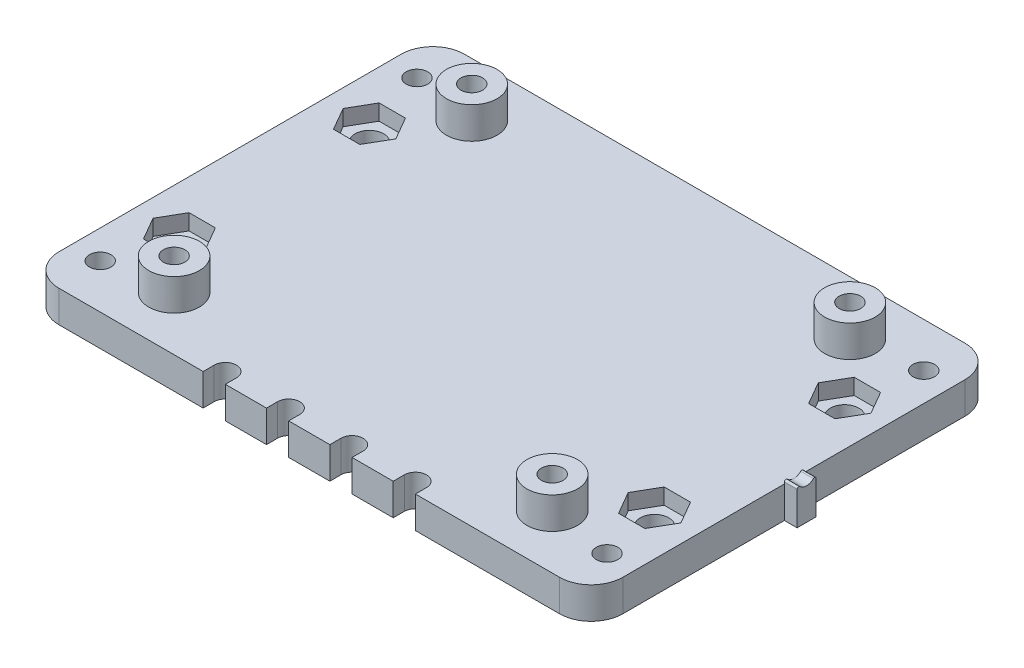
ISO-10303-21;
HEADER;
FILE_DESCRIPTION(('STEP AP214'),'2;1');
FILE_NAME('part.step','',(''),(''),'','','');
FILE_SCHEMA(('AUTOMOTIVE_DESIGN { 1 0 10303 214 1 1 1 1 }'));
ENDSEC;
DATA;
#1=APPLICATION_CONTEXT('core data for automotive mechanical design processes');
#2=APPLICATION_PROTOCOL_DEFINITION('international standard','automotive_design',2000,#1);
#3=PRODUCT_CONTEXT('',#1,'mechanical');
#4=PRODUCT('Part','Part','',(#3));
#5=PRODUCT_RELATED_PRODUCT_CATEGORY('part','',(#4));
#6=PRODUCT_DEFINITION_FORMATION('','',#4);
#7=PRODUCT_DEFINITION_CONTEXT('part definition',#1,'design');
#8=PRODUCT_DEFINITION('design','',#6,#7);
#9=PRODUCT_DEFINITION_SHAPE('','',#8);
#10=(LENGTH_UNIT() NAMED_UNIT(*) SI_UNIT(.MILLI.,.METRE.));
#11=(NAMED_UNIT(*) PLANE_ANGLE_UNIT() SI_UNIT($,.RADIAN.));
#12=(NAMED_UNIT(*) SI_UNIT($,.STERADIAN.) SOLID_ANGLE_UNIT());
#13=UNCERTAINTY_MEASURE_WITH_UNIT(LENGTH_MEASURE(1.E-05),#10,'distance_accuracy_value','');
#14=(GEOMETRIC_REPRESENTATION_CONTEXT(3) GLOBAL_UNCERTAINTY_ASSIGNED_CONTEXT((#13)) GLOBAL_UNIT_ASSIGNED_CONTEXT((#10,
#11,#12)) REPRESENTATION_CONTEXT('',''));
#15=CARTESIAN_POINT('',(0.,0.,0.));
#16=DIRECTION('',(0.,0.,1.));
#17=DIRECTION('',(1.,0.,0.));
#18=AXIS2_PLACEMENT_3D('',#15,#16,#17);
#19=CARTESIAN_POINT('',(44.5,5.,32.));
#20=DIRECTION('',(-1.,0.,0.));
#21=DIRECTION('',(0.,0.,1.));
#22=AXIS2_PLACEMENT_3D('',#19,#20,#21);
#23=PLANE('',#22);
#24=DIRECTION('',(0.,0.,-1.));
#25=VECTOR('',#24,1.);
#26=CARTESIAN_POINT('',(44.5,0.,32.));
#27=LINE('',#26,#25);
#28=CARTESIAN_POINT('',(44.5,0.,-1.5));
#29=VERTEX_POINT('',#28);
#30=CARTESIAN_POINT('',(44.5,0.,-27.));
#31=VERTEX_POINT('',#30);
#32=EDGE_CURVE('E1465',#29,#31,#27,.T.);
#33=ORIENTED_EDGE('',*,*,#32,.T.);
#34=DIRECTION('',(0.,-1.,0.));
#35=VECTOR('',#34,1.);
#36=CARTESIAN_POINT('',(44.5,5.,-27.));
#37=LINE('',#36,#35);
#38=CARTESIAN_POINT('',(44.5,5.,-27.));
#39=VERTEX_POINT('',#38);
#40=EDGE_CURVE('E11',#31,#39,#37,.F.);
#41=ORIENTED_EDGE('',*,*,#40,.T.);
#42=DIRECTION('',(0.,0.,-1.));
#43=VECTOR('',#42,1.);
#44=CARTESIAN_POINT('',(44.5,5.,32.));
#45=LINE('',#44,#43);
#46=CARTESIAN_POINT('',(44.5,5.,-1.5));
#47=VERTEX_POINT('',#46);
#48=EDGE_CURVE('E1470',#47,#39,#45,.T.);
#49=ORIENTED_EDGE('',*,*,#48,.F.);
#50=DIRECTION('',(0.,1.,0.));
#51=VECTOR('',#50,1.);
#52=CARTESIAN_POINT('',(44.5,0.,-1.5));
#53=LINE('',#52,#51);
#54=EDGE_CURVE('E715',#29,#47,#53,.T.);
#55=ORIENTED_EDGE('',*,*,#54,.F.);
#56=EDGE_LOOP('',(#33,#41,#49,#55));
#57=FACE_BOUND('',#56,.T.);
#58=ADVANCED_FACE('F34',(#57),#23,.F.);
#59=CARTESIAN_POINT('',(44.5,5.,27.));
#60=VERTEX_POINT('',#59);
#61=CARTESIAN_POINT('',(44.5,5.,1.5));
#62=VERTEX_POINT('',#61);
#63=EDGE_CURVE('E1466',#60,#62,#45,.T.);
#64=ORIENTED_EDGE('',*,*,#63,.F.);
#65=DIRECTION('',(0.,-1.,0.));
#66=VECTOR('',#65,1.);
#67=CARTESIAN_POINT('',(44.5,5.,27.));
#68=LINE('',#67,#66);
#69=CARTESIAN_POINT('',(44.5,0.,27.));
#70=VERTEX_POINT('',#69);
#71=EDGE_CURVE('E1559',#60,#70,#68,.T.);
#72=ORIENTED_EDGE('',*,*,#71,.T.);
#73=CARTESIAN_POINT('',(44.5,0.,1.5));
#74=VERTEX_POINT('',#73);
#75=EDGE_CURVE('E1480',#70,#74,#27,.T.);
#76=ORIENTED_EDGE('',*,*,#75,.T.);
#77=DIRECTION('',(0.,-1.,0.));
#78=VECTOR('',#77,1.);
#79=CARTESIAN_POINT('',(44.5,6.5,1.5));
#80=LINE('',#79,#78);
#81=EDGE_CURVE('E693',#62,#74,#80,.T.);
#82=ORIENTED_EDGE('',*,*,#81,.F.);
#83=EDGE_LOOP('',(#64,#72,#76,#82));
#84=FACE_BOUND('',#83,.T.);
#85=ADVANCED_FACE('F1632',(#84),#23,.F.);
#86=CARTESIAN_POINT('',(-29.845,10.,23.495));
#87=DIRECTION('',(0.,1.,0.));
#88=DIRECTION('',(0.,0.,1.));
#89=AXIS2_PLACEMENT_3D('',#86,#87,#88);
#90=CYLINDRICAL_SURFACE('',#89,1.69999999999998);
#91=CARTESIAN_POINT('',(-29.845,10.,23.495));
#92=DIRECTION('',(0.,1.,0.));
#93=DIRECTION('',(0.,0.,1.));
#94=AXIS2_PLACEMENT_3D('',#91,#92,#93);
#95=CIRCLE('',#94,1.69999999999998);
#96=CARTESIAN_POINT('',(-29.845,10.,25.195));
#97=VERTEX_POINT('',#96);
#98=EDGE_CURVE('E1129',#97,#97,#95,.T.);
#99=ORIENTED_EDGE('',*,*,#98,.T.);
#100=EDGE_LOOP('',(#99));
#101=FACE_BOUND('',#100,.T.);
#102=CARTESIAN_POINT('',(-29.845,2.5,23.495));
#103=DIRECTION('',(0.,-1.,0.));
#104=DIRECTION('',(0.,0.,-1.));
#105=AXIS2_PLACEMENT_3D('',#102,#103,#104);
#106=CIRCLE('',#105,1.69999999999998);
#107=CARTESIAN_POINT('',(-29.845,2.5,21.795));
#108=VERTEX_POINT('',#107);
#109=EDGE_CURVE('E1123',#108,#108,#106,.F.);
#110=ORIENTED_EDGE('',*,*,#109,.F.);
#111=EDGE_LOOP('',(#110));
#112=FACE_BOUND('',#111,.T.);
#113=ADVANCED_FACE('F1675',(#101,#112),#90,.F.);
#114=CARTESIAN_POINT('',(29.845,10.,23.495));
#115=DIRECTION('',(0.,1.,0.));
#116=DIRECTION('',(0.,0.,1.));
#117=AXIS2_PLACEMENT_3D('',#114,#115,#116);
#118=CYLINDRICAL_SURFACE('',#117,1.69999999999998);
#119=CARTESIAN_POINT('',(29.845,10.,23.495));
#120=DIRECTION('',(0.,1.,0.));
#121=DIRECTION('',(0.,0.,1.));
#122=AXIS2_PLACEMENT_3D('',#119,#120,#121);
#123=CIRCLE('',#122,1.69999999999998);
#124=CARTESIAN_POINT('',(29.845,10.,25.195));
#125=VERTEX_POINT('',#124);
#126=EDGE_CURVE('E1126',#125,#125,#123,.T.);
#127=ORIENTED_EDGE('',*,*,#126,.T.);
#128=EDGE_LOOP('',(#127));
#129=FACE_BOUND('',#128,.T.);
#130=CARTESIAN_POINT('',(29.845,2.5,23.495));
#131=DIRECTION('',(0.,-1.,0.));
#132=DIRECTION('',(0.,0.,-1.));
#133=AXIS2_PLACEMENT_3D('',#130,#131,#132);
#134=CIRCLE('',#133,1.69999999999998);
#135=CARTESIAN_POINT('',(29.845,2.5,21.795));
#136=VERTEX_POINT('',#135);
#137=EDGE_CURVE('E1507',#136,#136,#134,.F.);
#138=ORIENTED_EDGE('',*,*,#137,.F.);
#139=EDGE_LOOP('',(#138));
#140=FACE_BOUND('',#139,.T.);
#141=ADVANCED_FACE('F2449',(#129,#140),#118,.F.);
#142=CARTESIAN_POINT('',(29.845,10.,-23.495));
#143=DIRECTION('',(0.,1.,0.));
#144=DIRECTION('',(0.,0.,1.));
#145=AXIS2_PLACEMENT_3D('',#142,#143,#144);
#146=CYLINDRICAL_SURFACE('',#145,1.69999999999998);
#147=CARTESIAN_POINT('',(29.845,10.,-23.495));
#148=DIRECTION('',(0.,1.,0.));
#149=DIRECTION('',(0.,0.,1.));
#150=AXIS2_PLACEMENT_3D('',#147,#148,#149);
#151=CIRCLE('',#150,1.69999999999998);
#152=CARTESIAN_POINT('',(29.845,10.,-21.795));
#153=VERTEX_POINT('',#152);
#154=EDGE_CURVE('E1122',#153,#153,#151,.T.);
#155=ORIENTED_EDGE('',*,*,#154,.T.);
#156=EDGE_LOOP('',(#155));
#157=FACE_BOUND('',#156,.T.);
#158=CARTESIAN_POINT('',(29.845,2.5,-23.495));
#159=DIRECTION('',(0.,-1.,0.));
#160=DIRECTION('',(0.,0.,-1.));
#161=AXIS2_PLACEMENT_3D('',#158,#159,#160);
#162=CIRCLE('',#161,1.69999999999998);
#163=CARTESIAN_POINT('',(29.845,2.5,-25.195));
#164=VERTEX_POINT('',#163);
#165=EDGE_CURVE('E1504',#164,#164,#162,.F.);
#166=ORIENTED_EDGE('',*,*,#165,.F.);
#167=EDGE_LOOP('',(#166));
#168=FACE_BOUND('',#167,.T.);
#169=ADVANCED_FACE('F2437',(#157,#168),#146,.F.);
#170=CARTESIAN_POINT('',(-29.845,10.,-23.495));
#171=DIRECTION('',(0.,1.,0.));
#172=DIRECTION('',(0.,0.,1.));
#173=AXIS2_PLACEMENT_3D('',#170,#171,#172);
#174=CYLINDRICAL_SURFACE('',#173,1.69999999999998);
#175=CARTESIAN_POINT('',(-29.845,10.,-23.495));
#176=DIRECTION('',(0.,1.,0.));
#177=DIRECTION('',(0.,0.,1.));
#178=AXIS2_PLACEMENT_3D('',#175,#176,#177);
#179=CIRCLE('',#178,1.69999999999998);
#180=CARTESIAN_POINT('',(-29.845,10.,-21.795));
#181=VERTEX_POINT('',#180);
#182=EDGE_CURVE('E1119',#181,#181,#179,.T.);
#183=ORIENTED_EDGE('',*,*,#182,.T.);
#184=EDGE_LOOP('',(#183));
#185=FACE_BOUND('',#184,.T.);
#186=CARTESIAN_POINT('',(-29.845,2.5,-23.495));
#187=DIRECTION('',(0.,-1.,0.));
#188=DIRECTION('',(0.,0.,-1.));
#189=AXIS2_PLACEMENT_3D('',#186,#187,#188);
#190=CIRCLE('',#189,1.69999999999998);
#191=CARTESIAN_POINT('',(-29.845,2.5,-25.195));
#192=VERTEX_POINT('',#191);
#193=EDGE_CURVE('E1108',#192,#192,#190,.F.);
#194=ORIENTED_EDGE('',*,*,#193,.F.);
#195=EDGE_LOOP('',(#194));
#196=FACE_BOUND('',#195,.T.);
#197=ADVANCED_FACE('F2432',(#185,#196),#174,.F.);
#198=CARTESIAN_POINT('',(-44.5,5.,32.));
#199=DIRECTION('',(0.,0.,-1.));
#200=DIRECTION('',(-1.,0.,0.));
#201=AXIS2_PLACEMENT_3D('',#198,#199,#200);
#202=PLANE('',#201);
#203=DIRECTION('',(1.,0.,0.));
#204=VECTOR('',#203,1.);
#205=CARTESIAN_POINT('',(-44.5,5.,32.));
#206=LINE('',#205,#204);
#207=CARTESIAN_POINT('',(-13.25,5.,32.));
#208=VERTEX_POINT('',#207);
#209=CARTESIAN_POINT('',(-6.75000000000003,5.,32.));
#210=VERTEX_POINT('',#209);
#211=EDGE_CURVE('E1479',#208,#210,#206,.T.);
#212=ORIENTED_EDGE('',*,*,#211,.F.);
#213=DIRECTION('',(0.,1.,0.));
#214=VECTOR('',#213,1.);
#215=CARTESIAN_POINT('',(-13.25,0.,32.));
#216=LINE('',#215,#214);
#217=CARTESIAN_POINT('',(-13.25,0.,32.));
#218=VERTEX_POINT('',#217);
#219=EDGE_CURVE('E1372',#218,#208,#216,.T.);
#220=ORIENTED_EDGE('',*,*,#219,.F.);
#221=DIRECTION('',(1.,0.,0.));
#222=VECTOR('',#221,1.);
#223=CARTESIAN_POINT('',(-44.5,0.,32.));
#224=LINE('',#223,#222);
#225=CARTESIAN_POINT('',(-6.75000000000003,0.,32.));
#226=VERTEX_POINT('',#225);
#227=EDGE_CURVE('E1490',#218,#226,#224,.T.);
#228=ORIENTED_EDGE('',*,*,#227,.T.);
#229=DIRECTION('',(0.,1.,0.));
#230=VECTOR('',#229,1.);
#231=CARTESIAN_POINT('',(-6.75000000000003,0.,32.));
#232=LINE('',#231,#230);
#233=EDGE_CURVE('E1400',#226,#210,#232,.T.);
#234=ORIENTED_EDGE('',*,*,#233,.T.);
#235=EDGE_LOOP('',(#212,#220,#228,#234));
#236=FACE_BOUND('',#235,.T.);
#237=ADVANCED_FACE('F1604',(#236),#202,.F.);
#238=CARTESIAN_POINT('',(-3.25000000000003,5.,32.));
#239=VERTEX_POINT('',#238);
#240=CARTESIAN_POINT('',(3.24999999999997,5.,32.));
#241=VERTEX_POINT('',#240);
#242=EDGE_CURVE('E3021',#239,#241,#206,.T.);
#243=ORIENTED_EDGE('',*,*,#242,.F.);
#244=DIRECTION('',(0.,1.,0.));
#245=VECTOR('',#244,1.);
#246=CARTESIAN_POINT('',(-3.25000000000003,0.,32.));
#247=LINE('',#246,#245);
#248=CARTESIAN_POINT('',(-3.25000000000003,0.,32.));
#249=VERTEX_POINT('',#248);
#250=EDGE_CURVE('E1398',#249,#239,#247,.T.);
#251=ORIENTED_EDGE('',*,*,#250,.F.);
#252=CARTESIAN_POINT('',(3.24999999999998,0.,32.));
#253=VERTEX_POINT('',#252);
#254=EDGE_CURVE('E1606',#249,#253,#224,.T.);
#255=ORIENTED_EDGE('',*,*,#254,.T.);
#256=DIRECTION('',(0.,1.,0.));
#257=VECTOR('',#256,1.);
#258=CARTESIAN_POINT('',(3.24999999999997,0.,32.));
#259=LINE('',#258,#257);
#260=EDGE_CURVE('E1426',#253,#241,#259,.T.);
#261=ORIENTED_EDGE('',*,*,#260,.T.);
#262=EDGE_LOOP('',(#243,#251,#255,#261));
#263=FACE_BOUND('',#262,.T.);
#264=ADVANCED_FACE('F2954',(#263),#202,.F.);
#265=CARTESIAN_POINT('',(6.74999999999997,5.,32.));
#266=VERTEX_POINT('',#265);
#267=CARTESIAN_POINT('',(13.25,5.,32.));
#268=VERTEX_POINT('',#267);
#269=EDGE_CURVE('E3024',#266,#268,#206,.T.);
#270=ORIENTED_EDGE('',*,*,#269,.F.);
#271=DIRECTION('',(0.,1.,0.));
#272=VECTOR('',#271,1.);
#273=CARTESIAN_POINT('',(6.74999999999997,0.,32.));
#274=LINE('',#273,#272);
#275=CARTESIAN_POINT('',(6.74999999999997,0.,32.));
#276=VERTEX_POINT('',#275);
#277=EDGE_CURVE('E1424',#276,#266,#274,.T.);
#278=ORIENTED_EDGE('',*,*,#277,.F.);
#279=CARTESIAN_POINT('',(13.25,0.,32.));
#280=VERTEX_POINT('',#279);
#281=EDGE_CURVE('E1608',#276,#280,#224,.T.);
#282=ORIENTED_EDGE('',*,*,#281,.T.);
#283=DIRECTION('',(0.,1.,0.));
#284=VECTOR('',#283,1.);
#285=CARTESIAN_POINT('',(13.25,0.,32.));
#286=LINE('',#285,#284);
#287=EDGE_CURVE('E1450',#280,#268,#286,.T.);
#288=ORIENTED_EDGE('',*,*,#287,.T.);
#289=EDGE_LOOP('',(#270,#278,#282,#288));
#290=FACE_BOUND('',#289,.T.);
#291=ADVANCED_FACE('F1765',(#290),#202,.F.);
#292=CARTESIAN_POINT('',(16.75,0.,32.));
#293=VERTEX_POINT('',#292);
#294=CARTESIAN_POINT('',(39.5,0.,32.));
#295=VERTEX_POINT('',#294);
#296=EDGE_CURVE('E1487',#293,#295,#224,.T.);
#297=ORIENTED_EDGE('',*,*,#296,.T.);
#298=DIRECTION('',(0.,-1.,0.));
#299=VECTOR('',#298,1.);
#300=CARTESIAN_POINT('',(39.5,5.,32.));
#301=LINE('',#300,#299);
#302=CARTESIAN_POINT('',(39.5,5.,32.));
#303=VERTEX_POINT('',#302);
#304=EDGE_CURVE('E1562',#295,#303,#301,.F.);
#305=ORIENTED_EDGE('',*,*,#304,.T.);
#306=CARTESIAN_POINT('',(16.75,5.,32.));
#307=VERTEX_POINT('',#306);
#308=EDGE_CURVE('E1475',#307,#303,#206,.T.);
#309=ORIENTED_EDGE('',*,*,#308,.F.);
#310=DIRECTION('',(0.,1.,0.));
#311=VECTOR('',#310,1.);
#312=CARTESIAN_POINT('',(16.75,0.,32.));
#313=LINE('',#312,#311);
#314=EDGE_CURVE('E1448',#293,#307,#313,.T.);
#315=ORIENTED_EDGE('',*,*,#314,.F.);
#316=EDGE_LOOP('',(#297,#305,#309,#315));
#317=FACE_BOUND('',#316,.T.);
#318=ADVANCED_FACE('F1621',(#317),#202,.F.);
#319=CARTESIAN_POINT('',(-44.5,5.,-32.));
#320=DIRECTION('',(0.,0.,1.));
#321=DIRECTION('',(1.,0.,0.));
#322=AXIS2_PLACEMENT_3D('',#319,#320,#321);
#323=PLANE('',#322);
#324=DIRECTION('',(-1.,0.,0.));
#325=VECTOR('',#324,1.);
#326=CARTESIAN_POINT('',(-44.5,5.,-32.));
#327=LINE('',#326,#325);
#328=CARTESIAN_POINT('',(39.5,5.,-32.));
#329=VERTEX_POINT('',#328);
#330=CARTESIAN_POINT('',(-39.5,5.,-32.));
#331=VERTEX_POINT('',#330);
#332=EDGE_CURVE('E1468',#329,#331,#327,.T.);
#333=ORIENTED_EDGE('',*,*,#332,.F.);
#334=DIRECTION('',(0.,-1.,0.));
#335=VECTOR('',#334,1.);
#336=CARTESIAN_POINT('',(39.5,5.,-32.));
#337=LINE('',#336,#335);
#338=CARTESIAN_POINT('',(39.5,0.,-32.));
#339=VERTEX_POINT('',#338);
#340=EDGE_CURVE('E42',#329,#339,#337,.T.);
#341=ORIENTED_EDGE('',*,*,#340,.T.);
#342=DIRECTION('',(-1.,0.,0.));
#343=VECTOR('',#342,1.);
#344=CARTESIAN_POINT('',(-44.5,0.,-32.));
#345=LINE('',#344,#343);
#346=CARTESIAN_POINT('',(-39.5,0.,-32.));
#347=VERTEX_POINT('',#346);
#348=EDGE_CURVE('E1482',#339,#347,#345,.T.);
#349=ORIENTED_EDGE('',*,*,#348,.T.);
#350=DIRECTION('',(0.,-1.,0.));
#351=VECTOR('',#350,1.);
#352=CARTESIAN_POINT('',(-39.5,5.,-32.));
#353=LINE('',#352,#351);
#354=EDGE_CURVE('E49',#347,#331,#353,.F.);
#355=ORIENTED_EDGE('',*,*,#354,.T.);
#356=EDGE_LOOP('',(#333,#341,#349,#355));
#357=FACE_BOUND('',#356,.T.);
#358=ADVANCED_FACE('F1567',(#357),#323,.F.);
#359=CARTESIAN_POINT('',(-44.5,5.,32.));
#360=DIRECTION('',(1.,0.,0.));
#361=DIRECTION('',(0.,0.,-1.));
#362=AXIS2_PLACEMENT_3D('',#359,#360,#361);
#363=PLANE('',#362);
#364=DIRECTION('',(0.,0.,1.));
#365=VECTOR('',#364,1.);
#366=CARTESIAN_POINT('',(-44.5,0.,32.));
#367=LINE('',#366,#365);
#368=CARTESIAN_POINT('',(-44.5,0.,-27.));
#369=VERTEX_POINT('',#368);
#370=CARTESIAN_POINT('',(-44.5,0.,27.));
#371=VERTEX_POINT('',#370);
#372=EDGE_CURVE('E1484',#369,#371,#367,.T.);
#373=ORIENTED_EDGE('',*,*,#372,.T.);
#374=DIRECTION('',(0.,-1.,0.));
#375=VECTOR('',#374,1.);
#376=CARTESIAN_POINT('',(-44.5,5.,27.));
#377=LINE('',#376,#375);
#378=CARTESIAN_POINT('',(-44.5,5.,27.));
#379=VERTEX_POINT('',#378);
#380=EDGE_CURVE('E1550',#371,#379,#377,.F.);
#381=ORIENTED_EDGE('',*,*,#380,.T.);
#382=DIRECTION('',(0.,0.,1.));
#383=VECTOR('',#382,1.);
#384=CARTESIAN_POINT('',(-44.5,5.,32.));
#385=LINE('',#384,#383);
#386=CARTESIAN_POINT('',(-44.5,5.,-27.));
#387=VERTEX_POINT('',#386);
#388=EDGE_CURVE('E1472',#387,#379,#385,.T.);
#389=ORIENTED_EDGE('',*,*,#388,.F.);
#390=DIRECTION('',(0.,-1.,0.));
#391=VECTOR('',#390,1.);
#392=CARTESIAN_POINT('',(-44.5,5.,-27.));
#393=LINE('',#392,#391);
#394=EDGE_CURVE('E1547',#387,#369,#393,.T.);
#395=ORIENTED_EDGE('',*,*,#394,.T.);
#396=EDGE_LOOP('',(#373,#381,#389,#395));
#397=FACE_BOUND('',#396,.T.);
#398=ADVANCED_FACE('F1576',(#397),#363,.F.);
#399=CARTESIAN_POINT('',(-39.5,5.,32.));
#400=VERTEX_POINT('',#399);
#401=CARTESIAN_POINT('',(-16.75,5.,32.));
#402=VERTEX_POINT('',#401);
#403=EDGE_CURVE('E1476',#400,#402,#206,.T.);
#404=ORIENTED_EDGE('',*,*,#403,.F.);
#405=DIRECTION('',(0.,-1.,0.));
#406=VECTOR('',#405,1.);
#407=CARTESIAN_POINT('',(-39.5,5.,32.));
#408=LINE('',#407,#406);
#409=CARTESIAN_POINT('',(-39.5,0.,32.));
#410=VERTEX_POINT('',#409);
#411=EDGE_CURVE('E1536',#400,#410,#408,.T.);
#412=ORIENTED_EDGE('',*,*,#411,.T.);
#413=CARTESIAN_POINT('',(-16.75,0.,32.));
#414=VERTEX_POINT('',#413);
#415=EDGE_CURVE('E1488',#410,#414,#224,.T.);
#416=ORIENTED_EDGE('',*,*,#415,.T.);
#417=DIRECTION('',(0.,1.,0.));
#418=VECTOR('',#417,1.);
#419=CARTESIAN_POINT('',(-16.75,0.,32.));
#420=LINE('',#419,#418);
#421=EDGE_CURVE('E1374',#414,#402,#420,.T.);
#422=ORIENTED_EDGE('',*,*,#421,.T.);
#423=EDGE_LOOP('',(#404,#412,#416,#422));
#424=FACE_BOUND('',#423,.T.);
#425=ADVANCED_FACE('F1585',(#424),#202,.F.);
#426=CARTESIAN_POINT('',(0.,5.,0.));
#427=DIRECTION('',(0.,-1.,0.));
#428=DIRECTION('',(0.,0.,-1.));
#429=AXIS2_PLACEMENT_3D('',#426,#427,#428);
#430=PLANE('',#429);
#431=CARTESIAN_POINT('',(-40.,5.,-25.));
#432=DIRECTION('',(0.,-1.,0.));
#433=DIRECTION('',(0.,0.,-1.));
#434=AXIS2_PLACEMENT_3D('',#431,#432,#433);
#435=CIRCLE('',#434,1.69999999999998);
#436=CARTESIAN_POINT('',(-40.,5.,-26.7));
#437=VERTEX_POINT('',#436);
#438=EDGE_CURVE('E696',#437,#437,#435,.T.);
#439=ORIENTED_EDGE('',*,*,#438,.T.);
#440=EDGE_LOOP('',(#439));
#441=FACE_BOUND('',#440,.T.);
#442=CARTESIAN_POINT('',(-40.,5.,25.));
#443=DIRECTION('',(0.,-1.,0.));
#444=DIRECTION('',(0.,0.,-1.));
#445=AXIS2_PLACEMENT_3D('',#442,#443,#444);
#446=CIRCLE('',#445,1.69999999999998);
#447=CARTESIAN_POINT('',(-40.,5.,23.3));
#448=VERTEX_POINT('',#447);
#449=EDGE_CURVE('E722',#448,#448,#446,.T.);
#450=ORIENTED_EDGE('',*,*,#449,.T.);
#451=EDGE_LOOP('',(#450));
#452=FACE_BOUND('',#451,.T.);
#453=CARTESIAN_POINT('',(40.,5.,25.));
#454=DIRECTION('',(0.,-1.,0.));
#455=DIRECTION('',(0.,0.,-1.));
#456=AXIS2_PLACEMENT_3D('',#453,#454,#455);
#457=CIRCLE('',#456,1.69999999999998);
#458=CARTESIAN_POINT('',(40.,5.,23.3));
#459=VERTEX_POINT('',#458);
#460=EDGE_CURVE('E727',#459,#459,#457,.T.);
#461=ORIENTED_EDGE('',*,*,#460,.T.);
#462=EDGE_LOOP('',(#461));
#463=FACE_BOUND('',#462,.T.);
#464=CARTESIAN_POINT('',(40.,5.,-25.));
#465=DIRECTION('',(0.,-1.,0.));
#466=DIRECTION('',(0.,0.,-1.));
#467=AXIS2_PLACEMENT_3D('',#464,#465,#466);
#468=CIRCLE('',#467,1.69999999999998);
#469=CARTESIAN_POINT('',(40.,5.,-26.7));
#470=VERTEX_POINT('',#469);
#471=EDGE_CURVE('E731',#470,#470,#468,.T.);
#472=ORIENTED_EDGE('',*,*,#471,.T.);
#473=EDGE_LOOP('',(#472));
#474=FACE_BOUND('',#473,.T.);
#475=DIRECTION('',(-0.500000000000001,0.,-0.866025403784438));
#476=VECTOR('',#475,1.);
#477=CARTESIAN_POINT('',(41.6569219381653,5.,-15.));
#478=LINE('',#477,#476);
#479=CARTESIAN_POINT('',(41.6569219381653,5.,-15.));
#480=VERTEX_POINT('',#479);
#481=CARTESIAN_POINT('',(39.5784609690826,5.,-18.6));
#482=VERTEX_POINT('',#481);
#483=EDGE_CURVE('E1276',#480,#482,#478,.T.);
#484=ORIENTED_EDGE('',*,*,#483,.F.);
#485=DIRECTION('',(0.5,0.,-0.866025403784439));
#486=VECTOR('',#485,1.);
#487=CARTESIAN_POINT('',(39.5784609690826,5.,-11.4));
#488=LINE('',#487,#486);
#489=CARTESIAN_POINT('',(39.5784609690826,5.,-11.4));
#490=VERTEX_POINT('',#489);
#491=EDGE_CURVE('E1156',#490,#480,#488,.T.);
#492=ORIENTED_EDGE('',*,*,#491,.F.);
#493=DIRECTION('',(1.,0.,0.));
#494=VECTOR('',#493,1.);
#495=CARTESIAN_POINT('',(35.4215390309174,5.,-11.4));
#496=LINE('',#495,#494);
#497=CARTESIAN_POINT('',(35.4215390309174,5.,-11.4));
#498=VERTEX_POINT('',#497);
#499=EDGE_CURVE('E1259',#498,#490,#496,.T.);
#500=ORIENTED_EDGE('',*,*,#499,.F.);
#501=DIRECTION('',(0.5,0.,0.866025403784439));
#502=VECTOR('',#501,1.);
#503=CARTESIAN_POINT('',(33.3430780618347,5.,-15.));
#504=LINE('',#503,#502);
#505=CARTESIAN_POINT('',(33.3430780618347,5.,-15.));
#506=VERTEX_POINT('',#505);
#507=EDGE_CURVE('E1285',#506,#498,#504,.T.);
#508=ORIENTED_EDGE('',*,*,#507,.F.);
#509=DIRECTION('',(-0.5,0.,0.866025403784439));
#510=VECTOR('',#509,1.);
#511=CARTESIAN_POINT('',(35.4215390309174,5.,-18.6));
#512=LINE('',#511,#510);
#513=CARTESIAN_POINT('',(35.4215390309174,5.,-18.6));
#514=VERTEX_POINT('',#513);
#515=EDGE_CURVE('E1282',#514,#506,#512,.T.);
#516=ORIENTED_EDGE('',*,*,#515,.F.);
#517=DIRECTION('',(-1.,0.,0.));
#518=VECTOR('',#517,1.);
#519=CARTESIAN_POINT('',(39.5784609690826,5.,-18.6));
#520=LINE('',#519,#518);
#521=EDGE_CURVE('E1279',#482,#514,#520,.T.);
#522=ORIENTED_EDGE('',*,*,#521,.F.);
#523=EDGE_LOOP('',(#484,#492,#500,#508,#516,#522));
#524=FACE_BOUND('',#523,.T.);
#525=DIRECTION('',(-0.500000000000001,0.,-0.866025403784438));
#526=VECTOR('',#525,1.);
#527=CARTESIAN_POINT('',(41.6569219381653,5.,15.));
#528=LINE('',#527,#526);
#529=CARTESIAN_POINT('',(41.6569219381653,5.,15.));
#530=VERTEX_POINT('',#529);
#531=CARTESIAN_POINT('',(39.5784609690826,5.,11.4));
#532=VERTEX_POINT('',#531);
#533=EDGE_CURVE('E1229',#530,#532,#528,.T.);
#534=ORIENTED_EDGE('',*,*,#533,.F.);
#535=DIRECTION('',(0.499999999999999,0.,-0.866025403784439));
#536=VECTOR('',#535,1.);
#537=CARTESIAN_POINT('',(39.5784609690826,5.,18.6));
#538=LINE('',#537,#536);
#539=CARTESIAN_POINT('',(39.5784609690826,5.,18.6));
#540=VERTEX_POINT('',#539);
#541=EDGE_CURVE('E1227',#540,#530,#538,.T.);
#542=ORIENTED_EDGE('',*,*,#541,.F.);
#543=DIRECTION('',(1.,0.,0.));
#544=VECTOR('',#543,1.);
#545=CARTESIAN_POINT('',(35.4215390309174,5.,18.6));
#546=LINE('',#545,#544);
#547=CARTESIAN_POINT('',(35.4215390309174,5.,18.6));
#548=VERTEX_POINT('',#547);
#549=EDGE_CURVE('E1211',#548,#540,#546,.T.);
#550=ORIENTED_EDGE('',*,*,#549,.F.);
#551=DIRECTION('',(0.5,0.,0.866025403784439));
#552=VECTOR('',#551,1.);
#553=CARTESIAN_POINT('',(33.3430780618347,5.,15.));
#554=LINE('',#553,#552);
#555=CARTESIAN_POINT('',(33.3430780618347,5.,15.));
#556=VERTEX_POINT('',#555);
#557=EDGE_CURVE('E1239',#556,#548,#554,.T.);
#558=ORIENTED_EDGE('',*,*,#557,.F.);
#559=DIRECTION('',(-0.499999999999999,0.,0.86602540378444));
#560=VECTOR('',#559,1.);
#561=CARTESIAN_POINT('',(35.4215390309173,5.,11.4));
#562=LINE('',#561,#560);
#563=CARTESIAN_POINT('',(35.4215390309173,5.,11.4));
#564=VERTEX_POINT('',#563);
#565=EDGE_CURVE('E1236',#564,#556,#562,.T.);
#566=ORIENTED_EDGE('',*,*,#565,.F.);
#567=DIRECTION('',(-1.,0.,0.));
#568=VECTOR('',#567,1.);
#569=CARTESIAN_POINT('',(39.5784609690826,5.,11.4));
#570=LINE('',#569,#568);
#571=EDGE_CURVE('E1233',#532,#564,#570,.T.);
#572=ORIENTED_EDGE('',*,*,#571,.F.);
#573=EDGE_LOOP('',(#534,#542,#550,#558,#566,#572));
#574=FACE_BOUND('',#573,.T.);
#575=DIRECTION('',(-0.500000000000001,0.,-0.866025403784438));
#576=VECTOR('',#575,1.);
#577=CARTESIAN_POINT('',(-33.3430780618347,5.,15.));
#578=LINE('',#577,#576);
#579=CARTESIAN_POINT('',(-33.3430780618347,5.,15.));
#580=VERTEX_POINT('',#579);
#581=CARTESIAN_POINT('',(-35.4215390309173,5.,11.4));
#582=VERTEX_POINT('',#581);
#583=EDGE_CURVE('E1179',#580,#582,#578,.T.);
#584=ORIENTED_EDGE('',*,*,#583,.F.);
#585=DIRECTION('',(0.5,0.,-0.866025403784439));
#586=VECTOR('',#585,1.);
#587=CARTESIAN_POINT('',(-35.4215390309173,5.,18.6));
#588=LINE('',#587,#586);
#589=CARTESIAN_POINT('',(-35.4215390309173,5.,18.6));
#590=VERTEX_POINT('',#589);
#591=EDGE_CURVE('E1177',#590,#580,#588,.T.);
#592=ORIENTED_EDGE('',*,*,#591,.F.);
#593=DIRECTION('',(1.,0.,0.));
#594=VECTOR('',#593,1.);
#595=CARTESIAN_POINT('',(-39.5784609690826,5.,18.6));
#596=LINE('',#595,#594);
#597=CARTESIAN_POINT('',(-39.5784609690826,5.,18.6));
#598=VERTEX_POINT('',#597);
#599=EDGE_CURVE('E1161',#598,#590,#596,.T.);
#600=ORIENTED_EDGE('',*,*,#599,.F.);
#601=DIRECTION('',(0.5,0.,0.866025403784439));
#602=VECTOR('',#601,1.);
#603=CARTESIAN_POINT('',(-41.6569219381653,5.,15.));
#604=LINE('',#603,#602);
#605=CARTESIAN_POINT('',(-41.6569219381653,5.,15.));
#606=VERTEX_POINT('',#605);
#607=EDGE_CURVE('E1189',#606,#598,#604,.T.);
#608=ORIENTED_EDGE('',*,*,#607,.F.);
#609=DIRECTION('',(-0.499999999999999,0.,0.866025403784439));
#610=VECTOR('',#609,1.);
#611=CARTESIAN_POINT('',(-39.5784609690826,5.,11.4));
#612=LINE('',#611,#610);
#613=CARTESIAN_POINT('',(-39.5784609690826,5.,11.4));
#614=VERTEX_POINT('',#613);
#615=EDGE_CURVE('E1186',#614,#606,#612,.T.);
#616=ORIENTED_EDGE('',*,*,#615,.F.);
#617=DIRECTION('',(-1.,0.,0.));
#618=VECTOR('',#617,1.);
#619=CARTESIAN_POINT('',(-35.4215390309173,5.,11.4));
#620=LINE('',#619,#618);
#621=EDGE_CURVE('E1183',#582,#614,#620,.T.);
#622=ORIENTED_EDGE('',*,*,#621,.F.);
#623=EDGE_LOOP('',(#584,#592,#600,#608,#616,#622));
#624=FACE_BOUND('',#623,.T.);
#625=DIRECTION('',(-0.5,0.,-0.866025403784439));
#626=VECTOR('',#625,1.);
#627=CARTESIAN_POINT('',(-33.3430780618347,5.,-15.));
#628=LINE('',#627,#626);
#629=CARTESIAN_POINT('',(-33.3430780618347,5.,-15.));
#630=VERTEX_POINT('',#629);
#631=CARTESIAN_POINT('',(-35.4215390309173,5.,-18.6));
#632=VERTEX_POINT('',#631);
#633=EDGE_CURVE('E1322',#630,#632,#628,.T.);
#634=ORIENTED_EDGE('',*,*,#633,.F.);
#635=DIRECTION('',(0.500000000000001,0.,-0.866025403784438));
#636=VECTOR('',#635,1.);
#637=CARTESIAN_POINT('',(-35.4215390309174,5.,-11.4));
#638=LINE('',#637,#636);
#639=CARTESIAN_POINT('',(-35.4215390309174,5.,-11.4));
#640=VERTEX_POINT('',#639);
#641=EDGE_CURVE('E1196',#640,#630,#638,.T.);
#642=ORIENTED_EDGE('',*,*,#641,.F.);
#643=DIRECTION('',(1.,0.,0.));
#644=VECTOR('',#643,1.);
#645=CARTESIAN_POINT('',(-39.5784609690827,5.,-11.4));
#646=LINE('',#645,#644);
#647=CARTESIAN_POINT('',(-39.5784609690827,5.,-11.4));
#648=VERTEX_POINT('',#647);
#649=EDGE_CURVE('E1305',#648,#640,#646,.T.);
#650=ORIENTED_EDGE('',*,*,#649,.F.);
#651=DIRECTION('',(0.5,0.,0.866025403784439));
#652=VECTOR('',#651,1.);
#653=CARTESIAN_POINT('',(-41.6569219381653,5.,-15.));
#654=LINE('',#653,#652);
#655=CARTESIAN_POINT('',(-41.6569219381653,5.,-15.));
#656=VERTEX_POINT('',#655);
#657=EDGE_CURVE('E1331',#656,#648,#654,.T.);
#658=ORIENTED_EDGE('',*,*,#657,.F.);
#659=DIRECTION('',(-0.500000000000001,0.,0.866025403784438));
#660=VECTOR('',#659,1.);
#661=CARTESIAN_POINT('',(-39.5784609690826,5.,-18.6));
#662=LINE('',#661,#660);
#663=CARTESIAN_POINT('',(-39.5784609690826,5.,-18.6));
#664=VERTEX_POINT('',#663);
#665=EDGE_CURVE('E1328',#664,#656,#662,.T.);
#666=ORIENTED_EDGE('',*,*,#665,.F.);
#667=DIRECTION('',(-1.,0.,0.));
#668=VECTOR('',#667,1.);
#669=CARTESIAN_POINT('',(-35.4215390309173,5.,-18.6));
#670=LINE('',#669,#668);
#671=EDGE_CURVE('E1325',#632,#664,#670,.T.);
#672=ORIENTED_EDGE('',*,*,#671,.F.);
#673=EDGE_LOOP('',(#634,#642,#650,#658,#666,#672));
#674=FACE_BOUND('',#673,.T.);
#675=CARTESIAN_POINT('',(29.845,5.,23.495));
#676=DIRECTION('',(0.,-1.,0.));
#677=DIRECTION('',(0.,0.,-1.));
#678=AXIS2_PLACEMENT_3D('',#675,#676,#677);
#679=CIRCLE('',#678,4.);
#680=CARTESIAN_POINT('',(29.845,5.,19.495));
#681=VERTEX_POINT('',#680);
#682=EDGE_CURVE('E1499',#681,#681,#679,.F.);
#683=ORIENTED_EDGE('',*,*,#682,.F.);
#684=EDGE_LOOP('',(#683));
#685=FACE_BOUND('',#684,.T.);
#686=CARTESIAN_POINT('',(-29.845,5.,23.495));
#687=DIRECTION('',(0.,-1.,0.));
#688=DIRECTION('',(0.,0.,-1.));
#689=AXIS2_PLACEMENT_3D('',#686,#687,#688);
#690=CIRCLE('',#689,4.);
#691=CARTESIAN_POINT('',(-29.845,5.,19.495));
#692=VERTEX_POINT('',#691);
#693=EDGE_CURVE('E1496',#692,#692,#690,.F.);
#694=ORIENTED_EDGE('',*,*,#693,.F.);
#695=EDGE_LOOP('',(#694));
#696=FACE_BOUND('',#695,.T.);
#697=CARTESIAN_POINT('',(29.845,5.,-23.495));
#698=DIRECTION('',(0.,-1.,0.));
#699=DIRECTION('',(0.,0.,-1.));
#700=AXIS2_PLACEMENT_3D('',#697,#698,#699);
#701=CIRCLE('',#700,4.);
#702=CARTESIAN_POINT('',(29.845,5.,-27.495));
#703=VERTEX_POINT('',#702);
#704=EDGE_CURVE('E1493',#703,#703,#701,.F.);
#705=ORIENTED_EDGE('',*,*,#704,.F.);
#706=EDGE_LOOP('',(#705));
#707=FACE_BOUND('',#706,.T.);
#708=CARTESIAN_POINT('',(-29.845,5.,-23.495));
#709=DIRECTION('',(0.,-1.,0.));
#710=DIRECTION('',(0.,0.,-1.));
#711=AXIS2_PLACEMENT_3D('',#708,#709,#710);
#712=CIRCLE('',#711,4.);
#713=CARTESIAN_POINT('',(-29.845,5.,-27.495));
#714=VERTEX_POINT('',#713);
#715=EDGE_CURVE('E1478',#714,#714,#712,.F.);
#716=ORIENTED_EDGE('',*,*,#715,.F.);
#717=EDGE_LOOP('',(#716));
#718=FACE_BOUND('',#717,.T.);
#719=ORIENTED_EDGE('',*,*,#388,.T.);
#720=CARTESIAN_POINT('',(-39.5,5.,27.));
#721=DIRECTION('',(0.,-1.,0.));
#722=DIRECTION('',(0.,0.,-1.));
#723=AXIS2_PLACEMENT_3D('',#720,#721,#722);
#724=CIRCLE('',#723,5.);
#725=EDGE_CURVE('E1557',#379,#400,#724,.F.);
#726=ORIENTED_EDGE('',*,*,#725,.T.);
#727=ORIENTED_EDGE('',*,*,#403,.T.);
#728=DIRECTION('',(0.,0.,1.));
#729=VECTOR('',#728,1.);
#730=CARTESIAN_POINT('',(-16.75,5.,30.25));
#731=LINE('',#730,#729);
#732=CARTESIAN_POINT('',(-16.75,5.,30.25));
#733=VERTEX_POINT('',#732);
#734=EDGE_CURVE('E1363',#733,#402,#731,.T.);
#735=ORIENTED_EDGE('',*,*,#734,.F.);
#736=CARTESIAN_POINT('',(-15.,5.,30.25));
#737=DIRECTION('',(0.,1.,0.));
#738=DIRECTION('',(0.,0.,1.));
#739=AXIS2_PLACEMENT_3D('',#736,#737,#738);
#740=CIRCLE('',#739,1.75);
#741=CARTESIAN_POINT('',(-13.25,5.,30.25));
#742=VERTEX_POINT('',#741);
#743=EDGE_CURVE('E1360',#742,#733,#740,.T.);
#744=ORIENTED_EDGE('',*,*,#743,.F.);
#745=DIRECTION('',(0.,0.,-1.));
#746=VECTOR('',#745,1.);
#747=CARTESIAN_POINT('',(-13.25,5.,32.));
#748=LINE('',#747,#746);
#749=EDGE_CURVE('E1353',#208,#742,#748,.T.);
#750=ORIENTED_EDGE('',*,*,#749,.F.);
#751=ORIENTED_EDGE('',*,*,#211,.T.);
#752=DIRECTION('',(0.,0.,1.));
#753=VECTOR('',#752,1.);
#754=CARTESIAN_POINT('',(-6.75000000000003,5.,30.25));
#755=LINE('',#754,#753);
#756=CARTESIAN_POINT('',(-6.75000000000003,5.,30.25));
#757=VERTEX_POINT('',#756);
#758=EDGE_CURVE('E1392',#757,#210,#755,.T.);
#759=ORIENTED_EDGE('',*,*,#758,.F.);
#760=CARTESIAN_POINT('',(-5.00000000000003,5.,30.25));
#761=DIRECTION('',(0.,1.,0.));
#762=DIRECTION('',(0.,0.,1.));
#763=AXIS2_PLACEMENT_3D('',#760,#761,#762);
#764=CIRCLE('',#763,1.75);
#765=CARTESIAN_POINT('',(-3.25000000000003,5.,30.25));
#766=VERTEX_POINT('',#765);
#767=EDGE_CURVE('E1389',#766,#757,#764,.T.);
#768=ORIENTED_EDGE('',*,*,#767,.F.);
#769=DIRECTION('',(0.,0.,-1.));
#770=VECTOR('',#769,1.);
#771=CARTESIAN_POINT('',(-3.25000000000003,5.,32.));
#772=LINE('',#771,#770);
#773=EDGE_CURVE('E1382',#239,#766,#772,.T.);
#774=ORIENTED_EDGE('',*,*,#773,.F.);
#775=ORIENTED_EDGE('',*,*,#242,.T.);
#776=DIRECTION('',(0.,0.,1.));
#777=VECTOR('',#776,1.);
#778=CARTESIAN_POINT('',(3.24999999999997,5.,30.25));
#779=LINE('',#778,#777);
#780=CARTESIAN_POINT('',(3.24999999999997,5.,30.25));
#781=VERTEX_POINT('',#780);
#782=EDGE_CURVE('E1418',#781,#241,#779,.T.);
#783=ORIENTED_EDGE('',*,*,#782,.F.);
#784=CARTESIAN_POINT('',(4.99999999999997,5.,30.25));
#785=DIRECTION('',(0.,1.,0.));
#786=DIRECTION('',(0.,0.,1.));
#787=AXIS2_PLACEMENT_3D('',#784,#785,#786);
#788=CIRCLE('',#787,1.75);
#789=CARTESIAN_POINT('',(6.74999999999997,5.,30.25));
#790=VERTEX_POINT('',#789);
#791=EDGE_CURVE('E1415',#790,#781,#788,.T.);
#792=ORIENTED_EDGE('',*,*,#791,.F.);
#793=DIRECTION('',(0.,0.,-1.));
#794=VECTOR('',#793,1.);
#795=CARTESIAN_POINT('',(6.74999999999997,5.,32.));
#796=LINE('',#795,#794);
#797=EDGE_CURVE('E1408',#266,#790,#796,.T.);
#798=ORIENTED_EDGE('',*,*,#797,.F.);
#799=ORIENTED_EDGE('',*,*,#269,.T.);
#800=DIRECTION('',(0.,0.,1.));
#801=VECTOR('',#800,1.);
#802=CARTESIAN_POINT('',(13.25,5.,30.25));
#803=LINE('',#802,#801);
#804=CARTESIAN_POINT('',(13.25,5.,30.25));
#805=VERTEX_POINT('',#804);
#806=EDGE_CURVE('E1443',#805,#268,#803,.T.);
#807=ORIENTED_EDGE('',*,*,#806,.F.);
#808=CARTESIAN_POINT('',(15.,5.,30.25));
#809=DIRECTION('',(0.,1.,0.));
#810=DIRECTION('',(0.,0.,1.));
#811=AXIS2_PLACEMENT_3D('',#808,#809,#810);
#812=CIRCLE('',#811,1.75);
#813=CARTESIAN_POINT('',(16.75,5.,30.25));
#814=VERTEX_POINT('',#813);
#815=EDGE_CURVE('E1338',#814,#805,#812,.T.);
#816=ORIENTED_EDGE('',*,*,#815,.F.);
#817=DIRECTION('',(0.,0.,-1.));
#818=VECTOR('',#817,1.);
#819=CARTESIAN_POINT('',(16.75,5.,32.));
#820=LINE('',#819,#818);
#821=EDGE_CURVE('E1434',#307,#814,#820,.T.);
#822=ORIENTED_EDGE('',*,*,#821,.F.);
#823=ORIENTED_EDGE('',*,*,#308,.T.);
#824=CARTESIAN_POINT('',(39.5,5.,27.));
#825=DIRECTION('',(0.,-1.,0.));
#826=DIRECTION('',(0.,0.,-1.));
#827=AXIS2_PLACEMENT_3D('',#824,#825,#826);
#828=CIRCLE('',#827,5.);
#829=EDGE_CURVE('E1555',#303,#60,#828,.F.);
#830=ORIENTED_EDGE('',*,*,#829,.T.);
#831=ORIENTED_EDGE('',*,*,#63,.T.);
#832=CARTESIAN_POINT('',(44.5,5.,0.));
#833=VERTEX_POINT('',#832);
#834=EDGE_CURVE('E1469',#62,#833,#45,.T.);
#835=ORIENTED_EDGE('',*,*,#834,.T.);
#836=EDGE_CURVE('E1641',#833,#47,#45,.T.);
#837=ORIENTED_EDGE('',*,*,#836,.T.);
#838=ORIENTED_EDGE('',*,*,#48,.T.);
#839=CARTESIAN_POINT('',(39.5,5.,-27.));
#840=DIRECTION('',(0.,-1.,0.));
#841=DIRECTION('',(0.,0.,-1.));
#842=AXIS2_PLACEMENT_3D('',#839,#840,#841);
#843=CIRCLE('',#842,5.);
#844=EDGE_CURVE('E56',#39,#329,#843,.F.);
#845=ORIENTED_EDGE('',*,*,#844,.T.);
#846=ORIENTED_EDGE('',*,*,#332,.T.);
#847=CARTESIAN_POINT('',(-39.5,5.,-27.));
#848=DIRECTION('',(0.,-1.,0.));
#849=DIRECTION('',(0.,0.,-1.));
#850=AXIS2_PLACEMENT_3D('',#847,#848,#849);
#851=CIRCLE('',#850,5.);
#852=EDGE_CURVE('E1552',#331,#387,#851,.F.);
#853=ORIENTED_EDGE('',*,*,#852,.T.);
#854=EDGE_LOOP('',(#719,#726,#727,#735,#744,#750,#751,#759,#768,#774,#775,#783,#792,#798,#799,
#807,#816,#822,#823,#830,#831,#835,#837,#838,#845,#846,#853));
#855=FACE_BOUND('',#854,.T.);
#856=ADVANCED_FACE('F1579',(#441,#452,#463,#474,#524,#574,#624,#674,#685,#696,#707,#718,#855),
#430,.F.);
#857=CARTESIAN_POINT('',(0.,0.,0.));
#858=DIRECTION('',(0.,-1.,0.));
#859=DIRECTION('',(0.,0.,-1.));
#860=AXIS2_PLACEMENT_3D('',#857,#858,#859);
#861=PLANE('',#860);
#862=DIRECTION('',(0.866025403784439,0.,-0.5));
#863=VECTOR('',#862,1.);
#864=CARTESIAN_POINT('',(-42.875,0.,-26.6598820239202));
#865=LINE('',#864,#863);
#866=CARTESIAN_POINT('',(-42.875,0.,-26.6598820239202));
#867=VERTEX_POINT('',#866);
#868=CARTESIAN_POINT('',(-40.,0.,-28.3197640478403));
#869=VERTEX_POINT('',#868);
#870=EDGE_CURVE('E734',#867,#869,#865,.T.);
#871=ORIENTED_EDGE('',*,*,#870,.F.);
#872=DIRECTION('',(0.,0.,-1.));
#873=VECTOR('',#872,1.);
#874=CARTESIAN_POINT('',(-42.875,0.,-23.3401179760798));
#875=LINE('',#874,#873);
#876=CARTESIAN_POINT('',(-42.875,0.,-23.3401179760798));
#877=VERTEX_POINT('',#876);
#878=EDGE_CURVE('E837',#877,#867,#875,.T.);
#879=ORIENTED_EDGE('',*,*,#878,.F.);
#880=DIRECTION('',(-0.866025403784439,0.,-0.5));
#881=VECTOR('',#880,1.);
#882=CARTESIAN_POINT('',(-40.,0.,-21.6802359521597));
#883=LINE('',#882,#881);
#884=CARTESIAN_POINT('',(-40.,0.,-21.6802359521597));
#885=VERTEX_POINT('',#884);
#886=EDGE_CURVE('E863',#885,#877,#883,.T.);
#887=ORIENTED_EDGE('',*,*,#886,.F.);
#888=DIRECTION('',(-0.866025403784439,0.,0.499999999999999));
#889=VECTOR('',#888,1.);
#890=CARTESIAN_POINT('',(-37.125,0.,-23.3401179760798));
#891=LINE('',#890,#889);
#892=CARTESIAN_POINT('',(-37.125,0.,-23.3401179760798));
#893=VERTEX_POINT('',#892);
#894=EDGE_CURVE('E860',#893,#885,#891,.T.);
#895=ORIENTED_EDGE('',*,*,#894,.F.);
#896=DIRECTION('',(0.,0.,1.));
#897=VECTOR('',#896,1.);
#898=CARTESIAN_POINT('',(-37.125,0.,-26.6598820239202));
#899=LINE('',#898,#897);
#900=CARTESIAN_POINT('',(-37.125,0.,-26.6598820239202));
#901=VERTEX_POINT('',#900);
#902=EDGE_CURVE('E857',#901,#893,#899,.T.);
#903=ORIENTED_EDGE('',*,*,#902,.F.);
#904=DIRECTION('',(0.866025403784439,0.,0.499999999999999));
#905=VECTOR('',#904,1.);
#906=CARTESIAN_POINT('',(-40.,0.,-28.3197640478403));
#907=LINE('',#906,#905);
#908=EDGE_CURVE('E854',#869,#901,#907,.T.);
#909=ORIENTED_EDGE('',*,*,#908,.F.);
#910=EDGE_LOOP('',(#871,#879,#887,#895,#903,#909));
#911=FACE_BOUND('',#910,.T.);
#912=DIRECTION('',(0.866025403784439,0.,-0.5));
#913=VECTOR('',#912,1.);
#914=CARTESIAN_POINT('',(-42.875,0.,23.3401179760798));
#915=LINE('',#914,#913);
#916=CARTESIAN_POINT('',(-42.875,0.,23.3401179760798));
#917=VERTEX_POINT('',#916);
#918=CARTESIAN_POINT('',(-40.,0.,21.6802359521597));
#919=VERTEX_POINT('',#918);
#920=EDGE_CURVE('E805',#917,#919,#915,.T.);
#921=ORIENTED_EDGE('',*,*,#920,.F.);
#922=DIRECTION('',(0.,0.,-1.));
#923=VECTOR('',#922,1.);
#924=CARTESIAN_POINT('',(-42.875,0.,26.6598820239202));
#925=LINE('',#924,#923);
#926=CARTESIAN_POINT('',(-42.875,0.,26.6598820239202));
#927=VERTEX_POINT('',#926);
#928=EDGE_CURVE('E789',#927,#917,#925,.T.);
#929=ORIENTED_EDGE('',*,*,#928,.F.);
#930=DIRECTION('',(-0.866025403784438,0.,-0.500000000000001));
#931=VECTOR('',#930,1.);
#932=CARTESIAN_POINT('',(-40.,0.,28.3197640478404));
#933=LINE('',#932,#931);
#934=CARTESIAN_POINT('',(-40.,0.,28.3197640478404));
#935=VERTEX_POINT('',#934);
#936=EDGE_CURVE('E817',#935,#927,#933,.T.);
#937=ORIENTED_EDGE('',*,*,#936,.F.);
#938=DIRECTION('',(-0.866025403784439,0.,0.5));
#939=VECTOR('',#938,1.);
#940=CARTESIAN_POINT('',(-37.125,0.,26.6598820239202));
#941=LINE('',#940,#939);
#942=CARTESIAN_POINT('',(-37.125,0.,26.6598820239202));
#943=VERTEX_POINT('',#942);
#944=EDGE_CURVE('E814',#943,#935,#941,.T.);
#945=ORIENTED_EDGE('',*,*,#944,.F.);
#946=DIRECTION('',(0.,0.,1.));
#947=VECTOR('',#946,1.);
#948=CARTESIAN_POINT('',(-37.125,0.,23.3401179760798));
#949=LINE('',#948,#947);
#950=CARTESIAN_POINT('',(-37.125,0.,23.3401179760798));
#951=VERTEX_POINT('',#950);
#952=EDGE_CURVE('E811',#951,#943,#949,.T.);
#953=ORIENTED_EDGE('',*,*,#952,.F.);
#954=DIRECTION('',(0.866025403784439,0.,0.499999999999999));
#955=VECTOR('',#954,1.);
#956=CARTESIAN_POINT('',(-40.,0.,21.6802359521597));
#957=LINE('',#956,#955);
#958=EDGE_CURVE('E807',#919,#951,#957,.T.);
#959=ORIENTED_EDGE('',*,*,#958,.F.);
#960=EDGE_LOOP('',(#921,#929,#937,#945,#953,#959));
#961=FACE_BOUND('',#960,.T.);
#962=DIRECTION('',(0.866025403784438,0.,-0.5));
#963=VECTOR('',#962,1.);
#964=CARTESIAN_POINT('',(37.125,0.,23.3401179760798));
#965=LINE('',#964,#963);
#966=CARTESIAN_POINT('',(37.125,0.,23.3401179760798));
#967=VERTEX_POINT('',#966);
#968=CARTESIAN_POINT('',(40.,0.,21.6802359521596));
#969=VERTEX_POINT('',#968);
#970=EDGE_CURVE('E755',#967,#969,#965,.T.);
#971=ORIENTED_EDGE('',*,*,#970,.F.);
#972=DIRECTION('',(0.,0.,-1.));
#973=VECTOR('',#972,1.);
#974=CARTESIAN_POINT('',(37.125,0.,26.6598820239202));
#975=LINE('',#974,#973);
#976=CARTESIAN_POINT('',(37.125,0.,26.6598820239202));
#977=VERTEX_POINT('',#976);
#978=EDGE_CURVE('E739',#977,#967,#975,.T.);
#979=ORIENTED_EDGE('',*,*,#978,.F.);
#980=DIRECTION('',(-0.866025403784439,0.,-0.499999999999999));
#981=VECTOR('',#980,1.);
#982=CARTESIAN_POINT('',(40.,0.,28.3197640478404));
#983=LINE('',#982,#981);
#984=CARTESIAN_POINT('',(40.,0.,28.3197640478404));
#985=VERTEX_POINT('',#984);
#986=EDGE_CURVE('E767',#985,#977,#983,.T.);
#987=ORIENTED_EDGE('',*,*,#986,.F.);
#988=DIRECTION('',(-0.866025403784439,0.,0.5));
#989=VECTOR('',#988,1.);
#990=CARTESIAN_POINT('',(42.875,0.,26.6598820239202));
#991=LINE('',#990,#989);
#992=CARTESIAN_POINT('',(42.875,0.,26.6598820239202));
#993=VERTEX_POINT('',#992);
#994=EDGE_CURVE('E764',#993,#985,#991,.T.);
#995=ORIENTED_EDGE('',*,*,#994,.F.);
#996=DIRECTION('',(0.,0.,1.));
#997=VECTOR('',#996,1.);
#998=CARTESIAN_POINT('',(42.875,0.,23.3401179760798));
#999=LINE('',#998,#997);
#1000=CARTESIAN_POINT('',(42.875,0.,23.3401179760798));
#1001=VERTEX_POINT('',#1000);
#1002=EDGE_CURVE('E761',#1001,#993,#999,.T.);
#1003=ORIENTED_EDGE('',*,*,#1002,.F.);
#1004=DIRECTION('',(0.866025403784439,0.,0.5));
#1005=VECTOR('',#1004,1.);
#1006=CARTESIAN_POINT('',(40.,0.,21.6802359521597));
#1007=LINE('',#1006,#1005);
#1008=EDGE_CURVE('E757',#969,#1001,#1007,.T.);
#1009=ORIENTED_EDGE('',*,*,#1008,.F.);
#1010=EDGE_LOOP('',(#971,#979,#987,#995,#1003,#1009));
#1011=FACE_BOUND('',#1010,.T.);
#1012=DIRECTION('',(0.866025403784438,0.,-0.5));
#1013=VECTOR('',#1012,1.);
#1014=CARTESIAN_POINT('',(37.125,0.,-26.6598820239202));
#1015=LINE('',#1014,#1013);
#1016=CARTESIAN_POINT('',(37.125,0.,-26.6598820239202));
#1017=VERTEX_POINT('',#1016);
#1018=CARTESIAN_POINT('',(40.,0.,-28.3197640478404));
#1019=VERTEX_POINT('',#1018);
#1020=EDGE_CURVE('E774',#1017,#1019,#1015,.T.);
#1021=ORIENTED_EDGE('',*,*,#1020,.F.);
#1022=DIRECTION('',(0.,0.,-1.));
#1023=VECTOR('',#1022,1.);
#1024=CARTESIAN_POINT('',(37.125,0.,-23.3401179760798));
#1025=LINE('',#1024,#1023);
#1026=CARTESIAN_POINT('',(37.125,0.,-23.3401179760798));
#1027=VERTEX_POINT('',#1026);
#1028=EDGE_CURVE('E883',#1027,#1017,#1025,.T.);
#1029=ORIENTED_EDGE('',*,*,#1028,.F.);
#1030=DIRECTION('',(-0.866025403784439,0.,-0.5));
#1031=VECTOR('',#1030,1.);
#1032=CARTESIAN_POINT('',(40.,0.,-21.6802359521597));
#1033=LINE('',#1032,#1031);
#1034=CARTESIAN_POINT('',(40.,0.,-21.6802359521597));
#1035=VERTEX_POINT('',#1034);
#1036=EDGE_CURVE('E909',#1035,#1027,#1033,.T.);
#1037=ORIENTED_EDGE('',*,*,#1036,.F.);
#1038=DIRECTION('',(-0.866025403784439,0.,0.5));
#1039=VECTOR('',#1038,1.);
#1040=CARTESIAN_POINT('',(42.875,0.,-23.3401179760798));
#1041=LINE('',#1040,#1039);
#1042=CARTESIAN_POINT('',(42.875,0.,-23.3401179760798));
#1043=VERTEX_POINT('',#1042);
#1044=EDGE_CURVE('E906',#1043,#1035,#1041,.T.);
#1045=ORIENTED_EDGE('',*,*,#1044,.F.);
#1046=DIRECTION('',(0.,0.,1.));
#1047=VECTOR('',#1046,1.);
#1048=CARTESIAN_POINT('',(42.875,0.,-26.6598820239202));
#1049=LINE('',#1048,#1047);
#1050=CARTESIAN_POINT('',(42.875,0.,-26.6598820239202));
#1051=VERTEX_POINT('',#1050);
#1052=EDGE_CURVE('E903',#1051,#1043,#1049,.T.);
#1053=ORIENTED_EDGE('',*,*,#1052,.F.);
#1054=DIRECTION('',(0.866025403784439,0.,0.499999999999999));
#1055=VECTOR('',#1054,1.);
#1056=CARTESIAN_POINT('',(40.,0.,-28.3197640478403));
#1057=LINE('',#1056,#1055);
#1058=EDGE_CURVE('E900',#1019,#1051,#1057,.T.);
#1059=ORIENTED_EDGE('',*,*,#1058,.F.);
#1060=EDGE_LOOP('',(#1021,#1029,#1037,#1045,#1053,#1059));
#1061=FACE_BOUND('',#1060,.T.);
#1062=DIRECTION('',(-0.499999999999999,0.,-0.866025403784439));
#1063=VECTOR('',#1062,1.);
#1064=CARTESIAN_POINT('',(28.1851179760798,0.,26.37));
#1065=LINE('',#1064,#1063);
#1066=CARTESIAN_POINT('',(28.1851179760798,0.,26.37));
#1067=VERTEX_POINT('',#1066);
#1068=CARTESIAN_POINT('',(26.5252359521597,0.,23.495));
#1069=VERTEX_POINT('',#1068);
#1070=EDGE_CURVE('E916',#1067,#1069,#1065,.T.);
#1071=ORIENTED_EDGE('',*,*,#1070,.F.);
#1072=DIRECTION('',(-1.,0.,0.));
#1073=VECTOR('',#1072,1.);
#1074=CARTESIAN_POINT('',(31.5048820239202,0.,26.37));
#1075=LINE('',#1074,#1073);
#1076=CARTESIAN_POINT('',(31.5048820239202,0.,26.37));
#1077=VERTEX_POINT('',#1076);
#1078=EDGE_CURVE('E1029',#1077,#1067,#1075,.T.);
#1079=ORIENTED_EDGE('',*,*,#1078,.F.);
#1080=DIRECTION('',(-0.5,0.,0.866025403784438));
#1081=VECTOR('',#1080,1.);
#1082=CARTESIAN_POINT('',(33.1647640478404,0.,23.495));
#1083=LINE('',#1082,#1081);
#1084=CARTESIAN_POINT('',(33.1647640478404,0.,23.495));
#1085=VERTEX_POINT('',#1084);
#1086=EDGE_CURVE('E1055',#1085,#1077,#1083,.T.);
#1087=ORIENTED_EDGE('',*,*,#1086,.F.);
#1088=DIRECTION('',(0.499999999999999,0.,0.866025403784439));
#1089=VECTOR('',#1088,1.);
#1090=CARTESIAN_POINT('',(31.5048820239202,0.,20.62));
#1091=LINE('',#1090,#1089);
#1092=CARTESIAN_POINT('',(31.5048820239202,0.,20.62));
#1093=VERTEX_POINT('',#1092);
#1094=EDGE_CURVE('E1052',#1093,#1085,#1091,.T.);
#1095=ORIENTED_EDGE('',*,*,#1094,.F.);
#1096=DIRECTION('',(1.,0.,0.));
#1097=VECTOR('',#1096,1.);
#1098=CARTESIAN_POINT('',(28.1851179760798,0.,20.62));
#1099=LINE('',#1098,#1097);
#1100=CARTESIAN_POINT('',(28.1851179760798,0.,20.62));
#1101=VERTEX_POINT('',#1100);
#1102=EDGE_CURVE('E1049',#1101,#1093,#1099,.T.);
#1103=ORIENTED_EDGE('',*,*,#1102,.F.);
#1104=DIRECTION('',(0.5,0.,-0.866025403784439));
#1105=VECTOR('',#1104,1.);
#1106=CARTESIAN_POINT('',(26.5252359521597,0.,23.495));
#1107=LINE('',#1106,#1105);
#1108=EDGE_CURVE('E1046',#1069,#1101,#1107,.T.);
#1109=ORIENTED_EDGE('',*,*,#1108,.F.);
#1110=EDGE_LOOP('',(#1071,#1079,#1087,#1095,#1103,#1109));
#1111=FACE_BOUND('',#1110,.T.);
#1112=DIRECTION('',(-0.499999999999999,0.,-0.866025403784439));
#1113=VECTOR('',#1112,1.);
#1114=CARTESIAN_POINT('',(-31.5048820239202,0.,26.37));
#1115=LINE('',#1114,#1113);
#1116=CARTESIAN_POINT('',(-31.5048820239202,0.,26.37));
#1117=VERTEX_POINT('',#1116);
#1118=CARTESIAN_POINT('',(-33.1647640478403,0.,23.495));
#1119=VERTEX_POINT('',#1118);
#1120=EDGE_CURVE('E997',#1117,#1119,#1115,.T.);
#1121=ORIENTED_EDGE('',*,*,#1120,.F.);
#1122=DIRECTION('',(-1.,0.,0.));
#1123=VECTOR('',#1122,1.);
#1124=CARTESIAN_POINT('',(-28.1851179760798,0.,26.37));
#1125=LINE('',#1124,#1123);
#1126=CARTESIAN_POINT('',(-28.1851179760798,0.,26.37));
#1127=VERTEX_POINT('',#1126);
#1128=EDGE_CURVE('E981',#1127,#1117,#1125,.T.);
#1129=ORIENTED_EDGE('',*,*,#1128,.F.);
#1130=DIRECTION('',(-0.5,0.,0.866025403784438));
#1131=VECTOR('',#1130,1.);
#1132=CARTESIAN_POINT('',(-26.5252359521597,0.,23.495));
#1133=LINE('',#1132,#1131);
#1134=CARTESIAN_POINT('',(-26.5252359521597,0.,23.495));
#1135=VERTEX_POINT('',#1134);
#1136=EDGE_CURVE('E1009',#1135,#1127,#1133,.T.);
#1137=ORIENTED_EDGE('',*,*,#1136,.F.);
#1138=DIRECTION('',(0.5,0.,0.866025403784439));
#1139=VECTOR('',#1138,1.);
#1140=CARTESIAN_POINT('',(-28.1851179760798,0.,20.62));
#1141=LINE('',#1140,#1139);
#1142=CARTESIAN_POINT('',(-28.1851179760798,0.,20.62));
#1143=VERTEX_POINT('',#1142);
#1144=EDGE_CURVE('E1006',#1143,#1135,#1141,.T.);
#1145=ORIENTED_EDGE('',*,*,#1144,.F.);
#1146=DIRECTION('',(1.,0.,0.));
#1147=VECTOR('',#1146,1.);
#1148=CARTESIAN_POINT('',(-31.5048820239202,0.,20.62));
#1149=LINE('',#1148,#1147);
#1150=CARTESIAN_POINT('',(-31.5048820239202,0.,20.62));
#1151=VERTEX_POINT('',#1150);
#1152=EDGE_CURVE('E1003',#1151,#1143,#1149,.T.);
#1153=ORIENTED_EDGE('',*,*,#1152,.F.);
#1154=DIRECTION('',(0.5,0.,-0.866025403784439));
#1155=VECTOR('',#1154,1.);
#1156=CARTESIAN_POINT('',(-33.1647640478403,0.,23.495));
#1157=LINE('',#1156,#1155);
#1158=EDGE_CURVE('E999',#1119,#1151,#1157,.T.);
#1159=ORIENTED_EDGE('',*,*,#1158,.F.);
#1160=EDGE_LOOP('',(#1121,#1129,#1137,#1145,#1153,#1159));
#1161=FACE_BOUND('',#1160,.T.);
#1162=DIRECTION('',(-0.499999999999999,0.,-0.866025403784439));
#1163=VECTOR('',#1162,1.);
#1164=CARTESIAN_POINT('',(-31.5048820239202,0.,-20.62));
#1165=LINE('',#1164,#1163);
#1166=CARTESIAN_POINT('',(-31.5048820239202,0.,-20.62));
#1167=VERTEX_POINT('',#1166);
#1168=CARTESIAN_POINT('',(-33.1647640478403,0.,-23.495));
#1169=VERTEX_POINT('',#1168);
#1170=EDGE_CURVE('E947',#1167,#1169,#1165,.T.);
#1171=ORIENTED_EDGE('',*,*,#1170,.F.);
#1172=DIRECTION('',(-1.,0.,0.));
#1173=VECTOR('',#1172,1.);
#1174=CARTESIAN_POINT('',(-28.1851179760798,0.,-20.62));
#1175=LINE('',#1174,#1173);
#1176=CARTESIAN_POINT('',(-28.1851179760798,0.,-20.62));
#1177=VERTEX_POINT('',#1176);
#1178=EDGE_CURVE('E931',#1177,#1167,#1175,.T.);
#1179=ORIENTED_EDGE('',*,*,#1178,.F.);
#1180=DIRECTION('',(-0.500000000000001,0.,0.866025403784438));
#1181=VECTOR('',#1180,1.);
#1182=CARTESIAN_POINT('',(-26.5252359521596,0.,-23.495));
#1183=LINE('',#1182,#1181);
#1184=CARTESIAN_POINT('',(-26.5252359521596,0.,-23.495));
#1185=VERTEX_POINT('',#1184);
#1186=EDGE_CURVE('E959',#1185,#1177,#1183,.T.);
#1187=ORIENTED_EDGE('',*,*,#1186,.F.);
#1188=DIRECTION('',(0.5,0.,0.866025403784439));
#1189=VECTOR('',#1188,1.);
#1190=CARTESIAN_POINT('',(-28.1851179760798,0.,-26.37));
#1191=LINE('',#1190,#1189);
#1192=CARTESIAN_POINT('',(-28.1851179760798,0.,-26.37));
#1193=VERTEX_POINT('',#1192);
#1194=EDGE_CURVE('E956',#1193,#1185,#1191,.T.);
#1195=ORIENTED_EDGE('',*,*,#1194,.F.);
#1196=DIRECTION('',(1.,0.,0.));
#1197=VECTOR('',#1196,1.);
#1198=CARTESIAN_POINT('',(-31.5048820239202,0.,-26.37));
#1199=LINE('',#1198,#1197);
#1200=CARTESIAN_POINT('',(-31.5048820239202,0.,-26.37));
#1201=VERTEX_POINT('',#1200);
#1202=EDGE_CURVE('E953',#1201,#1193,#1199,.T.);
#1203=ORIENTED_EDGE('',*,*,#1202,.F.);
#1204=DIRECTION('',(0.5,0.,-0.866025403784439));
#1205=VECTOR('',#1204,1.);
#1206=CARTESIAN_POINT('',(-33.1647640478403,0.,-23.495));
#1207=LINE('',#1206,#1205);
#1208=EDGE_CURVE('E949',#1169,#1201,#1207,.T.);
#1209=ORIENTED_EDGE('',*,*,#1208,.F.);
#1210=EDGE_LOOP('',(#1171,#1179,#1187,#1195,#1203,#1209));
#1211=FACE_BOUND('',#1210,.T.);
#1212=DIRECTION('',(-0.499999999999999,0.,-0.866025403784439));
#1213=VECTOR('',#1212,1.);
#1214=CARTESIAN_POINT('',(28.1851179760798,0.,-20.62));
#1215=LINE('',#1214,#1213);
#1216=CARTESIAN_POINT('',(28.1851179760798,0.,-20.62));
#1217=VERTEX_POINT('',#1216);
#1218=CARTESIAN_POINT('',(26.5252359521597,0.,-23.495));
#1219=VERTEX_POINT('',#1218);
#1220=EDGE_CURVE('E966',#1217,#1219,#1215,.T.);
#1221=ORIENTED_EDGE('',*,*,#1220,.F.);
#1222=DIRECTION('',(-1.,0.,0.));
#1223=VECTOR('',#1222,1.);
#1224=CARTESIAN_POINT('',(31.5048820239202,0.,-20.62));
#1225=LINE('',#1224,#1223);
#1226=CARTESIAN_POINT('',(31.5048820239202,0.,-20.62));
#1227=VERTEX_POINT('',#1226);
#1228=EDGE_CURVE('E1075',#1227,#1217,#1225,.T.);
#1229=ORIENTED_EDGE('',*,*,#1228,.F.);
#1230=DIRECTION('',(-0.5,0.,0.866025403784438));
#1231=VECTOR('',#1230,1.);
#1232=CARTESIAN_POINT('',(33.1647640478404,0.,-23.495));
#1233=LINE('',#1232,#1231);
#1234=CARTESIAN_POINT('',(33.1647640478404,0.,-23.495));
#1235=VERTEX_POINT('',#1234);
#1236=EDGE_CURVE('E1101',#1235,#1227,#1233,.T.);
#1237=ORIENTED_EDGE('',*,*,#1236,.F.);
#1238=DIRECTION('',(0.500000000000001,0.,0.866025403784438));
#1239=VECTOR('',#1238,1.);
#1240=CARTESIAN_POINT('',(31.5048820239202,0.,-26.37));
#1241=LINE('',#1240,#1239);
#1242=CARTESIAN_POINT('',(31.5048820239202,0.,-26.37));
#1243=VERTEX_POINT('',#1242);
#1244=EDGE_CURVE('E1098',#1243,#1235,#1241,.T.);
#1245=ORIENTED_EDGE('',*,*,#1244,.F.);
#1246=DIRECTION('',(1.,0.,0.));
#1247=VECTOR('',#1246,1.);
#1248=CARTESIAN_POINT('',(28.1851179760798,0.,-26.37));
#1249=LINE('',#1248,#1247);
#1250=CARTESIAN_POINT('',(28.1851179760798,0.,-26.37));
#1251=VERTEX_POINT('',#1250);
#1252=EDGE_CURVE('E1095',#1251,#1243,#1249,.T.);
#1253=ORIENTED_EDGE('',*,*,#1252,.F.);
#1254=DIRECTION('',(0.5,0.,-0.866025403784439));
#1255=VECTOR('',#1254,1.);
#1256=CARTESIAN_POINT('',(26.5252359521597,0.,-23.495));
#1257=LINE('',#1256,#1255);
#1258=EDGE_CURVE('E1092',#1219,#1251,#1257,.T.);
#1259=ORIENTED_EDGE('',*,*,#1258,.F.);
#1260=EDGE_LOOP('',(#1221,#1229,#1237,#1245,#1253,#1259));
#1261=FACE_BOUND('',#1260,.T.);
#1262=CARTESIAN_POINT('',(-37.5,0.,-15.));
#1263=DIRECTION('',(0.,1.,0.));
#1264=DIRECTION('',(0.,0.,1.));
#1265=AXIS2_PLACEMENT_3D('',#1262,#1263,#1264);
#1266=CIRCLE('',#1265,2.24999999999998);
#1267=CARTESIAN_POINT('',(-37.5,0.,-12.75));
#1268=VERTEX_POINT('',#1267);
#1269=EDGE_CURVE('E1132',#1268,#1268,#1266,.T.);
#1270=ORIENTED_EDGE('',*,*,#1269,.T.);
#1271=EDGE_LOOP('',(#1270));
#1272=FACE_BOUND('',#1271,.T.);
#1273=CARTESIAN_POINT('',(37.5,0.,-15.));
#1274=DIRECTION('',(0.,1.,0.));
#1275=DIRECTION('',(0.,0.,1.));
#1276=AXIS2_PLACEMENT_3D('',#1273,#1274,#1275);
#1277=CIRCLE('',#1276,2.24999999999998);
#1278=CARTESIAN_POINT('',(37.5,0.,-12.75));
#1279=VERTEX_POINT('',#1278);
#1280=EDGE_CURVE('E1138',#1279,#1279,#1277,.T.);
#1281=ORIENTED_EDGE('',*,*,#1280,.T.);
#1282=EDGE_LOOP('',(#1281));
#1283=FACE_BOUND('',#1282,.T.);
#1284=CARTESIAN_POINT('',(37.5,0.,15.));
#1285=DIRECTION('',(0.,1.,0.));
#1286=DIRECTION('',(0.,0.,1.));
#1287=AXIS2_PLACEMENT_3D('',#1284,#1285,#1286);
#1288=CIRCLE('',#1287,2.24999999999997);
#1289=CARTESIAN_POINT('',(37.5,0.,17.25));
#1290=VERTEX_POINT('',#1289);
#1291=EDGE_CURVE('E1144',#1290,#1290,#1288,.T.);
#1292=ORIENTED_EDGE('',*,*,#1291,.T.);
#1293=EDGE_LOOP('',(#1292));
#1294=FACE_BOUND('',#1293,.T.);
#1295=CARTESIAN_POINT('',(-37.5,0.,15.));
#1296=DIRECTION('',(0.,1.,0.));
#1297=DIRECTION('',(0.,0.,1.));
#1298=AXIS2_PLACEMENT_3D('',#1295,#1296,#1297);
#1299=CIRCLE('',#1298,2.24999999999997);
#1300=CARTESIAN_POINT('',(-37.5,0.,17.25));
#1301=VERTEX_POINT('',#1300);
#1302=EDGE_CURVE('E1150',#1301,#1301,#1299,.T.);
#1303=ORIENTED_EDGE('',*,*,#1302,.T.);
#1304=EDGE_LOOP('',(#1303));
#1305=FACE_BOUND('',#1304,.T.);
#1306=ORIENTED_EDGE('',*,*,#415,.F.);
#1307=CARTESIAN_POINT('',(-39.5,0.,27.));
#1308=DIRECTION('',(0.,-1.,0.));
#1309=DIRECTION('',(0.,0.,-1.));
#1310=AXIS2_PLACEMENT_3D('',#1307,#1308,#1309);
#1311=CIRCLE('',#1310,5.);
#1312=EDGE_CURVE('E1545',#410,#371,#1311,.T.);
#1313=ORIENTED_EDGE('',*,*,#1312,.T.);
#1314=ORIENTED_EDGE('',*,*,#372,.F.);
#1315=CARTESIAN_POINT('',(-39.5,0.,-27.));
#1316=DIRECTION('',(0.,-1.,0.));
#1317=DIRECTION('',(0.,0.,-1.));
#1318=AXIS2_PLACEMENT_3D('',#1315,#1316,#1317);
#1319=CIRCLE('',#1318,5.);
#1320=EDGE_CURVE('E1539',#369,#347,#1319,.T.);
#1321=ORIENTED_EDGE('',*,*,#1320,.T.);
#1322=ORIENTED_EDGE('',*,*,#348,.F.);
#1323=CARTESIAN_POINT('',(39.5,0.,-27.));
#1324=DIRECTION('',(0.,-1.,0.));
#1325=DIRECTION('',(0.,0.,-1.));
#1326=AXIS2_PLACEMENT_3D('',#1323,#1324,#1325);
#1327=CIRCLE('',#1326,5.);
#1328=EDGE_CURVE('E1541',#339,#31,#1327,.T.);
#1329=ORIENTED_EDGE('',*,*,#1328,.T.);
#1330=ORIENTED_EDGE('',*,*,#32,.F.);
#1331=DIRECTION('',(-1.,0.,0.));
#1332=VECTOR('',#1331,1.);
#1333=CARTESIAN_POINT('',(46.5,0.,-1.5));
#1334=LINE('',#1333,#1332);
#1335=CARTESIAN_POINT('',(46.5,0.,-1.5));
#1336=VERTEX_POINT('',#1335);
#1337=EDGE_CURVE('E697',#1336,#29,#1334,.T.);
#1338=ORIENTED_EDGE('',*,*,#1337,.F.);
#1339=DIRECTION('',(0.,0.,-1.));
#1340=VECTOR('',#1339,1.);
#1341=CARTESIAN_POINT('',(46.5,0.,1.5));
#1342=LINE('',#1341,#1340);
#1343=CARTESIAN_POINT('',(46.5,0.,1.5));
#1344=VERTEX_POINT('',#1343);
#1345=EDGE_CURVE('E677',#1344,#1336,#1342,.T.);
#1346=ORIENTED_EDGE('',*,*,#1345,.F.);
#1347=DIRECTION('',(-1.,0.,0.));
#1348=VECTOR('',#1347,1.);
#1349=CARTESIAN_POINT('',(46.5,0.,1.5));
#1350=LINE('',#1349,#1348);
#1351=EDGE_CURVE('E689',#1344,#74,#1350,.T.);
#1352=ORIENTED_EDGE('',*,*,#1351,.T.);
#1353=ORIENTED_EDGE('',*,*,#75,.F.);
#1354=CARTESIAN_POINT('',(39.5,0.,27.));
#1355=DIRECTION('',(0.,-1.,0.));
#1356=DIRECTION('',(0.,0.,-1.));
#1357=AXIS2_PLACEMENT_3D('',#1354,#1355,#1356);
#1358=CIRCLE('',#1357,5.);
#1359=EDGE_CURVE('E1543',#70,#295,#1358,.T.);
#1360=ORIENTED_EDGE('',*,*,#1359,.T.);
#1361=ORIENTED_EDGE('',*,*,#296,.F.);
#1362=DIRECTION('',(0.,0.,-1.));
#1363=VECTOR('',#1362,1.);
#1364=CARTESIAN_POINT('',(16.75,0.,32.));
#1365=LINE('',#1364,#1363);
#1366=CARTESIAN_POINT('',(16.75,0.,30.25));
#1367=VERTEX_POINT('',#1366);
#1368=EDGE_CURVE('E1437',#293,#1367,#1365,.T.);
#1369=ORIENTED_EDGE('',*,*,#1368,.T.);
#1370=CARTESIAN_POINT('',(15.,0.,30.25));
#1371=DIRECTION('',(0.,1.,0.));
#1372=DIRECTION('',(0.,0.,1.));
#1373=AXIS2_PLACEMENT_3D('',#1370,#1371,#1372);
#1374=CIRCLE('',#1373,1.75);
#1375=CARTESIAN_POINT('',(13.25,0.,30.25));
#1376=VERTEX_POINT('',#1375);
#1377=EDGE_CURVE('E1430',#1367,#1376,#1374,.T.);
#1378=ORIENTED_EDGE('',*,*,#1377,.T.);
#1379=DIRECTION('',(0.,0.,1.));
#1380=VECTOR('',#1379,1.);
#1381=CARTESIAN_POINT('',(13.25,0.,30.25));
#1382=LINE('',#1381,#1380);
#1383=EDGE_CURVE('E1433',#1376,#280,#1382,.T.);
#1384=ORIENTED_EDGE('',*,*,#1383,.T.);
#1385=ORIENTED_EDGE('',*,*,#281,.F.);
#1386=DIRECTION('',(0.,0.,-1.));
#1387=VECTOR('',#1386,1.);
#1388=CARTESIAN_POINT('',(6.74999999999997,0.,32.));
#1389=LINE('',#1388,#1387);
#1390=CARTESIAN_POINT('',(6.74999999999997,0.,30.25));
#1391=VERTEX_POINT('',#1390);
#1392=EDGE_CURVE('E1411',#276,#1391,#1389,.T.);
#1393=ORIENTED_EDGE('',*,*,#1392,.T.);
#1394=CARTESIAN_POINT('',(4.99999999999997,0.,30.25));
#1395=DIRECTION('',(0.,1.,0.));
#1396=DIRECTION('',(0.,0.,1.));
#1397=AXIS2_PLACEMENT_3D('',#1394,#1395,#1396);
#1398=CIRCLE('',#1397,1.75);
#1399=CARTESIAN_POINT('',(3.24999999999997,0.,30.25));
#1400=VERTEX_POINT('',#1399);
#1401=EDGE_CURVE('E1404',#1391,#1400,#1398,.T.);
#1402=ORIENTED_EDGE('',*,*,#1401,.T.);
#1403=DIRECTION('',(0.,0.,1.));
#1404=VECTOR('',#1403,1.);
#1405=CARTESIAN_POINT('',(3.24999999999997,0.,30.25));
#1406=LINE('',#1405,#1404);
#1407=EDGE_CURVE('E1407',#1400,#253,#1406,.T.);
#1408=ORIENTED_EDGE('',*,*,#1407,.T.);
#1409=ORIENTED_EDGE('',*,*,#254,.F.);
#1410=DIRECTION('',(0.,0.,-1.));
#1411=VECTOR('',#1410,1.);
#1412=CARTESIAN_POINT('',(-3.25000000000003,0.,32.));
#1413=LINE('',#1412,#1411);
#1414=CARTESIAN_POINT('',(-3.25000000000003,0.,30.25));
#1415=VERTEX_POINT('',#1414);
#1416=EDGE_CURVE('E1385',#249,#1415,#1413,.T.);
#1417=ORIENTED_EDGE('',*,*,#1416,.T.);
#1418=CARTESIAN_POINT('',(-5.00000000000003,0.,30.25));
#1419=DIRECTION('',(0.,1.,0.));
#1420=DIRECTION('',(0.,0.,1.));
#1421=AXIS2_PLACEMENT_3D('',#1418,#1419,#1420);
#1422=CIRCLE('',#1421,1.75);
#1423=CARTESIAN_POINT('',(-6.75000000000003,0.,30.25));
#1424=VERTEX_POINT('',#1423);
#1425=EDGE_CURVE('E1378',#1415,#1424,#1422,.T.);
#1426=ORIENTED_EDGE('',*,*,#1425,.T.);
#1427=DIRECTION('',(0.,0.,1.));
#1428=VECTOR('',#1427,1.);
#1429=CARTESIAN_POINT('',(-6.75000000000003,0.,30.25));
#1430=LINE('',#1429,#1428);
#1431=EDGE_CURVE('E1381',#1424,#226,#1430,.T.);
#1432=ORIENTED_EDGE('',*,*,#1431,.T.);
#1433=ORIENTED_EDGE('',*,*,#227,.F.);
#1434=DIRECTION('',(0.,0.,-1.));
#1435=VECTOR('',#1434,1.);
#1436=CARTESIAN_POINT('',(-13.25,0.,32.));
#1437=LINE('',#1436,#1435);
#1438=CARTESIAN_POINT('',(-13.25,0.,30.25));
#1439=VERTEX_POINT('',#1438);
#1440=EDGE_CURVE('E1356',#218,#1439,#1437,.T.);
#1441=ORIENTED_EDGE('',*,*,#1440,.T.);
#1442=CARTESIAN_POINT('',(-15.,0.,30.25));
#1443=DIRECTION('',(0.,1.,0.));
#1444=DIRECTION('',(0.,0.,1.));
#1445=AXIS2_PLACEMENT_3D('',#1442,#1443,#1444);
#1446=CIRCLE('',#1445,1.75);
#1447=CARTESIAN_POINT('',(-16.75,0.,30.25));
#1448=VERTEX_POINT('',#1447);
#1449=EDGE_CURVE('E1349',#1439,#1448,#1446,.T.);
#1450=ORIENTED_EDGE('',*,*,#1449,.T.);
#1451=DIRECTION('',(0.,0.,1.));
#1452=VECTOR('',#1451,1.);
#1453=CARTESIAN_POINT('',(-16.75,0.,30.25));
#1454=LINE('',#1453,#1452);
#1455=EDGE_CURVE('E1352',#1448,#414,#1454,.T.);
#1456=ORIENTED_EDGE('',*,*,#1455,.T.);
#1457=EDGE_LOOP('',(#1306,#1313,#1314,#1321,#1322,#1329,#1330,#1338,#1346,#1352,#1353,#1360,
#1361,#1369,#1378,#1384,#1385,#1393,#1402,#1408,#1409,#1417,#1426,#1432,#1433,#1441,#1450,#1456));
#1458=FACE_BOUND('',#1457,.T.);
#1459=ADVANCED_FACE('F700',(#911,#961,#1011,#1061,#1111,#1161,#1211,#1261,#1272,#1283,#1294,
#1305,#1458),#861,.T.);
#1460=CARTESIAN_POINT('',(-29.845,10.,-23.495));
#1461=DIRECTION('',(0.,-1.,0.));
#1462=DIRECTION('',(0.,0.,-1.));
#1463=AXIS2_PLACEMENT_3D('',#1460,#1461,#1462);
#1464=CYLINDRICAL_SURFACE('',#1463,4.);
#1465=CARTESIAN_POINT('',(-29.845,10.,-23.495));
#1466=DIRECTION('',(0.,1.,0.));
#1467=DIRECTION('',(0.,0.,1.));
#1468=AXIS2_PLACEMENT_3D('',#1465,#1466,#1467);
#1469=CIRCLE('',#1468,4.);
#1470=CARTESIAN_POINT('',(-29.845,10.,-19.495));
#1471=VERTEX_POINT('',#1470);
#1472=EDGE_CURVE('E1462',#1471,#1471,#1469,.T.);
#1473=ORIENTED_EDGE('',*,*,#1472,.F.);
#1474=EDGE_LOOP('',(#1473));
#1475=FACE_BOUND('',#1474,.T.);
#1476=ORIENTED_EDGE('',*,*,#715,.T.);
#1477=EDGE_LOOP('',(#1476));
#1478=FACE_BOUND('',#1477,.T.);
#1479=ADVANCED_FACE('F1720',(#1475,#1478),#1464,.T.);
#1480=CARTESIAN_POINT('',(-29.845,10.,-23.495));
#1481=DIRECTION('',(0.,1.,0.));
#1482=DIRECTION('',(0.,0.,1.));
#1483=AXIS2_PLACEMENT_3D('',#1480,#1481,#1482);
#1484=PLANE('',#1483);
#1485=ORIENTED_EDGE('',*,*,#182,.F.);
#1486=EDGE_LOOP('',(#1485));
#1487=FACE_BOUND('',#1486,.T.);
#1488=ORIENTED_EDGE('',*,*,#1472,.T.);
#1489=EDGE_LOOP('',(#1488));
#1490=FACE_BOUND('',#1489,.T.);
#1491=ADVANCED_FACE('F2511',(#1487,#1490),#1484,.T.);
#1492=CARTESIAN_POINT('',(29.845,10.,-23.495));
#1493=DIRECTION('',(0.,-1.,0.));
#1494=DIRECTION('',(0.,0.,-1.));
#1495=AXIS2_PLACEMENT_3D('',#1492,#1493,#1494);
#1496=CYLINDRICAL_SURFACE('',#1495,4.);
#1497=CARTESIAN_POINT('',(29.845,10.,-23.495));
#1498=DIRECTION('',(0.,1.,0.));
#1499=DIRECTION('',(0.,0.,1.));
#1500=AXIS2_PLACEMENT_3D('',#1497,#1498,#1499);
#1501=CIRCLE('',#1500,4.);
#1502=CARTESIAN_POINT('',(29.845,10.,-19.495));
#1503=VERTEX_POINT('',#1502);
#1504=EDGE_CURVE('E1459',#1503,#1503,#1501,.T.);
#1505=ORIENTED_EDGE('',*,*,#1504,.F.);
#1506=EDGE_LOOP('',(#1505));
#1507=FACE_BOUND('',#1506,.T.);
#1508=ORIENTED_EDGE('',*,*,#704,.T.);
#1509=EDGE_LOOP('',(#1508));
#1510=FACE_BOUND('',#1509,.T.);
#1511=ADVANCED_FACE('F2503',(#1507,#1510),#1496,.T.);
#1512=CARTESIAN_POINT('',(29.845,10.,-23.495));
#1513=DIRECTION('',(0.,1.,0.));
#1514=DIRECTION('',(0.,0.,1.));
#1515=AXIS2_PLACEMENT_3D('',#1512,#1513,#1514);
#1516=PLANE('',#1515);
#1517=ORIENTED_EDGE('',*,*,#154,.F.);
#1518=EDGE_LOOP('',(#1517));
#1519=FACE_BOUND('',#1518,.T.);
#1520=ORIENTED_EDGE('',*,*,#1504,.T.);
#1521=EDGE_LOOP('',(#1520));
#1522=FACE_BOUND('',#1521,.T.);
#1523=ADVANCED_FACE('F2498',(#1519,#1522),#1516,.T.);
#1524=CARTESIAN_POINT('',(-29.845,10.,23.495));
#1525=DIRECTION('',(0.,-1.,0.));
#1526=DIRECTION('',(0.,0.,-1.));
#1527=AXIS2_PLACEMENT_3D('',#1524,#1525,#1526);
#1528=CYLINDRICAL_SURFACE('',#1527,4.);
#1529=CARTESIAN_POINT('',(-29.845,10.,23.495));
#1530=DIRECTION('',(0.,1.,0.));
#1531=DIRECTION('',(0.,0.,1.));
#1532=AXIS2_PLACEMENT_3D('',#1529,#1530,#1531);
#1533=CIRCLE('',#1532,4.);
#1534=CARTESIAN_POINT('',(-29.845,10.,27.495));
#1535=VERTEX_POINT('',#1534);
#1536=EDGE_CURVE('E1456',#1535,#1535,#1533,.T.);
#1537=ORIENTED_EDGE('',*,*,#1536,.F.);
#1538=EDGE_LOOP('',(#1537));
#1539=FACE_BOUND('',#1538,.T.);
#1540=ORIENTED_EDGE('',*,*,#693,.T.);
#1541=EDGE_LOOP('',(#1540));
#1542=FACE_BOUND('',#1541,.T.);
#1543=ADVANCED_FACE('F2490',(#1539,#1542),#1528,.T.);
#1544=CARTESIAN_POINT('',(-29.845,10.,23.495));
#1545=DIRECTION('',(0.,1.,0.));
#1546=DIRECTION('',(0.,0.,1.));
#1547=AXIS2_PLACEMENT_3D('',#1544,#1545,#1546);
#1548=PLANE('',#1547);
#1549=ORIENTED_EDGE('',*,*,#98,.F.);
#1550=EDGE_LOOP('',(#1549));
#1551=FACE_BOUND('',#1550,.T.);
#1552=ORIENTED_EDGE('',*,*,#1536,.T.);
#1553=EDGE_LOOP('',(#1552));
#1554=FACE_BOUND('',#1553,.T.);
#1555=ADVANCED_FACE('F2485',(#1551,#1554),#1548,.T.);
#1556=CARTESIAN_POINT('',(29.845,10.,23.495));
#1557=DIRECTION('',(0.,-1.,0.));
#1558=DIRECTION('',(0.,0.,-1.));
#1559=AXIS2_PLACEMENT_3D('',#1556,#1557,#1558);
#1560=CYLINDRICAL_SURFACE('',#1559,4.);
#1561=CARTESIAN_POINT('',(29.845,10.,23.495));
#1562=DIRECTION('',(0.,1.,0.));
#1563=DIRECTION('',(0.,0.,1.));
#1564=AXIS2_PLACEMENT_3D('',#1561,#1562,#1563);
#1565=CIRCLE('',#1564,4.);
#1566=CARTESIAN_POINT('',(29.845,10.,27.495));
#1567=VERTEX_POINT('',#1566);
#1568=EDGE_CURVE('E1371',#1567,#1567,#1565,.T.);
#1569=ORIENTED_EDGE('',*,*,#1568,.F.);
#1570=EDGE_LOOP('',(#1569));
#1571=FACE_BOUND('',#1570,.T.);
#1572=ORIENTED_EDGE('',*,*,#682,.T.);
#1573=EDGE_LOOP('',(#1572));
#1574=FACE_BOUND('',#1573,.T.);
#1575=ADVANCED_FACE('F2476',(#1571,#1574),#1560,.T.);
#1576=CARTESIAN_POINT('',(29.845,10.,23.495));
#1577=DIRECTION('',(0.,1.,0.));
#1578=DIRECTION('',(0.,0.,1.));
#1579=AXIS2_PLACEMENT_3D('',#1576,#1577,#1578);
#1580=PLANE('',#1579);
#1581=ORIENTED_EDGE('',*,*,#126,.F.);
#1582=EDGE_LOOP('',(#1581));
#1583=FACE_BOUND('',#1582,.T.);
#1584=ORIENTED_EDGE('',*,*,#1568,.T.);
#1585=EDGE_LOOP('',(#1584));
#1586=FACE_BOUND('',#1585,.T.);
#1587=ADVANCED_FACE('F2471',(#1583,#1586),#1580,.T.);
#1588=CARTESIAN_POINT('',(15.,0.,30.25));
#1589=DIRECTION('',(0.,1.,0.));
#1590=DIRECTION('',(0.,0.,1.));
#1591=AXIS2_PLACEMENT_3D('',#1588,#1589,#1590);
#1592=CYLINDRICAL_SURFACE('',#1591,1.75);
#1593=ORIENTED_EDGE('',*,*,#815,.T.);
#1594=DIRECTION('',(0.,1.,0.));
#1595=VECTOR('',#1594,1.);
#1596=CARTESIAN_POINT('',(13.25,0.,30.25));
#1597=LINE('',#1596,#1595);
#1598=EDGE_CURVE('E1440',#1376,#805,#1597,.T.);
#1599=ORIENTED_EDGE('',*,*,#1598,.F.);
#1600=ORIENTED_EDGE('',*,*,#1377,.F.);
#1601=DIRECTION('',(0.,1.,0.));
#1602=VECTOR('',#1601,1.);
#1603=CARTESIAN_POINT('',(16.75,0.,30.25));
#1604=LINE('',#1603,#1602);
#1605=EDGE_CURVE('E1419',#1367,#814,#1604,.T.);
#1606=ORIENTED_EDGE('',*,*,#1605,.T.);
#1607=EDGE_LOOP('',(#1593,#1599,#1600,#1606));
#1608=FACE_BOUND('',#1607,.T.);
#1609=ADVANCED_FACE('F2475',(#1608),#1592,.F.);
#1610=CARTESIAN_POINT('',(16.75,0.,32.));
#1611=DIRECTION('',(1.,0.,0.));
#1612=DIRECTION('',(0.,0.,-1.));
#1613=AXIS2_PLACEMENT_3D('',#1610,#1611,#1612);
#1614=PLANE('',#1613);
#1615=ORIENTED_EDGE('',*,*,#821,.T.);
#1616=ORIENTED_EDGE('',*,*,#1605,.F.);
#1617=ORIENTED_EDGE('',*,*,#1368,.F.);
#1618=ORIENTED_EDGE('',*,*,#314,.T.);
#1619=EDGE_LOOP('',(#1615,#1616,#1617,#1618));
#1620=FACE_BOUND('',#1619,.T.);
#1621=ADVANCED_FACE('F2928',(#1620),#1614,.F.);
#1622=CARTESIAN_POINT('',(13.25,0.,30.25));
#1623=DIRECTION('',(-1.,0.,0.));
#1624=DIRECTION('',(0.,0.,1.));
#1625=AXIS2_PLACEMENT_3D('',#1622,#1623,#1624);
#1626=PLANE('',#1625);
#1627=ORIENTED_EDGE('',*,*,#806,.T.);
#1628=ORIENTED_EDGE('',*,*,#287,.F.);
#1629=ORIENTED_EDGE('',*,*,#1383,.F.);
#1630=ORIENTED_EDGE('',*,*,#1598,.T.);
#1631=EDGE_LOOP('',(#1627,#1628,#1629,#1630));
#1632=FACE_BOUND('',#1631,.T.);
#1633=ADVANCED_FACE('F2918',(#1632),#1626,.F.);
#1634=CARTESIAN_POINT('',(4.99999999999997,0.,30.25));
#1635=DIRECTION('',(0.,1.,0.));
#1636=DIRECTION('',(0.,0.,1.));
#1637=AXIS2_PLACEMENT_3D('',#1634,#1635,#1636);
#1638=CYLINDRICAL_SURFACE('',#1637,1.75);
#1639=ORIENTED_EDGE('',*,*,#791,.T.);
#1640=DIRECTION('',(0.,1.,0.));
#1641=VECTOR('',#1640,1.);
#1642=CARTESIAN_POINT('',(3.24999999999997,0.,30.25));
#1643=LINE('',#1642,#1641);
#1644=EDGE_CURVE('E1414',#1400,#781,#1643,.T.);
#1645=ORIENTED_EDGE('',*,*,#1644,.F.);
#1646=ORIENTED_EDGE('',*,*,#1401,.F.);
#1647=DIRECTION('',(0.,1.,0.));
#1648=VECTOR('',#1647,1.);
#1649=CARTESIAN_POINT('',(6.74999999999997,0.,30.25));
#1650=LINE('',#1649,#1648);
#1651=EDGE_CURVE('E1393',#1391,#790,#1650,.T.);
#1652=ORIENTED_EDGE('',*,*,#1651,.T.);
#1653=EDGE_LOOP('',(#1639,#1645,#1646,#1652));
#1654=FACE_BOUND('',#1653,.T.);
#1655=ADVANCED_FACE('F2908',(#1654),#1638,.F.);
#1656=CARTESIAN_POINT('',(6.74999999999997,0.,32.));
#1657=DIRECTION('',(1.,0.,0.));
#1658=DIRECTION('',(0.,0.,-1.));
#1659=AXIS2_PLACEMENT_3D('',#1656,#1657,#1658);
#1660=PLANE('',#1659);
#1661=ORIENTED_EDGE('',*,*,#797,.T.);
#1662=ORIENTED_EDGE('',*,*,#1651,.F.);
#1663=ORIENTED_EDGE('',*,*,#1392,.F.);
#1664=ORIENTED_EDGE('',*,*,#277,.T.);
#1665=EDGE_LOOP('',(#1661,#1662,#1663,#1664));
#1666=FACE_BOUND('',#1665,.T.);
#1667=ADVANCED_FACE('F2898',(#1666),#1660,.F.);
#1668=CARTESIAN_POINT('',(3.24999999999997,0.,30.25));
#1669=DIRECTION('',(-1.,0.,0.));
#1670=DIRECTION('',(0.,0.,1.));
#1671=AXIS2_PLACEMENT_3D('',#1668,#1669,#1670);
#1672=PLANE('',#1671);
#1673=ORIENTED_EDGE('',*,*,#782,.T.);
#1674=ORIENTED_EDGE('',*,*,#260,.F.);
#1675=ORIENTED_EDGE('',*,*,#1407,.F.);
#1676=ORIENTED_EDGE('',*,*,#1644,.T.);
#1677=EDGE_LOOP('',(#1673,#1674,#1675,#1676));
#1678=FACE_BOUND('',#1677,.T.);
#1679=ADVANCED_FACE('F2888',(#1678),#1672,.F.);
#1680=CARTESIAN_POINT('',(-5.00000000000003,0.,30.25));
#1681=DIRECTION('',(0.,1.,0.));
#1682=DIRECTION('',(0.,0.,1.));
#1683=AXIS2_PLACEMENT_3D('',#1680,#1681,#1682);
#1684=CYLINDRICAL_SURFACE('',#1683,1.75);
#1685=ORIENTED_EDGE('',*,*,#767,.T.);
#1686=DIRECTION('',(0.,1.,0.));
#1687=VECTOR('',#1686,1.);
#1688=CARTESIAN_POINT('',(-6.75000000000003,0.,30.25));
#1689=LINE('',#1688,#1687);
#1690=EDGE_CURVE('E1388',#1424,#757,#1689,.T.);
#1691=ORIENTED_EDGE('',*,*,#1690,.F.);
#1692=ORIENTED_EDGE('',*,*,#1425,.F.);
#1693=DIRECTION('',(0.,1.,0.));
#1694=VECTOR('',#1693,1.);
#1695=CARTESIAN_POINT('',(-3.25000000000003,0.,30.25));
#1696=LINE('',#1695,#1694);
#1697=EDGE_CURVE('E1364',#1415,#766,#1696,.T.);
#1698=ORIENTED_EDGE('',*,*,#1697,.T.);
#1699=EDGE_LOOP('',(#1685,#1691,#1692,#1698));
#1700=FACE_BOUND('',#1699,.T.);
#1701=ADVANCED_FACE('F2878',(#1700),#1684,.F.);
#1702=CARTESIAN_POINT('',(-3.25000000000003,0.,32.));
#1703=DIRECTION('',(1.,0.,0.));
#1704=DIRECTION('',(0.,0.,-1.));
#1705=AXIS2_PLACEMENT_3D('',#1702,#1703,#1704);
#1706=PLANE('',#1705);
#1707=ORIENTED_EDGE('',*,*,#773,.T.);
#1708=ORIENTED_EDGE('',*,*,#1697,.F.);
#1709=ORIENTED_EDGE('',*,*,#1416,.F.);
#1710=ORIENTED_EDGE('',*,*,#250,.T.);
#1711=EDGE_LOOP('',(#1707,#1708,#1709,#1710));
#1712=FACE_BOUND('',#1711,.T.);
#1713=ADVANCED_FACE('F2868',(#1712),#1706,.F.);
#1714=CARTESIAN_POINT('',(-6.75000000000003,0.,30.25));
#1715=DIRECTION('',(-1.,0.,0.));
#1716=DIRECTION('',(0.,0.,1.));
#1717=AXIS2_PLACEMENT_3D('',#1714,#1715,#1716);
#1718=PLANE('',#1717);
#1719=ORIENTED_EDGE('',*,*,#758,.T.);
#1720=ORIENTED_EDGE('',*,*,#233,.F.);
#1721=ORIENTED_EDGE('',*,*,#1431,.F.);
#1722=ORIENTED_EDGE('',*,*,#1690,.T.);
#1723=EDGE_LOOP('',(#1719,#1720,#1721,#1722));
#1724=FACE_BOUND('',#1723,.T.);
#1725=ADVANCED_FACE('F2859',(#1724),#1718,.F.);
#1726=CARTESIAN_POINT('',(-15.,0.,30.25));
#1727=DIRECTION('',(0.,1.,0.));
#1728=DIRECTION('',(0.,0.,1.));
#1729=AXIS2_PLACEMENT_3D('',#1726,#1727,#1728);
#1730=CYLINDRICAL_SURFACE('',#1729,1.75);
#1731=ORIENTED_EDGE('',*,*,#743,.T.);
#1732=DIRECTION('',(0.,1.,0.));
#1733=VECTOR('',#1732,1.);
#1734=CARTESIAN_POINT('',(-16.75,0.,30.25));
#1735=LINE('',#1734,#1733);
#1736=EDGE_CURVE('E1359',#1448,#733,#1735,.T.);
#1737=ORIENTED_EDGE('',*,*,#1736,.F.);
#1738=ORIENTED_EDGE('',*,*,#1449,.F.);
#1739=DIRECTION('',(0.,1.,0.));
#1740=VECTOR('',#1739,1.);
#1741=CARTESIAN_POINT('',(-13.25,0.,30.25));
#1742=LINE('',#1741,#1740);
#1743=EDGE_CURVE('E1369',#1439,#742,#1742,.T.);
#1744=ORIENTED_EDGE('',*,*,#1743,.T.);
#1745=EDGE_LOOP('',(#1731,#1737,#1738,#1744));
#1746=FACE_BOUND('',#1745,.T.);
#1747=ADVANCED_FACE('F1597',(#1746),#1730,.F.);
#1748=CARTESIAN_POINT('',(-13.25,0.,32.));
#1749=DIRECTION('',(1.,0.,0.));
#1750=DIRECTION('',(0.,0.,-1.));
#1751=AXIS2_PLACEMENT_3D('',#1748,#1749,#1750);
#1752=PLANE('',#1751);
#1753=ORIENTED_EDGE('',*,*,#749,.T.);
#1754=ORIENTED_EDGE('',*,*,#1743,.F.);
#1755=ORIENTED_EDGE('',*,*,#1440,.F.);
#1756=ORIENTED_EDGE('',*,*,#219,.T.);
#1757=EDGE_LOOP('',(#1753,#1754,#1755,#1756));
#1758=FACE_BOUND('',#1757,.T.);
#1759=ADVANCED_FACE('F1599',(#1758),#1752,.F.);
#1760=CARTESIAN_POINT('',(-16.75,0.,30.25));
#1761=DIRECTION('',(-1.,0.,0.));
#1762=DIRECTION('',(0.,0.,1.));
#1763=AXIS2_PLACEMENT_3D('',#1760,#1761,#1762);
#1764=PLANE('',#1763);
#1765=ORIENTED_EDGE('',*,*,#734,.T.);
#1766=ORIENTED_EDGE('',*,*,#421,.F.);
#1767=ORIENTED_EDGE('',*,*,#1455,.F.);
#1768=ORIENTED_EDGE('',*,*,#1736,.T.);
#1769=EDGE_LOOP('',(#1765,#1766,#1767,#1768));
#1770=FACE_BOUND('',#1769,.T.);
#1771=ADVANCED_FACE('F1590',(#1770),#1764,.F.);
#1772=CARTESIAN_POINT('',(-35.4215390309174,2.5,-11.4));
#1773=DIRECTION('',(0.866025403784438,0.,0.500000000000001));
#1774=DIRECTION('',(0.500000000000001,0.,-0.866025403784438));
#1775=AXIS2_PLACEMENT_3D('',#1772,#1773,#1774);
#1776=PLANE('',#1775);
#1777=ORIENTED_EDGE('',*,*,#641,.T.);
#1778=DIRECTION('',(0.,1.,0.));
#1779=VECTOR('',#1778,1.);
#1780=CARTESIAN_POINT('',(-33.3430780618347,2.5,-15.));
#1781=LINE('',#1780,#1779);
#1782=CARTESIAN_POINT('',(-33.3430780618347,2.5,-15.));
#1783=VERTEX_POINT('',#1782);
#1784=EDGE_CURVE('E1320',#1783,#630,#1781,.T.);
#1785=ORIENTED_EDGE('',*,*,#1784,.F.);
#1786=DIRECTION('',(0.500000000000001,0.,-0.866025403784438));
#1787=VECTOR('',#1786,1.);
#1788=CARTESIAN_POINT('',(-35.4215390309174,2.5,-11.4));
#1789=LINE('',#1788,#1787);
#1790=CARTESIAN_POINT('',(-35.4215390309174,2.5,-11.4));
#1791=VERTEX_POINT('',#1790);
#1792=EDGE_CURVE('E1301',#1791,#1783,#1789,.T.);
#1793=ORIENTED_EDGE('',*,*,#1792,.F.);
#1794=DIRECTION('',(0.,1.,0.));
#1795=VECTOR('',#1794,1.);
#1796=CARTESIAN_POINT('',(-35.4215390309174,2.5,-11.4));
#1797=LINE('',#1796,#1795);
#1798=EDGE_CURVE('E1336',#1791,#640,#1797,.T.);
#1799=ORIENTED_EDGE('',*,*,#1798,.T.);
#1800=EDGE_LOOP('',(#1777,#1785,#1793,#1799));
#1801=FACE_BOUND('',#1800,.T.);
#1802=ADVANCED_FACE('F2824',(#1801),#1776,.F.);
#1803=CARTESIAN_POINT('',(-39.5784609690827,2.5,-11.4));
#1804=DIRECTION('',(0.,0.,1.));
#1805=DIRECTION('',(1.,0.,0.));
#1806=AXIS2_PLACEMENT_3D('',#1803,#1804,#1805);
#1807=PLANE('',#1806);
#1808=ORIENTED_EDGE('',*,*,#649,.T.);
#1809=ORIENTED_EDGE('',*,*,#1798,.F.);
#1810=DIRECTION('',(1.,0.,0.));
#1811=VECTOR('',#1810,1.);
#1812=CARTESIAN_POINT('',(-39.5784609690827,2.5,-11.4));
#1813=LINE('',#1812,#1811);
#1814=CARTESIAN_POINT('',(-39.5784609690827,2.5,-11.4));
#1815=VERTEX_POINT('',#1814);
#1816=EDGE_CURVE('E1317',#1815,#1791,#1813,.T.);
#1817=ORIENTED_EDGE('',*,*,#1816,.F.);
#1818=DIRECTION('',(0.,1.,0.));
#1819=VECTOR('',#1818,1.);
#1820=CARTESIAN_POINT('',(-39.5784609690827,2.5,-11.4));
#1821=LINE('',#1820,#1819);
#1822=EDGE_CURVE('E1339',#1815,#648,#1821,.T.);
#1823=ORIENTED_EDGE('',*,*,#1822,.T.);
#1824=EDGE_LOOP('',(#1808,#1809,#1817,#1823));
#1825=FACE_BOUND('',#1824,.T.);
#1826=ADVANCED_FACE('F2814',(#1825),#1807,.F.);
#1827=CARTESIAN_POINT('',(-41.6569219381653,2.5,-15.));
#1828=DIRECTION('',(-0.866025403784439,0.,0.5));
#1829=DIRECTION('',(0.5,0.,0.866025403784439));
#1830=AXIS2_PLACEMENT_3D('',#1827,#1828,#1829);
#1831=PLANE('',#1830);
#1832=ORIENTED_EDGE('',*,*,#657,.T.);
#1833=ORIENTED_EDGE('',*,*,#1822,.F.);
#1834=DIRECTION('',(0.5,0.,0.866025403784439));
#1835=VECTOR('',#1834,1.);
#1836=CARTESIAN_POINT('',(-41.6569219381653,2.5,-15.));
#1837=LINE('',#1836,#1835);
#1838=CARTESIAN_POINT('',(-41.6569219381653,2.5,-15.));
#1839=VERTEX_POINT('',#1838);
#1840=EDGE_CURVE('E1314',#1839,#1815,#1837,.T.);
#1841=ORIENTED_EDGE('',*,*,#1840,.F.);
#1842=DIRECTION('',(0.,1.,0.));
#1843=VECTOR('',#1842,1.);
#1844=CARTESIAN_POINT('',(-41.6569219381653,2.5,-15.));
#1845=LINE('',#1844,#1843);
#1846=EDGE_CURVE('E1341',#1839,#656,#1845,.T.);
#1847=ORIENTED_EDGE('',*,*,#1846,.T.);
#1848=EDGE_LOOP('',(#1832,#1833,#1841,#1847));
#1849=FACE_BOUND('',#1848,.T.);
#1850=ADVANCED_FACE('F2804',(#1849),#1831,.F.);
#1851=CARTESIAN_POINT('',(-39.5784609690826,2.5,-18.6));
#1852=DIRECTION('',(-0.866025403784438,0.,-0.500000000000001));
#1853=DIRECTION('',(-0.500000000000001,0.,0.866025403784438));
#1854=AXIS2_PLACEMENT_3D('',#1851,#1852,#1853);
#1855=PLANE('',#1854);
#1856=ORIENTED_EDGE('',*,*,#665,.T.);
#1857=ORIENTED_EDGE('',*,*,#1846,.F.);
#1858=DIRECTION('',(-0.500000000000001,0.,0.866025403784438));
#1859=VECTOR('',#1858,1.);
#1860=CARTESIAN_POINT('',(-39.5784609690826,2.5,-18.6));
#1861=LINE('',#1860,#1859);
#1862=CARTESIAN_POINT('',(-39.5784609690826,2.5,-18.6));
#1863=VERTEX_POINT('',#1862);
#1864=EDGE_CURVE('E1311',#1863,#1839,#1861,.T.);
#1865=ORIENTED_EDGE('',*,*,#1864,.F.);
#1866=DIRECTION('',(0.,1.,0.));
#1867=VECTOR('',#1866,1.);
#1868=CARTESIAN_POINT('',(-39.5784609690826,2.5,-18.6));
#1869=LINE('',#1868,#1867);
#1870=EDGE_CURVE('E1343',#1863,#664,#1869,.T.);
#1871=ORIENTED_EDGE('',*,*,#1870,.T.);
#1872=EDGE_LOOP('',(#1856,#1857,#1865,#1871));
#1873=FACE_BOUND('',#1872,.T.);
#1874=ADVANCED_FACE('F2794',(#1873),#1855,.F.);
#1875=CARTESIAN_POINT('',(-35.4215390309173,2.5,-18.6));
#1876=DIRECTION('',(0.,0.,-1.));
#1877=DIRECTION('',(-1.,0.,0.));
#1878=AXIS2_PLACEMENT_3D('',#1875,#1876,#1877);
#1879=PLANE('',#1878);
#1880=ORIENTED_EDGE('',*,*,#671,.T.);
#1881=ORIENTED_EDGE('',*,*,#1870,.F.);
#1882=DIRECTION('',(-1.,0.,0.));
#1883=VECTOR('',#1882,1.);
#1884=CARTESIAN_POINT('',(-35.4215390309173,2.5,-18.6));
#1885=LINE('',#1884,#1883);
#1886=CARTESIAN_POINT('',(-35.4215390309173,2.5,-18.6));
#1887=VERTEX_POINT('',#1886);
#1888=EDGE_CURVE('E1308',#1887,#1863,#1885,.T.);
#1889=ORIENTED_EDGE('',*,*,#1888,.F.);
#1890=DIRECTION('',(0.,1.,0.));
#1891=VECTOR('',#1890,1.);
#1892=CARTESIAN_POINT('',(-35.4215390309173,2.5,-18.6));
#1893=LINE('',#1892,#1891);
#1894=EDGE_CURVE('E1345',#1887,#632,#1893,.T.);
#1895=ORIENTED_EDGE('',*,*,#1894,.T.);
#1896=EDGE_LOOP('',(#1880,#1881,#1889,#1895));
#1897=FACE_BOUND('',#1896,.T.);
#1898=ADVANCED_FACE('F2784',(#1897),#1879,.F.);
#1899=CARTESIAN_POINT('',(-33.3430780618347,2.5,-15.));
#1900=DIRECTION('',(0.866025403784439,0.,-0.5));
#1901=DIRECTION('',(-0.5,0.,-0.866025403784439));
#1902=AXIS2_PLACEMENT_3D('',#1899,#1900,#1901);
#1903=PLANE('',#1902);
#1904=ORIENTED_EDGE('',*,*,#633,.T.);
#1905=ORIENTED_EDGE('',*,*,#1894,.F.);
#1906=DIRECTION('',(-0.5,0.,-0.866025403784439));
#1907=VECTOR('',#1906,1.);
#1908=CARTESIAN_POINT('',(-33.3430780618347,2.5,-15.));
#1909=LINE('',#1908,#1907);
#1910=EDGE_CURVE('E1304',#1783,#1887,#1909,.T.);
#1911=ORIENTED_EDGE('',*,*,#1910,.F.);
#1912=ORIENTED_EDGE('',*,*,#1784,.T.);
#1913=EDGE_LOOP('',(#1904,#1905,#1911,#1912));
#1914=FACE_BOUND('',#1913,.T.);
#1915=ADVANCED_FACE('F2610',(#1914),#1903,.F.);
#1916=CARTESIAN_POINT('',(0.,2.5,0.));
#1917=DIRECTION('',(0.,1.,0.));
#1918=DIRECTION('',(0.,0.,1.));
#1919=AXIS2_PLACEMENT_3D('',#1916,#1917,#1918);
#1920=PLANE('',#1919);
#1921=CARTESIAN_POINT('',(-37.5,2.5,-15.));
#1922=DIRECTION('',(0.,1.,0.));
#1923=DIRECTION('',(0.,0.,1.));
#1924=AXIS2_PLACEMENT_3D('',#1921,#1922,#1923);
#1925=CIRCLE('',#1924,2.24999999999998);
#1926=CARTESIAN_POINT('',(-37.5,2.5,-12.75));
#1927=VERTEX_POINT('',#1926);
#1928=EDGE_CURVE('E1135',#1927,#1927,#1925,.T.);
#1929=ORIENTED_EDGE('',*,*,#1928,.F.);
#1930=EDGE_LOOP('',(#1929));
#1931=FACE_BOUND('',#1930,.T.);
#1932=ORIENTED_EDGE('',*,*,#1792,.T.);
#1933=ORIENTED_EDGE('',*,*,#1910,.T.);
#1934=ORIENTED_EDGE('',*,*,#1888,.T.);
#1935=ORIENTED_EDGE('',*,*,#1864,.T.);
#1936=ORIENTED_EDGE('',*,*,#1840,.T.);
#1937=ORIENTED_EDGE('',*,*,#1816,.T.);
#1938=EDGE_LOOP('',(#1932,#1933,#1934,#1935,#1936,#1937));
#1939=FACE_BOUND('',#1938,.T.);
#1940=ADVANCED_FACE('F2604',(#1931,#1939),#1920,.T.);
#1941=CARTESIAN_POINT('',(-35.4215390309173,2.5,18.6));
#1942=DIRECTION('',(0.866025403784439,0.,0.5));
#1943=DIRECTION('',(0.5,0.,-0.866025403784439));
#1944=AXIS2_PLACEMENT_3D('',#1941,#1942,#1943);
#1945=PLANE('',#1944);
#1946=ORIENTED_EDGE('',*,*,#591,.T.);
#1947=DIRECTION('',(0.,1.,0.));
#1948=VECTOR('',#1947,1.);
#1949=CARTESIAN_POINT('',(-33.3430780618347,2.5,15.));
#1950=LINE('',#1949,#1948);
#1951=CARTESIAN_POINT('',(-33.3430780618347,2.5,15.));
#1952=VERTEX_POINT('',#1951);
#1953=EDGE_CURVE('E1176',#1952,#580,#1950,.T.);
#1954=ORIENTED_EDGE('',*,*,#1953,.F.);
#1955=DIRECTION('',(0.5,0.,-0.866025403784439));
#1956=VECTOR('',#1955,1.);
#1957=CARTESIAN_POINT('',(-35.4215390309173,2.5,18.6));
#1958=LINE('',#1957,#1956);
#1959=CARTESIAN_POINT('',(-35.4215390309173,2.5,18.6));
#1960=VERTEX_POINT('',#1959);
#1961=EDGE_CURVE('E1157',#1960,#1952,#1958,.T.);
#1962=ORIENTED_EDGE('',*,*,#1961,.F.);
#1963=DIRECTION('',(0.,1.,0.));
#1964=VECTOR('',#1963,1.);
#1965=CARTESIAN_POINT('',(-35.4215390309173,2.5,18.6));
#1966=LINE('',#1965,#1964);
#1967=EDGE_CURVE('E1194',#1960,#590,#1966,.T.);
#1968=ORIENTED_EDGE('',*,*,#1967,.T.);
#1969=EDGE_LOOP('',(#1946,#1954,#1962,#1968));
#1970=FACE_BOUND('',#1969,.T.);
#1971=ADVANCED_FACE('F2609',(#1970),#1945,.F.);
#1972=CARTESIAN_POINT('',(-39.5784609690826,2.5,18.6));
#1973=DIRECTION('',(0.,0.,1.));
#1974=DIRECTION('',(1.,0.,0.));
#1975=AXIS2_PLACEMENT_3D('',#1972,#1973,#1974);
#1976=PLANE('',#1975);
#1977=ORIENTED_EDGE('',*,*,#599,.T.);
#1978=ORIENTED_EDGE('',*,*,#1967,.F.);
#1979=DIRECTION('',(1.,0.,0.));
#1980=VECTOR('',#1979,1.);
#1981=CARTESIAN_POINT('',(-39.5784609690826,2.5,18.6));
#1982=LINE('',#1981,#1980);
#1983=CARTESIAN_POINT('',(-39.5784609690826,2.5,18.6));
#1984=VERTEX_POINT('',#1983);
#1985=EDGE_CURVE('E1173',#1984,#1960,#1982,.T.);
#1986=ORIENTED_EDGE('',*,*,#1985,.F.);
#1987=DIRECTION('',(0.,1.,0.));
#1988=VECTOR('',#1987,1.);
#1989=CARTESIAN_POINT('',(-39.5784609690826,2.5,18.6));
#1990=LINE('',#1989,#1988);
#1991=EDGE_CURVE('E1197',#1984,#598,#1990,.T.);
#1992=ORIENTED_EDGE('',*,*,#1991,.T.);
#1993=EDGE_LOOP('',(#1977,#1978,#1986,#1992));
#1994=FACE_BOUND('',#1993,.T.);
#1995=ADVANCED_FACE('F2760',(#1994),#1976,.F.);
#1996=CARTESIAN_POINT('',(-41.6569219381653,2.5,15.));
#1997=DIRECTION('',(-0.866025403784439,0.,0.5));
#1998=DIRECTION('',(0.5,0.,0.866025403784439));
#1999=AXIS2_PLACEMENT_3D('',#1996,#1997,#1998);
#2000=PLANE('',#1999);
#2001=ORIENTED_EDGE('',*,*,#607,.T.);
#2002=ORIENTED_EDGE('',*,*,#1991,.F.);
#2003=DIRECTION('',(0.5,0.,0.866025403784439));
#2004=VECTOR('',#2003,1.);
#2005=CARTESIAN_POINT('',(-41.6569219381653,2.5,15.));
#2006=LINE('',#2005,#2004);
#2007=CARTESIAN_POINT('',(-41.6569219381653,2.5,15.));
#2008=VERTEX_POINT('',#2007);
#2009=EDGE_CURVE('E1170',#2008,#1984,#2006,.T.);
#2010=ORIENTED_EDGE('',*,*,#2009,.F.);
#2011=DIRECTION('',(0.,1.,0.));
#2012=VECTOR('',#2011,1.);
#2013=CARTESIAN_POINT('',(-41.6569219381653,2.5,15.));
#2014=LINE('',#2013,#2012);
#2015=EDGE_CURVE('E1199',#2008,#606,#2014,.T.);
#2016=ORIENTED_EDGE('',*,*,#2015,.T.);
#2017=EDGE_LOOP('',(#2001,#2002,#2010,#2016));
#2018=FACE_BOUND('',#2017,.T.);
#2019=ADVANCED_FACE('F2750',(#2018),#2000,.F.);
#2020=CARTESIAN_POINT('',(-39.5784609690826,2.5,11.4));
#2021=DIRECTION('',(-0.866025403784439,0.,-0.499999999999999));
#2022=DIRECTION('',(-0.499999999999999,0.,0.866025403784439));
#2023=AXIS2_PLACEMENT_3D('',#2020,#2021,#2022);
#2024=PLANE('',#2023);
#2025=ORIENTED_EDGE('',*,*,#615,.T.);
#2026=ORIENTED_EDGE('',*,*,#2015,.F.);
#2027=DIRECTION('',(-0.499999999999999,0.,0.866025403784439));
#2028=VECTOR('',#2027,1.);
#2029=CARTESIAN_POINT('',(-39.5784609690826,2.5,11.4));
#2030=LINE('',#2029,#2028);
#2031=CARTESIAN_POINT('',(-39.5784609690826,2.5,11.4));
#2032=VERTEX_POINT('',#2031);
#2033=EDGE_CURVE('E1167',#2032,#2008,#2030,.T.);
#2034=ORIENTED_EDGE('',*,*,#2033,.F.);
#2035=DIRECTION('',(0.,1.,0.));
#2036=VECTOR('',#2035,1.);
#2037=CARTESIAN_POINT('',(-39.5784609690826,2.5,11.4));
#2038=LINE('',#2037,#2036);
#2039=EDGE_CURVE('E1201',#2032,#614,#2038,.T.);
#2040=ORIENTED_EDGE('',*,*,#2039,.T.);
#2041=EDGE_LOOP('',(#2025,#2026,#2034,#2040));
#2042=FACE_BOUND('',#2041,.T.);
#2043=ADVANCED_FACE('F2740',(#2042),#2024,.F.);
#2044=CARTESIAN_POINT('',(-35.4215390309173,2.5,11.4));
#2045=DIRECTION('',(0.,0.,-1.));
#2046=DIRECTION('',(-1.,0.,0.));
#2047=AXIS2_PLACEMENT_3D('',#2044,#2045,#2046);
#2048=PLANE('',#2047);
#2049=ORIENTED_EDGE('',*,*,#621,.T.);
#2050=ORIENTED_EDGE('',*,*,#2039,.F.);
#2051=DIRECTION('',(-1.,0.,0.));
#2052=VECTOR('',#2051,1.);
#2053=CARTESIAN_POINT('',(-35.4215390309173,2.5,11.4));
#2054=LINE('',#2053,#2052);
#2055=CARTESIAN_POINT('',(-35.4215390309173,2.5,11.4));
#2056=VERTEX_POINT('',#2055);
#2057=EDGE_CURVE('E1164',#2056,#2032,#2054,.T.);
#2058=ORIENTED_EDGE('',*,*,#2057,.F.);
#2059=DIRECTION('',(0.,1.,0.));
#2060=VECTOR('',#2059,1.);
#2061=CARTESIAN_POINT('',(-35.4215390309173,2.5,11.4));
#2062=LINE('',#2061,#2060);
#2063=EDGE_CURVE('E1203',#2056,#582,#2062,.T.);
#2064=ORIENTED_EDGE('',*,*,#2063,.T.);
#2065=EDGE_LOOP('',(#2049,#2050,#2058,#2064));
#2066=FACE_BOUND('',#2065,.T.);
#2067=ADVANCED_FACE('F2730',(#2066),#2048,.F.);
#2068=CARTESIAN_POINT('',(-33.3430780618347,2.5,15.));
#2069=DIRECTION('',(0.866025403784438,0.,-0.500000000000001));
#2070=DIRECTION('',(-0.500000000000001,0.,-0.866025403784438));
#2071=AXIS2_PLACEMENT_3D('',#2068,#2069,#2070);
#2072=PLANE('',#2071);
#2073=ORIENTED_EDGE('',*,*,#583,.T.);
#2074=ORIENTED_EDGE('',*,*,#2063,.F.);
#2075=DIRECTION('',(-0.500000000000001,0.,-0.866025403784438));
#2076=VECTOR('',#2075,1.);
#2077=CARTESIAN_POINT('',(-33.3430780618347,2.5,15.));
#2078=LINE('',#2077,#2076);
#2079=EDGE_CURVE('E1160',#1952,#2056,#2078,.T.);
#2080=ORIENTED_EDGE('',*,*,#2079,.F.);
#2081=ORIENTED_EDGE('',*,*,#1953,.T.);
#2082=EDGE_LOOP('',(#2073,#2074,#2080,#2081));
#2083=FACE_BOUND('',#2082,.T.);
#2084=ADVANCED_FACE('F2594',(#2083),#2072,.F.);
#2085=CARTESIAN_POINT('',(0.,2.5,0.));
#2086=DIRECTION('',(0.,1.,0.));
#2087=DIRECTION('',(0.,0.,1.));
#2088=AXIS2_PLACEMENT_3D('',#2085,#2086,#2087);
#2089=PLANE('',#2088);
#2090=CARTESIAN_POINT('',(-37.5,2.5,15.));
#2091=DIRECTION('',(0.,1.,0.));
#2092=DIRECTION('',(0.,0.,1.));
#2093=AXIS2_PLACEMENT_3D('',#2090,#2091,#2092);
#2094=CIRCLE('',#2093,2.24999999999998);
#2095=CARTESIAN_POINT('',(-37.5,2.5,17.25));
#2096=VERTEX_POINT('',#2095);
#2097=EDGE_CURVE('E1153',#2096,#2096,#2094,.T.);
#2098=ORIENTED_EDGE('',*,*,#2097,.F.);
#2099=EDGE_LOOP('',(#2098));
#2100=FACE_BOUND('',#2099,.T.);
#2101=ORIENTED_EDGE('',*,*,#1961,.T.);
#2102=ORIENTED_EDGE('',*,*,#2079,.T.);
#2103=ORIENTED_EDGE('',*,*,#2057,.T.);
#2104=ORIENTED_EDGE('',*,*,#2033,.T.);
#2105=ORIENTED_EDGE('',*,*,#2009,.T.);
#2106=ORIENTED_EDGE('',*,*,#1985,.T.);
#2107=EDGE_LOOP('',(#2101,#2102,#2103,#2104,#2105,#2106));
#2108=FACE_BOUND('',#2107,.T.);
#2109=ADVANCED_FACE('F2588',(#2100,#2108),#2089,.T.);
#2110=CARTESIAN_POINT('',(39.5784609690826,2.5,18.6));
#2111=DIRECTION('',(0.866025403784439,0.,0.499999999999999));
#2112=DIRECTION('',(0.499999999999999,0.,-0.86602540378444));
#2113=AXIS2_PLACEMENT_3D('',#2110,#2111,#2112);
#2114=PLANE('',#2113);
#2115=ORIENTED_EDGE('',*,*,#541,.T.);
#2116=DIRECTION('',(0.,1.,0.));
#2117=VECTOR('',#2116,1.);
#2118=CARTESIAN_POINT('',(41.6569219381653,2.5,15.));
#2119=LINE('',#2118,#2117);
#2120=CARTESIAN_POINT('',(41.6569219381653,2.5,15.));
#2121=VERTEX_POINT('',#2120);
#2122=EDGE_CURVE('E1226',#2121,#530,#2119,.T.);
#2123=ORIENTED_EDGE('',*,*,#2122,.F.);
#2124=DIRECTION('',(0.499999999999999,0.,-0.866025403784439));
#2125=VECTOR('',#2124,1.);
#2126=CARTESIAN_POINT('',(39.5784609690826,2.5,18.6));
#2127=LINE('',#2126,#2125);
#2128=CARTESIAN_POINT('',(39.5784609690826,2.5,18.6));
#2129=VERTEX_POINT('',#2128);
#2130=EDGE_CURVE('E1207',#2129,#2121,#2127,.T.);
#2131=ORIENTED_EDGE('',*,*,#2130,.F.);
#2132=DIRECTION('',(0.,1.,0.));
#2133=VECTOR('',#2132,1.);
#2134=CARTESIAN_POINT('',(39.5784609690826,2.5,18.6));
#2135=LINE('',#2134,#2133);
#2136=EDGE_CURVE('E1180',#2129,#540,#2135,.T.);
#2137=ORIENTED_EDGE('',*,*,#2136,.T.);
#2138=EDGE_LOOP('',(#2115,#2123,#2131,#2137));
#2139=FACE_BOUND('',#2138,.T.);
#2140=ADVANCED_FACE('F2593',(#2139),#2114,.F.);
#2141=CARTESIAN_POINT('',(35.4215390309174,2.5,18.6));
#2142=DIRECTION('',(0.,0.,1.));
#2143=DIRECTION('',(1.,0.,0.));
#2144=AXIS2_PLACEMENT_3D('',#2141,#2142,#2143);
#2145=PLANE('',#2144);
#2146=ORIENTED_EDGE('',*,*,#549,.T.);
#2147=ORIENTED_EDGE('',*,*,#2136,.F.);
#2148=DIRECTION('',(1.,0.,0.));
#2149=VECTOR('',#2148,1.);
#2150=CARTESIAN_POINT('',(35.4215390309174,2.5,18.6));
#2151=LINE('',#2150,#2149);
#2152=CARTESIAN_POINT('',(35.4215390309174,2.5,18.6));
#2153=VERTEX_POINT('',#2152);
#2154=EDGE_CURVE('E1223',#2153,#2129,#2151,.T.);
#2155=ORIENTED_EDGE('',*,*,#2154,.F.);
#2156=DIRECTION('',(0.,1.,0.));
#2157=VECTOR('',#2156,1.);
#2158=CARTESIAN_POINT('',(35.4215390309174,2.5,18.6));
#2159=LINE('',#2158,#2157);
#2160=EDGE_CURVE('E1245',#2153,#548,#2159,.T.);
#2161=ORIENTED_EDGE('',*,*,#2160,.T.);
#2162=EDGE_LOOP('',(#2146,#2147,#2155,#2161));
#2163=FACE_BOUND('',#2162,.T.);
#2164=ADVANCED_FACE('F2706',(#2163),#2145,.F.);
#2165=CARTESIAN_POINT('',(33.3430780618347,2.5,15.));
#2166=DIRECTION('',(-0.866025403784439,0.,0.5));
#2167=DIRECTION('',(0.5,0.,0.866025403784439));
#2168=AXIS2_PLACEMENT_3D('',#2165,#2166,#2167);
#2169=PLANE('',#2168);
#2170=ORIENTED_EDGE('',*,*,#557,.T.);
#2171=ORIENTED_EDGE('',*,*,#2160,.F.);
#2172=DIRECTION('',(0.5,0.,0.866025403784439));
#2173=VECTOR('',#2172,1.);
#2174=CARTESIAN_POINT('',(33.3430780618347,2.5,15.));
#2175=LINE('',#2174,#2173);
#2176=CARTESIAN_POINT('',(33.3430780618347,2.5,15.));
#2177=VERTEX_POINT('',#2176);
#2178=EDGE_CURVE('E1220',#2177,#2153,#2175,.T.);
#2179=ORIENTED_EDGE('',*,*,#2178,.F.);
#2180=DIRECTION('',(0.,1.,0.));
#2181=VECTOR('',#2180,1.);
#2182=CARTESIAN_POINT('',(33.3430780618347,2.5,15.));
#2183=LINE('',#2182,#2181);
#2184=EDGE_CURVE('E1247',#2177,#556,#2183,.T.);
#2185=ORIENTED_EDGE('',*,*,#2184,.T.);
#2186=EDGE_LOOP('',(#2170,#2171,#2179,#2185));
#2187=FACE_BOUND('',#2186,.T.);
#2188=ADVANCED_FACE('F2696',(#2187),#2169,.F.);
#2189=CARTESIAN_POINT('',(35.4215390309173,2.5,11.4));
#2190=DIRECTION('',(-0.86602540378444,0.,-0.499999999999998));
#2191=DIRECTION('',(-0.499999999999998,0.,0.86602540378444));
#2192=AXIS2_PLACEMENT_3D('',#2189,#2190,#2191);
#2193=PLANE('',#2192);
#2194=ORIENTED_EDGE('',*,*,#565,.T.);
#2195=ORIENTED_EDGE('',*,*,#2184,.F.);
#2196=DIRECTION('',(-0.499999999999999,0.,0.86602540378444));
#2197=VECTOR('',#2196,1.);
#2198=CARTESIAN_POINT('',(35.4215390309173,2.5,11.4));
#2199=LINE('',#2198,#2197);
#2200=CARTESIAN_POINT('',(35.4215390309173,2.5,11.4));
#2201=VERTEX_POINT('',#2200);
#2202=EDGE_CURVE('E1217',#2201,#2177,#2199,.T.);
#2203=ORIENTED_EDGE('',*,*,#2202,.F.);
#2204=DIRECTION('',(0.,1.,0.));
#2205=VECTOR('',#2204,1.);
#2206=CARTESIAN_POINT('',(35.4215390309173,2.5,11.4));
#2207=LINE('',#2206,#2205);
#2208=EDGE_CURVE('E1249',#2201,#564,#2207,.T.);
#2209=ORIENTED_EDGE('',*,*,#2208,.T.);
#2210=EDGE_LOOP('',(#2194,#2195,#2203,#2209));
#2211=FACE_BOUND('',#2210,.T.);
#2212=ADVANCED_FACE('F2686',(#2211),#2193,.F.);
#2213=CARTESIAN_POINT('',(39.5784609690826,2.5,11.4));
#2214=DIRECTION('',(0.,0.,-1.));
#2215=DIRECTION('',(-1.,0.,0.));
#2216=AXIS2_PLACEMENT_3D('',#2213,#2214,#2215);
#2217=PLANE('',#2216);
#2218=ORIENTED_EDGE('',*,*,#571,.T.);
#2219=ORIENTED_EDGE('',*,*,#2208,.F.);
#2220=DIRECTION('',(-1.,0.,0.));
#2221=VECTOR('',#2220,1.);
#2222=CARTESIAN_POINT('',(39.5784609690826,2.5,11.4));
#2223=LINE('',#2222,#2221);
#2224=CARTESIAN_POINT('',(39.5784609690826,2.5,11.4));
#2225=VERTEX_POINT('',#2224);
#2226=EDGE_CURVE('E1214',#2225,#2201,#2223,.T.);
#2227=ORIENTED_EDGE('',*,*,#2226,.F.);
#2228=DIRECTION('',(0.,1.,0.));
#2229=VECTOR('',#2228,1.);
#2230=CARTESIAN_POINT('',(39.5784609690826,2.5,11.4));
#2231=LINE('',#2230,#2229);
#2232=EDGE_CURVE('E1251',#2225,#532,#2231,.T.);
#2233=ORIENTED_EDGE('',*,*,#2232,.T.);
#2234=EDGE_LOOP('',(#2218,#2219,#2227,#2233));
#2235=FACE_BOUND('',#2234,.T.);
#2236=ADVANCED_FACE('F2676',(#2235),#2217,.F.);
#2237=CARTESIAN_POINT('',(41.6569219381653,2.5,15.));
#2238=DIRECTION('',(0.866025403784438,0.,-0.500000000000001));
#2239=DIRECTION('',(-0.500000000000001,0.,-0.866025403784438));
#2240=AXIS2_PLACEMENT_3D('',#2237,#2238,#2239);
#2241=PLANE('',#2240);
#2242=ORIENTED_EDGE('',*,*,#533,.T.);
#2243=ORIENTED_EDGE('',*,*,#2232,.F.);
#2244=DIRECTION('',(-0.500000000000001,0.,-0.866025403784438));
#2245=VECTOR('',#2244,1.);
#2246=CARTESIAN_POINT('',(41.6569219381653,2.5,15.));
#2247=LINE('',#2246,#2245);
#2248=EDGE_CURVE('E1210',#2121,#2225,#2247,.T.);
#2249=ORIENTED_EDGE('',*,*,#2248,.F.);
#2250=ORIENTED_EDGE('',*,*,#2122,.T.);
#2251=EDGE_LOOP('',(#2242,#2243,#2249,#2250));
#2252=FACE_BOUND('',#2251,.T.);
#2253=ADVANCED_FACE('F2578',(#2252),#2241,.F.);
#2254=CARTESIAN_POINT('',(0.,2.5,0.));
#2255=DIRECTION('',(0.,1.,0.));
#2256=DIRECTION('',(0.,0.,1.));
#2257=AXIS2_PLACEMENT_3D('',#2254,#2255,#2256);
#2258=PLANE('',#2257);
#2259=CARTESIAN_POINT('',(37.5,2.5,15.));
#2260=DIRECTION('',(0.,1.,0.));
#2261=DIRECTION('',(0.,0.,1.));
#2262=AXIS2_PLACEMENT_3D('',#2259,#2260,#2261);
#2263=CIRCLE('',#2262,2.24999999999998);
#2264=CARTESIAN_POINT('',(37.5,2.5,17.25));
#2265=VERTEX_POINT('',#2264);
#2266=EDGE_CURVE('E1147',#2265,#2265,#2263,.T.);
#2267=ORIENTED_EDGE('',*,*,#2266,.F.);
#2268=EDGE_LOOP('',(#2267));
#2269=FACE_BOUND('',#2268,.T.);
#2270=ORIENTED_EDGE('',*,*,#2130,.T.);
#2271=ORIENTED_EDGE('',*,*,#2248,.T.);
#2272=ORIENTED_EDGE('',*,*,#2226,.T.);
#2273=ORIENTED_EDGE('',*,*,#2202,.T.);
#2274=ORIENTED_EDGE('',*,*,#2178,.T.);
#2275=ORIENTED_EDGE('',*,*,#2154,.T.);
#2276=EDGE_LOOP('',(#2270,#2271,#2272,#2273,#2274,#2275));
#2277=FACE_BOUND('',#2276,.T.);
#2278=ADVANCED_FACE('F2572',(#2269,#2277),#2258,.T.);
#2279=CARTESIAN_POINT('',(39.5784609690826,2.5,-11.4));
#2280=DIRECTION('',(0.866025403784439,0.,0.5));
#2281=DIRECTION('',(0.5,0.,-0.866025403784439));
#2282=AXIS2_PLACEMENT_3D('',#2279,#2280,#2281);
#2283=PLANE('',#2282);
#2284=ORIENTED_EDGE('',*,*,#491,.T.);
#2285=DIRECTION('',(0.,1.,0.));
#2286=VECTOR('',#2285,1.);
#2287=CARTESIAN_POINT('',(41.6569219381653,2.5,-15.));
#2288=LINE('',#2287,#2286);
#2289=CARTESIAN_POINT('',(41.6569219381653,2.5,-15.));
#2290=VERTEX_POINT('',#2289);
#2291=EDGE_CURVE('E1274',#2290,#480,#2288,.T.);
#2292=ORIENTED_EDGE('',*,*,#2291,.F.);
#2293=DIRECTION('',(0.5,0.,-0.866025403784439));
#2294=VECTOR('',#2293,1.);
#2295=CARTESIAN_POINT('',(39.5784609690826,2.5,-11.4));
#2296=LINE('',#2295,#2294);
#2297=CARTESIAN_POINT('',(39.5784609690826,2.5,-11.4));
#2298=VERTEX_POINT('',#2297);
#2299=EDGE_CURVE('E1255',#2298,#2290,#2296,.T.);
#2300=ORIENTED_EDGE('',*,*,#2299,.F.);
#2301=DIRECTION('',(0.,1.,0.));
#2302=VECTOR('',#2301,1.);
#2303=CARTESIAN_POINT('',(39.5784609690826,2.5,-11.4));
#2304=LINE('',#2303,#2302);
#2305=EDGE_CURVE('E1230',#2298,#490,#2304,.T.);
#2306=ORIENTED_EDGE('',*,*,#2305,.T.);
#2307=EDGE_LOOP('',(#2284,#2292,#2300,#2306));
#2308=FACE_BOUND('',#2307,.T.);
#2309=ADVANCED_FACE('F2577',(#2308),#2283,.F.);
#2310=CARTESIAN_POINT('',(35.4215390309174,2.5,-11.4));
#2311=DIRECTION('',(0.,0.,1.));
#2312=DIRECTION('',(1.,0.,0.));
#2313=AXIS2_PLACEMENT_3D('',#2310,#2311,#2312);
#2314=PLANE('',#2313);
#2315=ORIENTED_EDGE('',*,*,#499,.T.);
#2316=ORIENTED_EDGE('',*,*,#2305,.F.);
#2317=DIRECTION('',(1.,0.,0.));
#2318=VECTOR('',#2317,1.);
#2319=CARTESIAN_POINT('',(35.4215390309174,2.5,-11.4));
#2320=LINE('',#2319,#2318);
#2321=CARTESIAN_POINT('',(35.4215390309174,2.5,-11.4));
#2322=VERTEX_POINT('',#2321);
#2323=EDGE_CURVE('E1271',#2322,#2298,#2320,.T.);
#2324=ORIENTED_EDGE('',*,*,#2323,.F.);
#2325=DIRECTION('',(0.,1.,0.));
#2326=VECTOR('',#2325,1.);
#2327=CARTESIAN_POINT('',(35.4215390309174,2.5,-11.4));
#2328=LINE('',#2327,#2326);
#2329=EDGE_CURVE('E1291',#2322,#498,#2328,.T.);
#2330=ORIENTED_EDGE('',*,*,#2329,.T.);
#2331=EDGE_LOOP('',(#2315,#2316,#2324,#2330));
#2332=FACE_BOUND('',#2331,.T.);
#2333=ADVANCED_FACE('F2652',(#2332),#2314,.F.);
#2334=CARTESIAN_POINT('',(33.3430780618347,2.5,-15.));
#2335=DIRECTION('',(-0.866025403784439,0.,0.5));
#2336=DIRECTION('',(0.5,0.,0.866025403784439));
#2337=AXIS2_PLACEMENT_3D('',#2334,#2335,#2336);
#2338=PLANE('',#2337);
#2339=ORIENTED_EDGE('',*,*,#507,.T.);
#2340=ORIENTED_EDGE('',*,*,#2329,.F.);
#2341=DIRECTION('',(0.5,0.,0.866025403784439));
#2342=VECTOR('',#2341,1.);
#2343=CARTESIAN_POINT('',(33.3430780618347,2.5,-15.));
#2344=LINE('',#2343,#2342);
#2345=CARTESIAN_POINT('',(33.3430780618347,2.5,-15.));
#2346=VERTEX_POINT('',#2345);
#2347=EDGE_CURVE('E1268',#2346,#2322,#2344,.T.);
#2348=ORIENTED_EDGE('',*,*,#2347,.F.);
#2349=DIRECTION('',(0.,1.,0.));
#2350=VECTOR('',#2349,1.);
#2351=CARTESIAN_POINT('',(33.3430780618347,2.5,-15.));
#2352=LINE('',#2351,#2350);
#2353=EDGE_CURVE('E1293',#2346,#506,#2352,.T.);
#2354=ORIENTED_EDGE('',*,*,#2353,.T.);
#2355=EDGE_LOOP('',(#2339,#2340,#2348,#2354));
#2356=FACE_BOUND('',#2355,.T.);
#2357=ADVANCED_FACE('F2642',(#2356),#2338,.F.);
#2358=CARTESIAN_POINT('',(35.4215390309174,2.5,-18.6));
#2359=DIRECTION('',(-0.866025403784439,0.,-0.5));
#2360=DIRECTION('',(-0.5,0.,0.866025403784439));
#2361=AXIS2_PLACEMENT_3D('',#2358,#2359,#2360);
#2362=PLANE('',#2361);
#2363=ORIENTED_EDGE('',*,*,#515,.T.);
#2364=ORIENTED_EDGE('',*,*,#2353,.F.);
#2365=DIRECTION('',(-0.5,0.,0.866025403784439));
#2366=VECTOR('',#2365,1.);
#2367=CARTESIAN_POINT('',(35.4215390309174,2.5,-18.6));
#2368=LINE('',#2367,#2366);
#2369=CARTESIAN_POINT('',(35.4215390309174,2.5,-18.6));
#2370=VERTEX_POINT('',#2369);
#2371=EDGE_CURVE('E1265',#2370,#2346,#2368,.T.);
#2372=ORIENTED_EDGE('',*,*,#2371,.F.);
#2373=DIRECTION('',(0.,1.,0.));
#2374=VECTOR('',#2373,1.);
#2375=CARTESIAN_POINT('',(35.4215390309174,2.5,-18.6));
#2376=LINE('',#2375,#2374);
#2377=EDGE_CURVE('E1295',#2370,#514,#2376,.T.);
#2378=ORIENTED_EDGE('',*,*,#2377,.T.);
#2379=EDGE_LOOP('',(#2363,#2364,#2372,#2378));
#2380=FACE_BOUND('',#2379,.T.);
#2381=ADVANCED_FACE('F2632',(#2380),#2362,.F.);
#2382=CARTESIAN_POINT('',(39.5784609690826,2.5,-18.6));
#2383=DIRECTION('',(0.,0.,-1.));
#2384=DIRECTION('',(-1.,0.,0.));
#2385=AXIS2_PLACEMENT_3D('',#2382,#2383,#2384);
#2386=PLANE('',#2385);
#2387=ORIENTED_EDGE('',*,*,#521,.T.);
#2388=ORIENTED_EDGE('',*,*,#2377,.F.);
#2389=DIRECTION('',(-1.,0.,0.));
#2390=VECTOR('',#2389,1.);
#2391=CARTESIAN_POINT('',(39.5784609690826,2.5,-18.6));
#2392=LINE('',#2391,#2390);
#2393=CARTESIAN_POINT('',(39.5784609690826,2.5,-18.6));
#2394=VERTEX_POINT('',#2393);
#2395=EDGE_CURVE('E1262',#2394,#2370,#2392,.T.);
#2396=ORIENTED_EDGE('',*,*,#2395,.F.);
#2397=DIRECTION('',(0.,1.,0.));
#2398=VECTOR('',#2397,1.);
#2399=CARTESIAN_POINT('',(39.5784609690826,2.5,-18.6));
#2400=LINE('',#2399,#2398);
#2401=EDGE_CURVE('E1297',#2394,#482,#2400,.T.);
#2402=ORIENTED_EDGE('',*,*,#2401,.T.);
#2403=EDGE_LOOP('',(#2387,#2388,#2396,#2402));
#2404=FACE_BOUND('',#2403,.T.);
#2405=ADVANCED_FACE('F2622',(#2404),#2386,.F.);
#2406=CARTESIAN_POINT('',(41.6569219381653,2.5,-15.));
#2407=DIRECTION('',(0.866025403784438,0.,-0.500000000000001));
#2408=DIRECTION('',(-0.500000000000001,0.,-0.866025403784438));
#2409=AXIS2_PLACEMENT_3D('',#2406,#2407,#2408);
#2410=PLANE('',#2409);
#2411=ORIENTED_EDGE('',*,*,#483,.T.);
#2412=ORIENTED_EDGE('',*,*,#2401,.F.);
#2413=DIRECTION('',(-0.500000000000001,0.,-0.866025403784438));
#2414=VECTOR('',#2413,1.);
#2415=CARTESIAN_POINT('',(41.6569219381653,2.5,-15.));
#2416=LINE('',#2415,#2414);
#2417=EDGE_CURVE('E1258',#2290,#2394,#2416,.T.);
#2418=ORIENTED_EDGE('',*,*,#2417,.F.);
#2419=ORIENTED_EDGE('',*,*,#2291,.T.);
#2420=EDGE_LOOP('',(#2411,#2412,#2418,#2419));
#2421=FACE_BOUND('',#2420,.T.);
#2422=ADVANCED_FACE('F2564',(#2421),#2410,.F.);
#2423=CARTESIAN_POINT('',(0.,2.5,0.));
#2424=DIRECTION('',(0.,1.,0.));
#2425=DIRECTION('',(0.,0.,1.));
#2426=AXIS2_PLACEMENT_3D('',#2423,#2424,#2425);
#2427=PLANE('',#2426);
#2428=CARTESIAN_POINT('',(37.5,2.5,-15.));
#2429=DIRECTION('',(0.,1.,0.));
#2430=DIRECTION('',(0.,0.,1.));
#2431=AXIS2_PLACEMENT_3D('',#2428,#2429,#2430);
#2432=CIRCLE('',#2431,2.24999999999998);
#2433=CARTESIAN_POINT('',(37.5,2.5,-12.75));
#2434=VERTEX_POINT('',#2433);
#2435=EDGE_CURVE('E1141',#2434,#2434,#2432,.T.);
#2436=ORIENTED_EDGE('',*,*,#2435,.F.);
#2437=EDGE_LOOP('',(#2436));
#2438=FACE_BOUND('',#2437,.T.);
#2439=ORIENTED_EDGE('',*,*,#2299,.T.);
#2440=ORIENTED_EDGE('',*,*,#2417,.T.);
#2441=ORIENTED_EDGE('',*,*,#2395,.T.);
#2442=ORIENTED_EDGE('',*,*,#2371,.T.);
#2443=ORIENTED_EDGE('',*,*,#2347,.T.);
#2444=ORIENTED_EDGE('',*,*,#2323,.T.);
#2445=EDGE_LOOP('',(#2439,#2440,#2441,#2442,#2443,#2444));
#2446=FACE_BOUND('',#2445,.T.);
#2447=ADVANCED_FACE('F2554',(#2438,#2446),#2427,.T.);
#2448=CARTESIAN_POINT('',(-37.5,5.,15.));
#2449=DIRECTION('',(0.,1.,0.));
#2450=DIRECTION('',(0.,0.,1.));
#2451=AXIS2_PLACEMENT_3D('',#2448,#2449,#2450);
#2452=CYLINDRICAL_SURFACE('',#2451,2.24999999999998);
#2453=ORIENTED_EDGE('',*,*,#2097,.T.);
#2454=EDGE_LOOP('',(#2453));
#2455=FACE_BOUND('',#2454,.T.);
#2456=ORIENTED_EDGE('',*,*,#1302,.F.);
#2457=EDGE_LOOP('',(#2456));
#2458=FACE_BOUND('',#2457,.T.);
#2459=ADVANCED_FACE('F2544',(#2455,#2458),#2452,.F.);
#2460=CARTESIAN_POINT('',(37.5,5.,15.));
#2461=DIRECTION('',(0.,1.,0.));
#2462=DIRECTION('',(0.,0.,1.));
#2463=AXIS2_PLACEMENT_3D('',#2460,#2461,#2462);
#2464=CYLINDRICAL_SURFACE('',#2463,2.24999999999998);
#2465=ORIENTED_EDGE('',*,*,#2266,.T.);
#2466=EDGE_LOOP('',(#2465));
#2467=FACE_BOUND('',#2466,.T.);
#2468=ORIENTED_EDGE('',*,*,#1291,.F.);
#2469=EDGE_LOOP('',(#2468));
#2470=FACE_BOUND('',#2469,.T.);
#2471=ADVANCED_FACE('F2534',(#2467,#2470),#2464,.F.);
#2472=CARTESIAN_POINT('',(37.5,5.,-15.));
#2473=DIRECTION('',(0.,1.,0.));
#2474=DIRECTION('',(0.,0.,1.));
#2475=AXIS2_PLACEMENT_3D('',#2472,#2473,#2474);
#2476=CYLINDRICAL_SURFACE('',#2475,2.24999999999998);
#2477=ORIENTED_EDGE('',*,*,#2435,.T.);
#2478=EDGE_LOOP('',(#2477));
#2479=FACE_BOUND('',#2478,.T.);
#2480=ORIENTED_EDGE('',*,*,#1280,.F.);
#2481=EDGE_LOOP('',(#2480));
#2482=FACE_BOUND('',#2481,.T.);
#2483=ADVANCED_FACE('F2524',(#2479,#2482),#2476,.F.);
#2484=CARTESIAN_POINT('',(-37.5,5.,-15.));
#2485=DIRECTION('',(0.,1.,0.));
#2486=DIRECTION('',(0.,0.,1.));
#2487=AXIS2_PLACEMENT_3D('',#2484,#2485,#2486);
#2488=CYLINDRICAL_SURFACE('',#2487,2.24999999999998);
#2489=ORIENTED_EDGE('',*,*,#1928,.T.);
#2490=EDGE_LOOP('',(#2489));
#2491=FACE_BOUND('',#2490,.T.);
#2492=ORIENTED_EDGE('',*,*,#1269,.F.);
#2493=EDGE_LOOP('',(#2492));
#2494=FACE_BOUND('',#2493,.T.);
#2495=ADVANCED_FACE('F2424',(#2491,#2494),#2488,.F.);
#2496=CARTESIAN_POINT('',(0.,2.5,0.));
#2497=DIRECTION('',(0.,-1.,0.));
#2498=DIRECTION('',(0.,0.,-1.));
#2499=AXIS2_PLACEMENT_3D('',#2496,#2497,#2498);
#2500=PLANE('',#2499);
#2501=DIRECTION('',(-0.499999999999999,0.,-0.866025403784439));
#2502=VECTOR('',#2501,1.);
#2503=CARTESIAN_POINT('',(-31.5048820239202,2.5,-20.62));
#2504=LINE('',#2503,#2502);
#2505=CARTESIAN_POINT('',(-31.5048820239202,2.5,-20.62));
#2506=VERTEX_POINT('',#2505);
#2507=CARTESIAN_POINT('',(-33.1647640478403,2.5,-23.495));
#2508=VERTEX_POINT('',#2507);
#2509=EDGE_CURVE('E927',#2506,#2508,#2504,.T.);
#2510=ORIENTED_EDGE('',*,*,#2509,.T.);
#2511=DIRECTION('',(0.5,0.,-0.866025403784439));
#2512=VECTOR('',#2511,1.);
#2513=CARTESIAN_POINT('',(-33.1647640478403,2.5,-23.495));
#2514=LINE('',#2513,#2512);
#2515=CARTESIAN_POINT('',(-31.5048820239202,2.5,-26.37));
#2516=VERTEX_POINT('',#2515);
#2517=EDGE_CURVE('E930',#2508,#2516,#2514,.T.);
#2518=ORIENTED_EDGE('',*,*,#2517,.T.);
#2519=DIRECTION('',(1.,0.,0.));
#2520=VECTOR('',#2519,1.);
#2521=CARTESIAN_POINT('',(-31.5048820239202,2.5,-26.37));
#2522=LINE('',#2521,#2520);
#2523=CARTESIAN_POINT('',(-28.1851179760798,2.5,-26.37));
#2524=VERTEX_POINT('',#2523);
#2525=EDGE_CURVE('E934',#2516,#2524,#2522,.T.);
#2526=ORIENTED_EDGE('',*,*,#2525,.T.);
#2527=DIRECTION('',(0.5,0.,0.866025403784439));
#2528=VECTOR('',#2527,1.);
#2529=CARTESIAN_POINT('',(-28.1851179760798,2.5,-26.37));
#2530=LINE('',#2529,#2528);
#2531=CARTESIAN_POINT('',(-26.5252359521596,2.5,-23.495));
#2532=VERTEX_POINT('',#2531);
#2533=EDGE_CURVE('E937',#2524,#2532,#2530,.T.);
#2534=ORIENTED_EDGE('',*,*,#2533,.T.);
#2535=DIRECTION('',(-0.500000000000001,0.,0.866025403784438));
#2536=VECTOR('',#2535,1.);
#2537=CARTESIAN_POINT('',(-26.5252359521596,2.5,-23.495));
#2538=LINE('',#2537,#2536);
#2539=CARTESIAN_POINT('',(-28.1851179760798,2.5,-20.62));
#2540=VERTEX_POINT('',#2539);
#2541=EDGE_CURVE('E940',#2532,#2540,#2538,.T.);
#2542=ORIENTED_EDGE('',*,*,#2541,.T.);
#2543=DIRECTION('',(-1.,0.,0.));
#2544=VECTOR('',#2543,1.);
#2545=CARTESIAN_POINT('',(-28.1851179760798,2.5,-20.62));
#2546=LINE('',#2545,#2544);
#2547=EDGE_CURVE('E943',#2540,#2506,#2546,.T.);
#2548=ORIENTED_EDGE('',*,*,#2547,.T.);
#2549=EDGE_LOOP('',(#2510,#2518,#2526,#2534,#2542,#2548));
#2550=FACE_BOUND('',#2549,.T.);
#2551=ORIENTED_EDGE('',*,*,#193,.T.);
#2552=EDGE_LOOP('',(#2551));
#2553=FACE_BOUND('',#2552,.T.);
#2554=ADVANCED_FACE('F2414',(#2550,#2553),#2500,.T.);
#2555=CARTESIAN_POINT('',(-31.5048820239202,2.5,-20.62));
#2556=DIRECTION('',(-0.866025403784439,0.,0.499999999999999));
#2557=DIRECTION('',(0.499999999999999,0.,0.866025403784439));
#2558=AXIS2_PLACEMENT_3D('',#2555,#2556,#2557);
#2559=PLANE('',#2558);
#2560=ORIENTED_EDGE('',*,*,#1170,.T.);
#2561=DIRECTION('',(0.,-1.,0.));
#2562=VECTOR('',#2561,1.);
#2563=CARTESIAN_POINT('',(-33.1647640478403,2.5,-23.495));
#2564=LINE('',#2563,#2562);
#2565=EDGE_CURVE('E946',#2508,#1169,#2564,.T.);
#2566=ORIENTED_EDGE('',*,*,#2565,.F.);
#2567=ORIENTED_EDGE('',*,*,#2509,.F.);
#2568=DIRECTION('',(0.,-1.,0.));
#2569=VECTOR('',#2568,1.);
#2570=CARTESIAN_POINT('',(-31.5048820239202,2.5,-20.62));
#2571=LINE('',#2570,#2569);
#2572=EDGE_CURVE('E964',#2506,#1167,#2571,.T.);
#2573=ORIENTED_EDGE('',*,*,#2572,.T.);
#2574=EDGE_LOOP('',(#2560,#2566,#2567,#2573));
#2575=FACE_BOUND('',#2574,.T.);
#2576=ADVANCED_FACE('F2404',(#2575),#2559,.F.);
#2577=CARTESIAN_POINT('',(-28.1851179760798,2.5,-20.62));
#2578=DIRECTION('',(0.,0.,1.));
#2579=DIRECTION('',(1.,0.,0.));
#2580=AXIS2_PLACEMENT_3D('',#2577,#2578,#2579);
#2581=PLANE('',#2580);
#2582=ORIENTED_EDGE('',*,*,#1178,.T.);
#2583=ORIENTED_EDGE('',*,*,#2572,.F.);
#2584=ORIENTED_EDGE('',*,*,#2547,.F.);
#2585=DIRECTION('',(0.,-1.,0.));
#2586=VECTOR('',#2585,1.);
#2587=CARTESIAN_POINT('',(-28.1851179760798,2.5,-20.62));
#2588=LINE('',#2587,#2586);
#2589=EDGE_CURVE('E967',#2540,#1177,#2588,.T.);
#2590=ORIENTED_EDGE('',*,*,#2589,.T.);
#2591=EDGE_LOOP('',(#2582,#2583,#2584,#2590));
#2592=FACE_BOUND('',#2591,.T.);
#2593=ADVANCED_FACE('F2394',(#2592),#2581,.F.);
#2594=CARTESIAN_POINT('',(-26.5252359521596,2.5,-23.495));
#2595=DIRECTION('',(0.866025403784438,0.,0.500000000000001));
#2596=DIRECTION('',(0.500000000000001,0.,-0.866025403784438));
#2597=AXIS2_PLACEMENT_3D('',#2594,#2595,#2596);
#2598=PLANE('',#2597);
#2599=ORIENTED_EDGE('',*,*,#1186,.T.);
#2600=ORIENTED_EDGE('',*,*,#2589,.F.);
#2601=ORIENTED_EDGE('',*,*,#2541,.F.);
#2602=DIRECTION('',(0.,-1.,0.));
#2603=VECTOR('',#2602,1.);
#2604=CARTESIAN_POINT('',(-26.5252359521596,2.5,-23.495));
#2605=LINE('',#2604,#2603);
#2606=EDGE_CURVE('E969',#2532,#1185,#2605,.T.);
#2607=ORIENTED_EDGE('',*,*,#2606,.T.);
#2608=EDGE_LOOP('',(#2599,#2600,#2601,#2607));
#2609=FACE_BOUND('',#2608,.T.);
#2610=ADVANCED_FACE('F2384',(#2609),#2598,.F.);
#2611=CARTESIAN_POINT('',(-28.1851179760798,2.5,-26.37));
#2612=DIRECTION('',(0.866025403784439,0.,-0.5));
#2613=DIRECTION('',(-0.5,0.,-0.866025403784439));
#2614=AXIS2_PLACEMENT_3D('',#2611,#2612,#2613);
#2615=PLANE('',#2614);
#2616=ORIENTED_EDGE('',*,*,#1194,.T.);
#2617=ORIENTED_EDGE('',*,*,#2606,.F.);
#2618=ORIENTED_EDGE('',*,*,#2533,.F.);
#2619=DIRECTION('',(0.,-1.,0.));
#2620=VECTOR('',#2619,1.);
#2621=CARTESIAN_POINT('',(-28.1851179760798,2.5,-26.37));
#2622=LINE('',#2621,#2620);
#2623=EDGE_CURVE('E971',#2524,#1193,#2622,.T.);
#2624=ORIENTED_EDGE('',*,*,#2623,.T.);
#2625=EDGE_LOOP('',(#2616,#2617,#2618,#2624));
#2626=FACE_BOUND('',#2625,.T.);
#2627=ADVANCED_FACE('F2374',(#2626),#2615,.F.);
#2628=CARTESIAN_POINT('',(-31.5048820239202,2.5,-26.37));
#2629=DIRECTION('',(0.,0.,-1.));
#2630=DIRECTION('',(-1.,0.,0.));
#2631=AXIS2_PLACEMENT_3D('',#2628,#2629,#2630);
#2632=PLANE('',#2631);
#2633=ORIENTED_EDGE('',*,*,#1202,.T.);
#2634=ORIENTED_EDGE('',*,*,#2623,.F.);
#2635=ORIENTED_EDGE('',*,*,#2525,.F.);
#2636=DIRECTION('',(0.,-1.,0.));
#2637=VECTOR('',#2636,1.);
#2638=CARTESIAN_POINT('',(-31.5048820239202,2.5,-26.37));
#2639=LINE('',#2638,#2637);
#2640=EDGE_CURVE('E973',#2516,#1201,#2639,.T.);
#2641=ORIENTED_EDGE('',*,*,#2640,.T.);
#2642=EDGE_LOOP('',(#2633,#2634,#2635,#2641));
#2643=FACE_BOUND('',#2642,.T.);
#2644=ADVANCED_FACE('F2364',(#2643),#2632,.F.);
#2645=CARTESIAN_POINT('',(-33.1647640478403,2.5,-23.495));
#2646=DIRECTION('',(-0.866025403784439,0.,-0.5));
#2647=DIRECTION('',(-0.5,0.,0.866025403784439));
#2648=AXIS2_PLACEMENT_3D('',#2645,#2646,#2647);
#2649=PLANE('',#2648);
#2650=ORIENTED_EDGE('',*,*,#1208,.T.);
#2651=ORIENTED_EDGE('',*,*,#2640,.F.);
#2652=ORIENTED_EDGE('',*,*,#2517,.F.);
#2653=ORIENTED_EDGE('',*,*,#2565,.T.);
#2654=EDGE_LOOP('',(#2650,#2651,#2652,#2653));
#2655=FACE_BOUND('',#2654,.T.);
#2656=ADVANCED_FACE('F2354',(#2655),#2649,.F.);
#2657=CARTESIAN_POINT('',(0.,2.5,0.));
#2658=DIRECTION('',(0.,-1.,0.));
#2659=DIRECTION('',(0.,0.,-1.));
#2660=AXIS2_PLACEMENT_3D('',#2657,#2658,#2659);
#2661=PLANE('',#2660);
#2662=DIRECTION('',(-0.499999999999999,0.,-0.866025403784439));
#2663=VECTOR('',#2662,1.);
#2664=CARTESIAN_POINT('',(28.1851179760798,2.5,-20.62));
#2665=LINE('',#2664,#2663);
#2666=CARTESIAN_POINT('',(28.1851179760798,2.5,-20.62));
#2667=VERTEX_POINT('',#2666);
#2668=CARTESIAN_POINT('',(26.5252359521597,2.5,-23.495));
#2669=VERTEX_POINT('',#2668);
#2670=EDGE_CURVE('E1071',#2667,#2669,#2665,.T.);
#2671=ORIENTED_EDGE('',*,*,#2670,.T.);
#2672=DIRECTION('',(0.5,0.,-0.866025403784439));
#2673=VECTOR('',#2672,1.);
#2674=CARTESIAN_POINT('',(26.5252359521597,2.5,-23.495));
#2675=LINE('',#2674,#2673);
#2676=CARTESIAN_POINT('',(28.1851179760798,2.5,-26.37));
#2677=VERTEX_POINT('',#2676);
#2678=EDGE_CURVE('E1074',#2669,#2677,#2675,.T.);
#2679=ORIENTED_EDGE('',*,*,#2678,.T.);
#2680=DIRECTION('',(1.,0.,0.));
#2681=VECTOR('',#2680,1.);
#2682=CARTESIAN_POINT('',(28.1851179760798,2.5,-26.37));
#2683=LINE('',#2682,#2681);
#2684=CARTESIAN_POINT('',(31.5048820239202,2.5,-26.37));
#2685=VERTEX_POINT('',#2684);
#2686=EDGE_CURVE('E1078',#2677,#2685,#2683,.T.);
#2687=ORIENTED_EDGE('',*,*,#2686,.T.);
#2688=DIRECTION('',(0.500000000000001,0.,0.866025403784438));
#2689=VECTOR('',#2688,1.);
#2690=CARTESIAN_POINT('',(31.5048820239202,2.5,-26.37));
#2691=LINE('',#2690,#2689);
#2692=CARTESIAN_POINT('',(33.1647640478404,2.5,-23.495));
#2693=VERTEX_POINT('',#2692);
#2694=EDGE_CURVE('E1081',#2685,#2693,#2691,.T.);
#2695=ORIENTED_EDGE('',*,*,#2694,.T.);
#2696=DIRECTION('',(-0.5,0.,0.866025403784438));
#2697=VECTOR('',#2696,1.);
#2698=CARTESIAN_POINT('',(33.1647640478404,2.5,-23.495));
#2699=LINE('',#2698,#2697);
#2700=CARTESIAN_POINT('',(31.5048820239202,2.5,-20.62));
#2701=VERTEX_POINT('',#2700);
#2702=EDGE_CURVE('E1084',#2693,#2701,#2699,.T.);
#2703=ORIENTED_EDGE('',*,*,#2702,.T.);
#2704=DIRECTION('',(-1.,0.,0.));
#2705=VECTOR('',#2704,1.);
#2706=CARTESIAN_POINT('',(31.5048820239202,2.5,-20.62));
#2707=LINE('',#2706,#2705);
#2708=EDGE_CURVE('E1087',#2701,#2667,#2707,.T.);
#2709=ORIENTED_EDGE('',*,*,#2708,.T.);
#2710=EDGE_LOOP('',(#2671,#2679,#2687,#2695,#2703,#2709));
#2711=FACE_BOUND('',#2710,.T.);
#2712=ORIENTED_EDGE('',*,*,#165,.T.);
#2713=EDGE_LOOP('',(#2712));
#2714=FACE_BOUND('',#2713,.T.);
#2715=ADVANCED_FACE('F2344',(#2711,#2714),#2661,.T.);
#2716=CARTESIAN_POINT('',(28.1851179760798,2.5,-20.62));
#2717=DIRECTION('',(-0.866025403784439,0.,0.499999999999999));
#2718=DIRECTION('',(0.499999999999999,0.,0.866025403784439));
#2719=AXIS2_PLACEMENT_3D('',#2716,#2717,#2718);
#2720=PLANE('',#2719);
#2721=ORIENTED_EDGE('',*,*,#1220,.T.);
#2722=DIRECTION('',(0.,-1.,0.));
#2723=VECTOR('',#2722,1.);
#2724=CARTESIAN_POINT('',(26.5252359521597,2.5,-23.495));
#2725=LINE('',#2724,#2723);
#2726=EDGE_CURVE('E1090',#2669,#1219,#2725,.T.);
#2727=ORIENTED_EDGE('',*,*,#2726,.F.);
#2728=ORIENTED_EDGE('',*,*,#2670,.F.);
#2729=DIRECTION('',(0.,-1.,0.));
#2730=VECTOR('',#2729,1.);
#2731=CARTESIAN_POINT('',(28.1851179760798,2.5,-20.62));
#2732=LINE('',#2731,#2730);
#2733=EDGE_CURVE('E1106',#2667,#1217,#2732,.T.);
#2734=ORIENTED_EDGE('',*,*,#2733,.T.);
#2735=EDGE_LOOP('',(#2721,#2727,#2728,#2734));
#2736=FACE_BOUND('',#2735,.T.);
#2737=ADVANCED_FACE('F2334',(#2736),#2720,.F.);
#2738=CARTESIAN_POINT('',(31.5048820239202,2.5,-20.62));
#2739=DIRECTION('',(0.,0.,1.));
#2740=DIRECTION('',(1.,0.,0.));
#2741=AXIS2_PLACEMENT_3D('',#2738,#2739,#2740);
#2742=PLANE('',#2741);
#2743=ORIENTED_EDGE('',*,*,#1228,.T.);
#2744=ORIENTED_EDGE('',*,*,#2733,.F.);
#2745=ORIENTED_EDGE('',*,*,#2708,.F.);
#2746=DIRECTION('',(0.,-1.,0.));
#2747=VECTOR('',#2746,1.);
#2748=CARTESIAN_POINT('',(31.5048820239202,2.5,-20.62));
#2749=LINE('',#2748,#2747);
#2750=EDGE_CURVE('E1109',#2701,#1227,#2749,.T.);
#2751=ORIENTED_EDGE('',*,*,#2750,.T.);
#2752=EDGE_LOOP('',(#2743,#2744,#2745,#2751));
#2753=FACE_BOUND('',#2752,.T.);
#2754=ADVANCED_FACE('F2324',(#2753),#2742,.F.);
#2755=CARTESIAN_POINT('',(33.1647640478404,2.5,-23.495));
#2756=DIRECTION('',(0.866025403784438,0.,0.5));
#2757=DIRECTION('',(0.5,0.,-0.866025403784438));
#2758=AXIS2_PLACEMENT_3D('',#2755,#2756,#2757);
#2759=PLANE('',#2758);
#2760=ORIENTED_EDGE('',*,*,#1236,.T.);
#2761=ORIENTED_EDGE('',*,*,#2750,.F.);
#2762=ORIENTED_EDGE('',*,*,#2702,.F.);
#2763=DIRECTION('',(0.,-1.,0.));
#2764=VECTOR('',#2763,1.);
#2765=CARTESIAN_POINT('',(33.1647640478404,2.5,-23.495));
#2766=LINE('',#2765,#2764);
#2767=EDGE_CURVE('E1111',#2693,#1235,#2766,.T.);
#2768=ORIENTED_EDGE('',*,*,#2767,.T.);
#2769=EDGE_LOOP('',(#2760,#2761,#2762,#2768));
#2770=FACE_BOUND('',#2769,.T.);
#2771=ADVANCED_FACE('F2314',(#2770),#2759,.F.);
#2772=CARTESIAN_POINT('',(31.5048820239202,2.5,-26.37));
#2773=DIRECTION('',(0.866025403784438,0.,-0.500000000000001));
#2774=DIRECTION('',(-0.500000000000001,0.,-0.866025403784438));
#2775=AXIS2_PLACEMENT_3D('',#2772,#2773,#2774);
#2776=PLANE('',#2775);
#2777=ORIENTED_EDGE('',*,*,#1244,.T.);
#2778=ORIENTED_EDGE('',*,*,#2767,.F.);
#2779=ORIENTED_EDGE('',*,*,#2694,.F.);
#2780=DIRECTION('',(0.,-1.,0.));
#2781=VECTOR('',#2780,1.);
#2782=CARTESIAN_POINT('',(31.5048820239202,2.5,-26.37));
#2783=LINE('',#2782,#2781);
#2784=EDGE_CURVE('E1113',#2685,#1243,#2783,.T.);
#2785=ORIENTED_EDGE('',*,*,#2784,.T.);
#2786=EDGE_LOOP('',(#2777,#2778,#2779,#2785));
#2787=FACE_BOUND('',#2786,.T.);
#2788=ADVANCED_FACE('F2304',(#2787),#2776,.F.);
#2789=CARTESIAN_POINT('',(28.1851179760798,2.5,-26.37));
#2790=DIRECTION('',(0.,0.,-1.));
#2791=DIRECTION('',(-1.,0.,0.));
#2792=AXIS2_PLACEMENT_3D('',#2789,#2790,#2791);
#2793=PLANE('',#2792);
#2794=ORIENTED_EDGE('',*,*,#1252,.T.);
#2795=ORIENTED_EDGE('',*,*,#2784,.F.);
#2796=ORIENTED_EDGE('',*,*,#2686,.F.);
#2797=DIRECTION('',(0.,-1.,0.));
#2798=VECTOR('',#2797,1.);
#2799=CARTESIAN_POINT('',(28.1851179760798,2.5,-26.37));
#2800=LINE('',#2799,#2798);
#2801=EDGE_CURVE('E1115',#2677,#1251,#2800,.T.);
#2802=ORIENTED_EDGE('',*,*,#2801,.T.);
#2803=EDGE_LOOP('',(#2794,#2795,#2796,#2802));
#2804=FACE_BOUND('',#2803,.T.);
#2805=ADVANCED_FACE('F2294',(#2804),#2793,.F.);
#2806=CARTESIAN_POINT('',(26.5252359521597,2.5,-23.495));
#2807=DIRECTION('',(-0.866025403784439,0.,-0.5));
#2808=DIRECTION('',(-0.5,0.,0.866025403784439));
#2809=AXIS2_PLACEMENT_3D('',#2806,#2807,#2808);
#2810=PLANE('',#2809);
#2811=ORIENTED_EDGE('',*,*,#1258,.T.);
#2812=ORIENTED_EDGE('',*,*,#2801,.F.);
#2813=ORIENTED_EDGE('',*,*,#2678,.F.);
#2814=ORIENTED_EDGE('',*,*,#2726,.T.);
#2815=EDGE_LOOP('',(#2811,#2812,#2813,#2814));
#2816=FACE_BOUND('',#2815,.T.);
#2817=ADVANCED_FACE('F2284',(#2816),#2810,.F.);
#2818=CARTESIAN_POINT('',(0.,2.5,0.));
#2819=DIRECTION('',(0.,-1.,0.));
#2820=DIRECTION('',(0.,0.,-1.));
#2821=AXIS2_PLACEMENT_3D('',#2818,#2819,#2820);
#2822=PLANE('',#2821);
#2823=DIRECTION('',(-0.499999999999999,0.,-0.866025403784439));
#2824=VECTOR('',#2823,1.);
#2825=CARTESIAN_POINT('',(28.1851179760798,2.5,26.37));
#2826=LINE('',#2825,#2824);
#2827=CARTESIAN_POINT('',(28.1851179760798,2.5,26.37));
#2828=VERTEX_POINT('',#2827);
#2829=CARTESIAN_POINT('',(26.5252359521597,2.5,23.495));
#2830=VERTEX_POINT('',#2829);
#2831=EDGE_CURVE('E1025',#2828,#2830,#2826,.T.);
#2832=ORIENTED_EDGE('',*,*,#2831,.T.);
#2833=DIRECTION('',(0.5,0.,-0.866025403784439));
#2834=VECTOR('',#2833,1.);
#2835=CARTESIAN_POINT('',(26.5252359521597,2.5,23.495));
#2836=LINE('',#2835,#2834);
#2837=CARTESIAN_POINT('',(28.1851179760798,2.5,20.62));
#2838=VERTEX_POINT('',#2837);
#2839=EDGE_CURVE('E1028',#2830,#2838,#2836,.T.);
#2840=ORIENTED_EDGE('',*,*,#2839,.T.);
#2841=DIRECTION('',(1.,0.,0.));
#2842=VECTOR('',#2841,1.);
#2843=CARTESIAN_POINT('',(28.1851179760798,2.5,20.62));
#2844=LINE('',#2843,#2842);
#2845=CARTESIAN_POINT('',(31.5048820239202,2.5,20.62));
#2846=VERTEX_POINT('',#2845);
#2847=EDGE_CURVE('E1032',#2838,#2846,#2844,.T.);
#2848=ORIENTED_EDGE('',*,*,#2847,.T.);
#2849=DIRECTION('',(0.499999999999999,0.,0.866025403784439));
#2850=VECTOR('',#2849,1.);
#2851=CARTESIAN_POINT('',(31.5048820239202,2.5,20.62));
#2852=LINE('',#2851,#2850);
#2853=CARTESIAN_POINT('',(33.1647640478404,2.5,23.495));
#2854=VERTEX_POINT('',#2853);
#2855=EDGE_CURVE('E1035',#2846,#2854,#2852,.T.);
#2856=ORIENTED_EDGE('',*,*,#2855,.T.);
#2857=DIRECTION('',(-0.5,0.,0.866025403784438));
#2858=VECTOR('',#2857,1.);
#2859=CARTESIAN_POINT('',(33.1647640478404,2.5,23.495));
#2860=LINE('',#2859,#2858);
#2861=CARTESIAN_POINT('',(31.5048820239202,2.5,26.37));
#2862=VERTEX_POINT('',#2861);
#2863=EDGE_CURVE('E1038',#2854,#2862,#2860,.T.);
#2864=ORIENTED_EDGE('',*,*,#2863,.T.);
#2865=DIRECTION('',(-1.,0.,0.));
#2866=VECTOR('',#2865,1.);
#2867=CARTESIAN_POINT('',(31.5048820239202,2.5,26.37));
#2868=LINE('',#2867,#2866);
#2869=EDGE_CURVE('E1041',#2862,#2828,#2868,.T.);
#2870=ORIENTED_EDGE('',*,*,#2869,.T.);
#2871=EDGE_LOOP('',(#2832,#2840,#2848,#2856,#2864,#2870));
#2872=FACE_BOUND('',#2871,.T.);
#2873=ORIENTED_EDGE('',*,*,#137,.T.);
#2874=EDGE_LOOP('',(#2873));
#2875=FACE_BOUND('',#2874,.T.);
#2876=ADVANCED_FACE('F2274',(#2872,#2875),#2822,.T.);
#2877=CARTESIAN_POINT('',(28.1851179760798,2.5,26.37));
#2878=DIRECTION('',(-0.866025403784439,0.,0.499999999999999));
#2879=DIRECTION('',(0.499999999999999,0.,0.866025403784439));
#2880=AXIS2_PLACEMENT_3D('',#2877,#2878,#2879);
#2881=PLANE('',#2880);
#2882=ORIENTED_EDGE('',*,*,#1070,.T.);
#2883=DIRECTION('',(0.,-1.,0.));
#2884=VECTOR('',#2883,1.);
#2885=CARTESIAN_POINT('',(26.5252359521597,2.5,23.495));
#2886=LINE('',#2885,#2884);
#2887=EDGE_CURVE('E1044',#2830,#1069,#2886,.T.);
#2888=ORIENTED_EDGE('',*,*,#2887,.F.);
#2889=ORIENTED_EDGE('',*,*,#2831,.F.);
#2890=DIRECTION('',(0.,-1.,0.));
#2891=VECTOR('',#2890,1.);
#2892=CARTESIAN_POINT('',(28.1851179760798,2.5,26.37));
#2893=LINE('',#2892,#2891);
#2894=EDGE_CURVE('E1000',#2828,#1067,#2893,.T.);
#2895=ORIENTED_EDGE('',*,*,#2894,.T.);
#2896=EDGE_LOOP('',(#2882,#2888,#2889,#2895));
#2897=FACE_BOUND('',#2896,.T.);
#2898=ADVANCED_FACE('F2264',(#2897),#2881,.F.);
#2899=CARTESIAN_POINT('',(31.5048820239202,2.5,26.37));
#2900=DIRECTION('',(0.,0.,1.));
#2901=DIRECTION('',(1.,0.,0.));
#2902=AXIS2_PLACEMENT_3D('',#2899,#2900,#2901);
#2903=PLANE('',#2902);
#2904=ORIENTED_EDGE('',*,*,#1078,.T.);
#2905=ORIENTED_EDGE('',*,*,#2894,.F.);
#2906=ORIENTED_EDGE('',*,*,#2869,.F.);
#2907=DIRECTION('',(0.,-1.,0.));
#2908=VECTOR('',#2907,1.);
#2909=CARTESIAN_POINT('',(31.5048820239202,2.5,26.37));
#2910=LINE('',#2909,#2908);
#2911=EDGE_CURVE('E1061',#2862,#1077,#2910,.T.);
#2912=ORIENTED_EDGE('',*,*,#2911,.T.);
#2913=EDGE_LOOP('',(#2904,#2905,#2906,#2912));
#2914=FACE_BOUND('',#2913,.T.);
#2915=ADVANCED_FACE('F2254',(#2914),#2903,.F.);
#2916=CARTESIAN_POINT('',(33.1647640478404,2.5,23.495));
#2917=DIRECTION('',(0.866025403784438,0.,0.5));
#2918=DIRECTION('',(0.5,0.,-0.866025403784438));
#2919=AXIS2_PLACEMENT_3D('',#2916,#2917,#2918);
#2920=PLANE('',#2919);
#2921=ORIENTED_EDGE('',*,*,#1086,.T.);
#2922=ORIENTED_EDGE('',*,*,#2911,.F.);
#2923=ORIENTED_EDGE('',*,*,#2863,.F.);
#2924=DIRECTION('',(0.,-1.,0.));
#2925=VECTOR('',#2924,1.);
#2926=CARTESIAN_POINT('',(33.1647640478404,2.5,23.495));
#2927=LINE('',#2926,#2925);
#2928=EDGE_CURVE('E1063',#2854,#1085,#2927,.T.);
#2929=ORIENTED_EDGE('',*,*,#2928,.T.);
#2930=EDGE_LOOP('',(#2921,#2922,#2923,#2929));
#2931=FACE_BOUND('',#2930,.T.);
#2932=ADVANCED_FACE('F2244',(#2931),#2920,.F.);
#2933=CARTESIAN_POINT('',(31.5048820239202,2.5,20.62));
#2934=DIRECTION('',(0.866025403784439,0.,-0.499999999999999));
#2935=DIRECTION('',(-0.499999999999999,0.,-0.866025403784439));
#2936=AXIS2_PLACEMENT_3D('',#2933,#2934,#2935);
#2937=PLANE('',#2936);
#2938=ORIENTED_EDGE('',*,*,#1094,.T.);
#2939=ORIENTED_EDGE('',*,*,#2928,.F.);
#2940=ORIENTED_EDGE('',*,*,#2855,.F.);
#2941=DIRECTION('',(0.,-1.,0.));
#2942=VECTOR('',#2941,1.);
#2943=CARTESIAN_POINT('',(31.5048820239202,2.5,20.62));
#2944=LINE('',#2943,#2942);
#2945=EDGE_CURVE('E1065',#2846,#1093,#2944,.T.);
#2946=ORIENTED_EDGE('',*,*,#2945,.T.);
#2947=EDGE_LOOP('',(#2938,#2939,#2940,#2946));
#2948=FACE_BOUND('',#2947,.T.);
#2949=ADVANCED_FACE('F2234',(#2948),#2937,.F.);
#2950=CARTESIAN_POINT('',(28.1851179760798,2.5,20.62));
#2951=DIRECTION('',(0.,0.,-1.));
#2952=DIRECTION('',(-1.,0.,0.));
#2953=AXIS2_PLACEMENT_3D('',#2950,#2951,#2952);
#2954=PLANE('',#2953);
#2955=ORIENTED_EDGE('',*,*,#1102,.T.);
#2956=ORIENTED_EDGE('',*,*,#2945,.F.);
#2957=ORIENTED_EDGE('',*,*,#2847,.F.);
#2958=DIRECTION('',(0.,-1.,0.));
#2959=VECTOR('',#2958,1.);
#2960=CARTESIAN_POINT('',(28.1851179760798,2.5,20.62));
#2961=LINE('',#2960,#2959);
#2962=EDGE_CURVE('E1067',#2838,#1101,#2961,.T.);
#2963=ORIENTED_EDGE('',*,*,#2962,.T.);
#2964=EDGE_LOOP('',(#2955,#2956,#2957,#2963));
#2965=FACE_BOUND('',#2964,.T.);
#2966=ADVANCED_FACE('F2224',(#2965),#2954,.F.);
#2967=CARTESIAN_POINT('',(26.5252359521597,2.5,23.495));
#2968=DIRECTION('',(-0.866025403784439,0.,-0.5));
#2969=DIRECTION('',(-0.5,0.,0.866025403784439));
#2970=AXIS2_PLACEMENT_3D('',#2967,#2968,#2969);
#2971=PLANE('',#2970);
#2972=ORIENTED_EDGE('',*,*,#1108,.T.);
#2973=ORIENTED_EDGE('',*,*,#2962,.F.);
#2974=ORIENTED_EDGE('',*,*,#2839,.F.);
#2975=ORIENTED_EDGE('',*,*,#2887,.T.);
#2976=EDGE_LOOP('',(#2972,#2973,#2974,#2975));
#2977=FACE_BOUND('',#2976,.T.);
#2978=ADVANCED_FACE('F2214',(#2977),#2971,.F.);
#2979=CARTESIAN_POINT('',(0.,2.5,0.));
#2980=DIRECTION('',(0.,-1.,0.));
#2981=DIRECTION('',(0.,0.,-1.));
#2982=AXIS2_PLACEMENT_3D('',#2979,#2980,#2981);
#2983=PLANE('',#2982);
#2984=DIRECTION('',(-0.499999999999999,0.,-0.866025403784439));
#2985=VECTOR('',#2984,1.);
#2986=CARTESIAN_POINT('',(-31.5048820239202,2.5,26.37));
#2987=LINE('',#2986,#2985);
#2988=CARTESIAN_POINT('',(-31.5048820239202,2.5,26.37));
#2989=VERTEX_POINT('',#2988);
#2990=CARTESIAN_POINT('',(-33.1647640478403,2.5,23.495));
#2991=VERTEX_POINT('',#2990);
#2992=EDGE_CURVE('E977',#2989,#2991,#2987,.T.);
#2993=ORIENTED_EDGE('',*,*,#2992,.T.);
#2994=DIRECTION('',(0.5,0.,-0.866025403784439));
#2995=VECTOR('',#2994,1.);
#2996=CARTESIAN_POINT('',(-33.1647640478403,2.5,23.495));
#2997=LINE('',#2996,#2995);
#2998=CARTESIAN_POINT('',(-31.5048820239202,2.5,20.62));
#2999=VERTEX_POINT('',#2998);
#3000=EDGE_CURVE('E980',#2991,#2999,#2997,.T.);
#3001=ORIENTED_EDGE('',*,*,#3000,.T.);
#3002=DIRECTION('',(1.,0.,0.));
#3003=VECTOR('',#3002,1.);
#3004=CARTESIAN_POINT('',(-31.5048820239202,2.5,20.62));
#3005=LINE('',#3004,#3003);
#3006=CARTESIAN_POINT('',(-28.1851179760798,2.5,20.62));
#3007=VERTEX_POINT('',#3006);
#3008=EDGE_CURVE('E984',#2999,#3007,#3005,.T.);
#3009=ORIENTED_EDGE('',*,*,#3008,.T.);
#3010=DIRECTION('',(0.5,0.,0.866025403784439));
#3011=VECTOR('',#3010,1.);
#3012=CARTESIAN_POINT('',(-28.1851179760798,2.5,20.62));
#3013=LINE('',#3012,#3011);
#3014=CARTESIAN_POINT('',(-26.5252359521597,2.5,23.495));
#3015=VERTEX_POINT('',#3014);
#3016=EDGE_CURVE('E987',#3007,#3015,#3013,.T.);
#3017=ORIENTED_EDGE('',*,*,#3016,.T.);
#3018=DIRECTION('',(-0.5,0.,0.866025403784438));
#3019=VECTOR('',#3018,1.);
#3020=CARTESIAN_POINT('',(-26.5252359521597,2.5,23.495));
#3021=LINE('',#3020,#3019);
#3022=CARTESIAN_POINT('',(-28.1851179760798,2.5,26.37));
#3023=VERTEX_POINT('',#3022);
#3024=EDGE_CURVE('E990',#3015,#3023,#3021,.T.);
#3025=ORIENTED_EDGE('',*,*,#3024,.T.);
#3026=DIRECTION('',(-1.,0.,0.));
#3027=VECTOR('',#3026,1.);
#3028=CARTESIAN_POINT('',(-28.1851179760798,2.5,26.37));
#3029=LINE('',#3028,#3027);
#3030=EDGE_CURVE('E993',#3023,#2989,#3029,.T.);
#3031=ORIENTED_EDGE('',*,*,#3030,.T.);
#3032=EDGE_LOOP('',(#2993,#3001,#3009,#3017,#3025,#3031));
#3033=FACE_BOUND('',#3032,.T.);
#3034=ORIENTED_EDGE('',*,*,#109,.T.);
#3035=EDGE_LOOP('',(#3034));
#3036=FACE_BOUND('',#3035,.T.);
#3037=ADVANCED_FACE('F2204',(#3033,#3036),#2983,.T.);
#3038=CARTESIAN_POINT('',(-31.5048820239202,2.5,26.37));
#3039=DIRECTION('',(-0.866025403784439,0.,0.499999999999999));
#3040=DIRECTION('',(0.499999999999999,0.,0.866025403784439));
#3041=AXIS2_PLACEMENT_3D('',#3038,#3039,#3040);
#3042=PLANE('',#3041);
#3043=ORIENTED_EDGE('',*,*,#1120,.T.);
#3044=DIRECTION('',(0.,-1.,0.));
#3045=VECTOR('',#3044,1.);
#3046=CARTESIAN_POINT('',(-33.1647640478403,2.5,23.495));
#3047=LINE('',#3046,#3045);
#3048=EDGE_CURVE('E996',#2991,#1119,#3047,.T.);
#3049=ORIENTED_EDGE('',*,*,#3048,.F.);
#3050=ORIENTED_EDGE('',*,*,#2992,.F.);
#3051=DIRECTION('',(0.,-1.,0.));
#3052=VECTOR('',#3051,1.);
#3053=CARTESIAN_POINT('',(-31.5048820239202,2.5,26.37));
#3054=LINE('',#3053,#3052);
#3055=EDGE_CURVE('E950',#2989,#1117,#3054,.T.);
#3056=ORIENTED_EDGE('',*,*,#3055,.T.);
#3057=EDGE_LOOP('',(#3043,#3049,#3050,#3056));
#3058=FACE_BOUND('',#3057,.T.);
#3059=ADVANCED_FACE('F2194',(#3058),#3042,.F.);
#3060=CARTESIAN_POINT('',(-28.1851179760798,2.5,26.37));
#3061=DIRECTION('',(0.,0.,1.));
#3062=DIRECTION('',(1.,0.,0.));
#3063=AXIS2_PLACEMENT_3D('',#3060,#3061,#3062);
#3064=PLANE('',#3063);
#3065=ORIENTED_EDGE('',*,*,#1128,.T.);
#3066=ORIENTED_EDGE('',*,*,#3055,.F.);
#3067=ORIENTED_EDGE('',*,*,#3030,.F.);
#3068=DIRECTION('',(0.,-1.,0.));
#3069=VECTOR('',#3068,1.);
#3070=CARTESIAN_POINT('',(-28.1851179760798,2.5,26.37));
#3071=LINE('',#3070,#3069);
#3072=EDGE_CURVE('E1015',#3023,#1127,#3071,.T.);
#3073=ORIENTED_EDGE('',*,*,#3072,.T.);
#3074=EDGE_LOOP('',(#3065,#3066,#3067,#3073));
#3075=FACE_BOUND('',#3074,.T.);
#3076=ADVANCED_FACE('F2184',(#3075),#3064,.F.);
#3077=CARTESIAN_POINT('',(-26.5252359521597,2.5,23.495));
#3078=DIRECTION('',(0.866025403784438,0.,0.5));
#3079=DIRECTION('',(0.5,0.,-0.866025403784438));
#3080=AXIS2_PLACEMENT_3D('',#3077,#3078,#3079);
#3081=PLANE('',#3080);
#3082=ORIENTED_EDGE('',*,*,#1136,.T.);
#3083=ORIENTED_EDGE('',*,*,#3072,.F.);
#3084=ORIENTED_EDGE('',*,*,#3024,.F.);
#3085=DIRECTION('',(0.,-1.,0.));
#3086=VECTOR('',#3085,1.);
#3087=CARTESIAN_POINT('',(-26.5252359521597,2.5,23.495));
#3088=LINE('',#3087,#3086);
#3089=EDGE_CURVE('E1017',#3015,#1135,#3088,.T.);
#3090=ORIENTED_EDGE('',*,*,#3089,.T.);
#3091=EDGE_LOOP('',(#3082,#3083,#3084,#3090));
#3092=FACE_BOUND('',#3091,.T.);
#3093=ADVANCED_FACE('F2174',(#3092),#3081,.F.);
#3094=CARTESIAN_POINT('',(-28.1851179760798,2.5,20.62));
#3095=DIRECTION('',(0.866025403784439,0.,-0.5));
#3096=DIRECTION('',(-0.5,0.,-0.866025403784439));
#3097=AXIS2_PLACEMENT_3D('',#3094,#3095,#3096);
#3098=PLANE('',#3097);
#3099=ORIENTED_EDGE('',*,*,#1144,.T.);
#3100=ORIENTED_EDGE('',*,*,#3089,.F.);
#3101=ORIENTED_EDGE('',*,*,#3016,.F.);
#3102=DIRECTION('',(0.,-1.,0.));
#3103=VECTOR('',#3102,1.);
#3104=CARTESIAN_POINT('',(-28.1851179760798,2.5,20.62));
#3105=LINE('',#3104,#3103);
#3106=EDGE_CURVE('E1019',#3007,#1143,#3105,.T.);
#3107=ORIENTED_EDGE('',*,*,#3106,.T.);
#3108=EDGE_LOOP('',(#3099,#3100,#3101,#3107));
#3109=FACE_BOUND('',#3108,.T.);
#3110=ADVANCED_FACE('F2164',(#3109),#3098,.F.);
#3111=CARTESIAN_POINT('',(-31.5048820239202,2.5,20.62));
#3112=DIRECTION('',(0.,0.,-1.));
#3113=DIRECTION('',(-1.,0.,0.));
#3114=AXIS2_PLACEMENT_3D('',#3111,#3112,#3113);
#3115=PLANE('',#3114);
#3116=ORIENTED_EDGE('',*,*,#1152,.T.);
#3117=ORIENTED_EDGE('',*,*,#3106,.F.);
#3118=ORIENTED_EDGE('',*,*,#3008,.F.);
#3119=DIRECTION('',(0.,-1.,0.));
#3120=VECTOR('',#3119,1.);
#3121=CARTESIAN_POINT('',(-31.5048820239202,2.5,20.62));
#3122=LINE('',#3121,#3120);
#3123=EDGE_CURVE('E1021',#2999,#1151,#3122,.T.);
#3124=ORIENTED_EDGE('',*,*,#3123,.T.);
#3125=EDGE_LOOP('',(#3116,#3117,#3118,#3124));
#3126=FACE_BOUND('',#3125,.T.);
#3127=ADVANCED_FACE('F2154',(#3126),#3115,.F.);
#3128=CARTESIAN_POINT('',(-33.1647640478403,2.5,23.495));
#3129=DIRECTION('',(-0.866025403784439,0.,-0.5));
#3130=DIRECTION('',(-0.5,0.,0.866025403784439));
#3131=AXIS2_PLACEMENT_3D('',#3128,#3129,#3130);
#3132=PLANE('',#3131);
#3133=ORIENTED_EDGE('',*,*,#1158,.T.);
#3134=ORIENTED_EDGE('',*,*,#3123,.F.);
#3135=ORIENTED_EDGE('',*,*,#3000,.F.);
#3136=ORIENTED_EDGE('',*,*,#3048,.T.);
#3137=EDGE_LOOP('',(#3133,#3134,#3135,#3136));
#3138=FACE_BOUND('',#3137,.T.);
#3139=ADVANCED_FACE('F2144',(#3138),#3132,.F.);
#3140=CARTESIAN_POINT('',(37.125,2.5,-26.6598820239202));
#3141=DIRECTION('',(-0.5,0.,-0.866025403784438));
#3142=DIRECTION('',(-0.866025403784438,0.,0.5));
#3143=AXIS2_PLACEMENT_3D('',#3140,#3141,#3142);
#3144=PLANE('',#3143);
#3145=ORIENTED_EDGE('',*,*,#1020,.T.);
#3146=DIRECTION('',(0.,-1.,0.));
#3147=VECTOR('',#3146,1.);
#3148=CARTESIAN_POINT('',(40.,2.5,-28.3197640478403));
#3149=LINE('',#3148,#3147);
#3150=CARTESIAN_POINT('',(40.,2.5,-28.3197640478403));
#3151=VERTEX_POINT('',#3150);
#3152=EDGE_CURVE('E898',#3151,#1019,#3149,.T.);
#3153=ORIENTED_EDGE('',*,*,#3152,.F.);
#3154=DIRECTION('',(0.866025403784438,0.,-0.5));
#3155=VECTOR('',#3154,1.);
#3156=CARTESIAN_POINT('',(37.125,2.5,-26.6598820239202));
#3157=LINE('',#3156,#3155);
#3158=CARTESIAN_POINT('',(37.125,2.5,-26.6598820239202));
#3159=VERTEX_POINT('',#3158);
#3160=EDGE_CURVE('E879',#3159,#3151,#3157,.T.);
#3161=ORIENTED_EDGE('',*,*,#3160,.F.);
#3162=DIRECTION('',(0.,-1.,0.));
#3163=VECTOR('',#3162,1.);
#3164=CARTESIAN_POINT('',(37.125,2.5,-26.6598820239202));
#3165=LINE('',#3164,#3163);
#3166=EDGE_CURVE('E914',#3159,#1017,#3165,.T.);
#3167=ORIENTED_EDGE('',*,*,#3166,.T.);
#3168=EDGE_LOOP('',(#3145,#3153,#3161,#3167));
#3169=FACE_BOUND('',#3168,.T.);
#3170=ADVANCED_FACE('F2134',(#3169),#3144,.F.);
#3171=CARTESIAN_POINT('',(37.125,2.5,-23.3401179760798));
#3172=DIRECTION('',(-1.,0.,0.));
#3173=DIRECTION('',(0.,0.,1.));
#3174=AXIS2_PLACEMENT_3D('',#3171,#3172,#3173);
#3175=PLANE('',#3174);
#3176=ORIENTED_EDGE('',*,*,#1028,.T.);
#3177=ORIENTED_EDGE('',*,*,#3166,.F.);
#3178=DIRECTION('',(0.,0.,-1.));
#3179=VECTOR('',#3178,1.);
#3180=CARTESIAN_POINT('',(37.125,2.5,-23.3401179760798));
#3181=LINE('',#3180,#3179);
#3182=CARTESIAN_POINT('',(37.125,2.5,-23.3401179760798));
#3183=VERTEX_POINT('',#3182);
#3184=EDGE_CURVE('E895',#3183,#3159,#3181,.T.);
#3185=ORIENTED_EDGE('',*,*,#3184,.F.);
#3186=DIRECTION('',(0.,-1.,0.));
#3187=VECTOR('',#3186,1.);
#3188=CARTESIAN_POINT('',(37.125,2.5,-23.3401179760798));
#3189=LINE('',#3188,#3187);
#3190=EDGE_CURVE('E917',#3183,#1027,#3189,.T.);
#3191=ORIENTED_EDGE('',*,*,#3190,.T.);
#3192=EDGE_LOOP('',(#3176,#3177,#3185,#3191));
#3193=FACE_BOUND('',#3192,.T.);
#3194=ADVANCED_FACE('F2124',(#3193),#3175,.F.);
#3195=CARTESIAN_POINT('',(40.,2.5,-21.6802359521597));
#3196=DIRECTION('',(-0.5,0.,0.866025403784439));
#3197=DIRECTION('',(0.866025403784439,0.,0.5));
#3198=AXIS2_PLACEMENT_3D('',#3195,#3196,#3197);
#3199=PLANE('',#3198);
#3200=ORIENTED_EDGE('',*,*,#1036,.T.);
#3201=ORIENTED_EDGE('',*,*,#3190,.F.);
#3202=DIRECTION('',(-0.866025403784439,0.,-0.5));
#3203=VECTOR('',#3202,1.);
#3204=CARTESIAN_POINT('',(40.,2.5,-21.6802359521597));
#3205=LINE('',#3204,#3203);
#3206=CARTESIAN_POINT('',(40.,2.5,-21.6802359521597));
#3207=VERTEX_POINT('',#3206);
#3208=EDGE_CURVE('E892',#3207,#3183,#3205,.T.);
#3209=ORIENTED_EDGE('',*,*,#3208,.F.);
#3210=DIRECTION('',(0.,-1.,0.));
#3211=VECTOR('',#3210,1.);
#3212=CARTESIAN_POINT('',(40.,2.5,-21.6802359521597));
#3213=LINE('',#3212,#3211);
#3214=EDGE_CURVE('E919',#3207,#1035,#3213,.T.);
#3215=ORIENTED_EDGE('',*,*,#3214,.T.);
#3216=EDGE_LOOP('',(#3200,#3201,#3209,#3215));
#3217=FACE_BOUND('',#3216,.T.);
#3218=ADVANCED_FACE('F2114',(#3217),#3199,.F.);
#3219=CARTESIAN_POINT('',(42.875,2.5,-23.3401179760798));
#3220=DIRECTION('',(0.5,0.,0.866025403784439));
#3221=DIRECTION('',(0.866025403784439,0.,-0.5));
#3222=AXIS2_PLACEMENT_3D('',#3219,#3220,#3221);
#3223=PLANE('',#3222);
#3224=ORIENTED_EDGE('',*,*,#1044,.T.);
#3225=ORIENTED_EDGE('',*,*,#3214,.F.);
#3226=DIRECTION('',(-0.866025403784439,0.,0.5));
#3227=VECTOR('',#3226,1.);
#3228=CARTESIAN_POINT('',(42.875,2.5,-23.3401179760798));
#3229=LINE('',#3228,#3227);
#3230=CARTESIAN_POINT('',(42.875,2.5,-23.3401179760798));
#3231=VERTEX_POINT('',#3230);
#3232=EDGE_CURVE('E889',#3231,#3207,#3229,.T.);
#3233=ORIENTED_EDGE('',*,*,#3232,.F.);
#3234=DIRECTION('',(0.,-1.,0.));
#3235=VECTOR('',#3234,1.);
#3236=CARTESIAN_POINT('',(42.875,2.5,-23.3401179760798));
#3237=LINE('',#3236,#3235);
#3238=EDGE_CURVE('E921',#3231,#1043,#3237,.T.);
#3239=ORIENTED_EDGE('',*,*,#3238,.T.);
#3240=EDGE_LOOP('',(#3224,#3225,#3233,#3239));
#3241=FACE_BOUND('',#3240,.T.);
#3242=ADVANCED_FACE('F2104',(#3241),#3223,.F.);
#3243=CARTESIAN_POINT('',(42.875,2.5,-26.6598820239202));
#3244=DIRECTION('',(1.,0.,0.));
#3245=DIRECTION('',(0.,0.,-1.));
#3246=AXIS2_PLACEMENT_3D('',#3243,#3244,#3245);
#3247=PLANE('',#3246);
#3248=ORIENTED_EDGE('',*,*,#1052,.T.);
#3249=ORIENTED_EDGE('',*,*,#3238,.F.);
#3250=DIRECTION('',(0.,0.,1.));
#3251=VECTOR('',#3250,1.);
#3252=CARTESIAN_POINT('',(42.875,2.5,-26.6598820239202));
#3253=LINE('',#3252,#3251);
#3254=CARTESIAN_POINT('',(42.875,2.5,-26.6598820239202));
#3255=VERTEX_POINT('',#3254);
#3256=EDGE_CURVE('E886',#3255,#3231,#3253,.T.);
#3257=ORIENTED_EDGE('',*,*,#3256,.F.);
#3258=DIRECTION('',(0.,-1.,0.));
#3259=VECTOR('',#3258,1.);
#3260=CARTESIAN_POINT('',(42.875,2.5,-26.6598820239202));
#3261=LINE('',#3260,#3259);
#3262=EDGE_CURVE('E923',#3255,#1051,#3261,.T.);
#3263=ORIENTED_EDGE('',*,*,#3262,.T.);
#3264=EDGE_LOOP('',(#3248,#3249,#3257,#3263));
#3265=FACE_BOUND('',#3264,.T.);
#3266=ADVANCED_FACE('F2094',(#3265),#3247,.F.);
#3267=CARTESIAN_POINT('',(40.,2.5,-28.3197640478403));
#3268=DIRECTION('',(0.499999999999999,0.,-0.866025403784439));
#3269=DIRECTION('',(-0.866025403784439,0.,-0.499999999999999));
#3270=AXIS2_PLACEMENT_3D('',#3267,#3268,#3269);
#3271=PLANE('',#3270);
#3272=ORIENTED_EDGE('',*,*,#1058,.T.);
#3273=ORIENTED_EDGE('',*,*,#3262,.F.);
#3274=DIRECTION('',(0.866025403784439,0.,0.499999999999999));
#3275=VECTOR('',#3274,1.);
#3276=CARTESIAN_POINT('',(40.,2.5,-28.3197640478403));
#3277=LINE('',#3276,#3275);
#3278=EDGE_CURVE('E882',#3151,#3255,#3277,.T.);
#3279=ORIENTED_EDGE('',*,*,#3278,.F.);
#3280=ORIENTED_EDGE('',*,*,#3152,.T.);
#3281=EDGE_LOOP('',(#3272,#3273,#3279,#3280));
#3282=FACE_BOUND('',#3281,.T.);
#3283=ADVANCED_FACE('F1920',(#3282),#3271,.F.);
#3284=CARTESIAN_POINT('',(0.,2.5,0.));
#3285=DIRECTION('',(0.,-1.,0.));
#3286=DIRECTION('',(0.,0.,-1.));
#3287=AXIS2_PLACEMENT_3D('',#3284,#3285,#3286);
#3288=PLANE('',#3287);
#3289=CARTESIAN_POINT('',(40.,2.5,-25.));
#3290=DIRECTION('',(0.,-1.,0.));
#3291=DIRECTION('',(0.,0.,-1.));
#3292=AXIS2_PLACEMENT_3D('',#3289,#3290,#3291);
#3293=CIRCLE('',#3292,1.69999999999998);
#3294=CARTESIAN_POINT('',(40.,2.5,-26.7));
#3295=VERTEX_POINT('',#3294);
#3296=EDGE_CURVE('E730',#3295,#3295,#3293,.T.);
#3297=ORIENTED_EDGE('',*,*,#3296,.F.);
#3298=EDGE_LOOP('',(#3297));
#3299=FACE_BOUND('',#3298,.T.);
#3300=ORIENTED_EDGE('',*,*,#3160,.T.);
#3301=ORIENTED_EDGE('',*,*,#3278,.T.);
#3302=ORIENTED_EDGE('',*,*,#3256,.T.);
#3303=ORIENTED_EDGE('',*,*,#3232,.T.);
#3304=ORIENTED_EDGE('',*,*,#3208,.T.);
#3305=ORIENTED_EDGE('',*,*,#3184,.T.);
#3306=EDGE_LOOP('',(#3300,#3301,#3302,#3303,#3304,#3305));
#3307=FACE_BOUND('',#3306,.T.);
#3308=ADVANCED_FACE('F1914',(#3299,#3307),#3288,.T.);
#3309=CARTESIAN_POINT('',(37.125,2.5,23.3401179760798));
#3310=DIRECTION('',(-0.5,0.,-0.866025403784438));
#3311=DIRECTION('',(-0.866025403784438,0.,0.5));
#3312=AXIS2_PLACEMENT_3D('',#3309,#3310,#3311);
#3313=PLANE('',#3312);
#3314=ORIENTED_EDGE('',*,*,#970,.T.);
#3315=DIRECTION('',(0.,-1.,0.));
#3316=VECTOR('',#3315,1.);
#3317=CARTESIAN_POINT('',(40.,2.5,21.6802359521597));
#3318=LINE('',#3317,#3316);
#3319=CARTESIAN_POINT('',(40.,2.5,21.6802359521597));
#3320=VERTEX_POINT('',#3319);
#3321=EDGE_CURVE('E754',#3320,#969,#3318,.T.);
#3322=ORIENTED_EDGE('',*,*,#3321,.F.);
#3323=DIRECTION('',(0.866025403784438,0.,-0.5));
#3324=VECTOR('',#3323,1.);
#3325=CARTESIAN_POINT('',(37.125,2.5,23.3401179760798));
#3326=LINE('',#3325,#3324);
#3327=CARTESIAN_POINT('',(37.125,2.5,23.3401179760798));
#3328=VERTEX_POINT('',#3327);
#3329=EDGE_CURVE('E735',#3328,#3320,#3326,.T.);
#3330=ORIENTED_EDGE('',*,*,#3329,.F.);
#3331=DIRECTION('',(0.,-1.,0.));
#3332=VECTOR('',#3331,1.);
#3333=CARTESIAN_POINT('',(37.125,2.5,23.3401179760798));
#3334=LINE('',#3333,#3332);
#3335=EDGE_CURVE('E772',#3328,#967,#3334,.T.);
#3336=ORIENTED_EDGE('',*,*,#3335,.T.);
#3337=EDGE_LOOP('',(#3314,#3322,#3330,#3336));
#3338=FACE_BOUND('',#3337,.T.);
#3339=ADVANCED_FACE('F1919',(#3338),#3313,.F.);
#3340=CARTESIAN_POINT('',(37.125,2.5,26.6598820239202));
#3341=DIRECTION('',(-1.,0.,0.));
#3342=DIRECTION('',(0.,0.,1.));
#3343=AXIS2_PLACEMENT_3D('',#3340,#3341,#3342);
#3344=PLANE('',#3343);
#3345=ORIENTED_EDGE('',*,*,#978,.T.);
#3346=ORIENTED_EDGE('',*,*,#3335,.F.);
#3347=DIRECTION('',(0.,0.,-1.));
#3348=VECTOR('',#3347,1.);
#3349=CARTESIAN_POINT('',(37.125,2.5,26.6598820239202));
#3350=LINE('',#3349,#3348);
#3351=CARTESIAN_POINT('',(37.125,2.5,26.6598820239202));
#3352=VERTEX_POINT('',#3351);
#3353=EDGE_CURVE('E751',#3352,#3328,#3350,.T.);
#3354=ORIENTED_EDGE('',*,*,#3353,.F.);
#3355=DIRECTION('',(0.,-1.,0.));
#3356=VECTOR('',#3355,1.);
#3357=CARTESIAN_POINT('',(37.125,2.5,26.6598820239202));
#3358=LINE('',#3357,#3356);
#3359=EDGE_CURVE('E775',#3352,#977,#3358,.T.);
#3360=ORIENTED_EDGE('',*,*,#3359,.T.);
#3361=EDGE_LOOP('',(#3345,#3346,#3354,#3360));
#3362=FACE_BOUND('',#3361,.T.);
#3363=ADVANCED_FACE('F2070',(#3362),#3344,.F.);
#3364=CARTESIAN_POINT('',(40.,2.5,28.3197640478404));
#3365=DIRECTION('',(-0.499999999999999,0.,0.866025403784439));
#3366=DIRECTION('',(0.866025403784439,0.,0.499999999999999));
#3367=AXIS2_PLACEMENT_3D('',#3364,#3365,#3366);
#3368=PLANE('',#3367);
#3369=ORIENTED_EDGE('',*,*,#986,.T.);
#3370=ORIENTED_EDGE('',*,*,#3359,.F.);
#3371=DIRECTION('',(-0.866025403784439,0.,-0.499999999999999));
#3372=VECTOR('',#3371,1.);
#3373=CARTESIAN_POINT('',(40.,2.5,28.3197640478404));
#3374=LINE('',#3373,#3372);
#3375=CARTESIAN_POINT('',(40.,2.5,28.3197640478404));
#3376=VERTEX_POINT('',#3375);
#3377=EDGE_CURVE('E748',#3376,#3352,#3374,.T.);
#3378=ORIENTED_EDGE('',*,*,#3377,.F.);
#3379=DIRECTION('',(0.,-1.,0.));
#3380=VECTOR('',#3379,1.);
#3381=CARTESIAN_POINT('',(40.,2.5,28.3197640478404));
#3382=LINE('',#3381,#3380);
#3383=EDGE_CURVE('E777',#3376,#985,#3382,.T.);
#3384=ORIENTED_EDGE('',*,*,#3383,.T.);
#3385=EDGE_LOOP('',(#3369,#3370,#3378,#3384));
#3386=FACE_BOUND('',#3385,.T.);
#3387=ADVANCED_FACE('F2060',(#3386),#3368,.F.);
#3388=CARTESIAN_POINT('',(42.875,2.5,26.6598820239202));
#3389=DIRECTION('',(0.5,0.,0.866025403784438));
#3390=DIRECTION('',(0.866025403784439,0.,-0.5));
#3391=AXIS2_PLACEMENT_3D('',#3388,#3389,#3390);
#3392=PLANE('',#3391);
#3393=ORIENTED_EDGE('',*,*,#994,.T.);
#3394=ORIENTED_EDGE('',*,*,#3383,.F.);
#3395=DIRECTION('',(-0.866025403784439,0.,0.5));
#3396=VECTOR('',#3395,1.);
#3397=CARTESIAN_POINT('',(42.875,2.5,26.6598820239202));
#3398=LINE('',#3397,#3396);
#3399=CARTESIAN_POINT('',(42.875,2.5,26.6598820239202));
#3400=VERTEX_POINT('',#3399);
#3401=EDGE_CURVE('E745',#3400,#3376,#3398,.T.);
#3402=ORIENTED_EDGE('',*,*,#3401,.F.);
#3403=DIRECTION('',(0.,-1.,0.));
#3404=VECTOR('',#3403,1.);
#3405=CARTESIAN_POINT('',(42.875,2.5,26.6598820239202));
#3406=LINE('',#3405,#3404);
#3407=EDGE_CURVE('E779',#3400,#993,#3406,.T.);
#3408=ORIENTED_EDGE('',*,*,#3407,.T.);
#3409=EDGE_LOOP('',(#3393,#3394,#3402,#3408));
#3410=FACE_BOUND('',#3409,.T.);
#3411=ADVANCED_FACE('F2050',(#3410),#3392,.F.);
#3412=CARTESIAN_POINT('',(42.875,2.5,23.3401179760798));
#3413=DIRECTION('',(1.,0.,0.));
#3414=DIRECTION('',(0.,0.,-1.));
#3415=AXIS2_PLACEMENT_3D('',#3412,#3413,#3414);
#3416=PLANE('',#3415);
#3417=ORIENTED_EDGE('',*,*,#1002,.T.);
#3418=ORIENTED_EDGE('',*,*,#3407,.F.);
#3419=DIRECTION('',(0.,0.,1.));
#3420=VECTOR('',#3419,1.);
#3421=CARTESIAN_POINT('',(42.875,2.5,23.3401179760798));
#3422=LINE('',#3421,#3420);
#3423=CARTESIAN_POINT('',(42.875,2.5,23.3401179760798));
#3424=VERTEX_POINT('',#3423);
#3425=EDGE_CURVE('E742',#3424,#3400,#3422,.T.);
#3426=ORIENTED_EDGE('',*,*,#3425,.F.);
#3427=DIRECTION('',(0.,-1.,0.));
#3428=VECTOR('',#3427,1.);
#3429=CARTESIAN_POINT('',(42.875,2.5,23.3401179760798));
#3430=LINE('',#3429,#3428);
#3431=EDGE_CURVE('E781',#3424,#1001,#3430,.T.);
#3432=ORIENTED_EDGE('',*,*,#3431,.T.);
#3433=EDGE_LOOP('',(#3417,#3418,#3426,#3432));
#3434=FACE_BOUND('',#3433,.T.);
#3435=ADVANCED_FACE('F2040',(#3434),#3416,.F.);
#3436=CARTESIAN_POINT('',(40.,2.5,21.6802359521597));
#3437=DIRECTION('',(0.5,0.,-0.866025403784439));
#3438=DIRECTION('',(-0.866025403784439,0.,-0.5));
#3439=AXIS2_PLACEMENT_3D('',#3436,#3437,#3438);
#3440=PLANE('',#3439);
#3441=ORIENTED_EDGE('',*,*,#1008,.T.);
#3442=ORIENTED_EDGE('',*,*,#3431,.F.);
#3443=DIRECTION('',(0.866025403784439,0.,0.5));
#3444=VECTOR('',#3443,1.);
#3445=CARTESIAN_POINT('',(40.,2.5,21.6802359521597));
#3446=LINE('',#3445,#3444);
#3447=EDGE_CURVE('E738',#3320,#3424,#3446,.T.);
#3448=ORIENTED_EDGE('',*,*,#3447,.F.);
#3449=ORIENTED_EDGE('',*,*,#3321,.T.);
#3450=EDGE_LOOP('',(#3441,#3442,#3448,#3449));
#3451=FACE_BOUND('',#3450,.T.);
#3452=ADVANCED_FACE('F1904',(#3451),#3440,.F.);
#3453=CARTESIAN_POINT('',(0.,2.5,0.));
#3454=DIRECTION('',(0.,-1.,0.));
#3455=DIRECTION('',(0.,0.,-1.));
#3456=AXIS2_PLACEMENT_3D('',#3453,#3454,#3455);
#3457=PLANE('',#3456);
#3458=CARTESIAN_POINT('',(40.,2.5,25.));
#3459=DIRECTION('',(0.,-1.,0.));
#3460=DIRECTION('',(0.,0.,-1.));
#3461=AXIS2_PLACEMENT_3D('',#3458,#3459,#3460);
#3462=CIRCLE('',#3461,1.69999999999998);
#3463=CARTESIAN_POINT('',(40.,2.5,23.3));
#3464=VERTEX_POINT('',#3463);
#3465=EDGE_CURVE('E726',#3464,#3464,#3462,.T.);
#3466=ORIENTED_EDGE('',*,*,#3465,.F.);
#3467=EDGE_LOOP('',(#3466));
#3468=FACE_BOUND('',#3467,.T.);
#3469=ORIENTED_EDGE('',*,*,#3329,.T.);
#3470=ORIENTED_EDGE('',*,*,#3447,.T.);
#3471=ORIENTED_EDGE('',*,*,#3425,.T.);
#3472=ORIENTED_EDGE('',*,*,#3401,.T.);
#3473=ORIENTED_EDGE('',*,*,#3377,.T.);
#3474=ORIENTED_EDGE('',*,*,#3353,.T.);
#3475=EDGE_LOOP('',(#3469,#3470,#3471,#3472,#3473,#3474));
#3476=FACE_BOUND('',#3475,.T.);
#3477=ADVANCED_FACE('F1898',(#3468,#3476),#3457,.T.);
#3478=CARTESIAN_POINT('',(-42.875,2.5,23.3401179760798));
#3479=DIRECTION('',(-0.5,0.,-0.866025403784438));
#3480=DIRECTION('',(-0.866025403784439,0.,0.5));
#3481=AXIS2_PLACEMENT_3D('',#3478,#3479,#3480);
#3482=PLANE('',#3481);
#3483=ORIENTED_EDGE('',*,*,#920,.T.);
#3484=DIRECTION('',(0.,-1.,0.));
#3485=VECTOR('',#3484,1.);
#3486=CARTESIAN_POINT('',(-40.,2.5,21.6802359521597));
#3487=LINE('',#3486,#3485);
#3488=CARTESIAN_POINT('',(-40.,2.5,21.6802359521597));
#3489=VERTEX_POINT('',#3488);
#3490=EDGE_CURVE('E804',#3489,#919,#3487,.T.);
#3491=ORIENTED_EDGE('',*,*,#3490,.F.);
#3492=DIRECTION('',(0.866025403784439,0.,-0.5));
#3493=VECTOR('',#3492,1.);
#3494=CARTESIAN_POINT('',(-42.875,2.5,23.3401179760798));
#3495=LINE('',#3494,#3493);
#3496=CARTESIAN_POINT('',(-42.875,2.5,23.3401179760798));
#3497=VERTEX_POINT('',#3496);
#3498=EDGE_CURVE('E785',#3497,#3489,#3495,.T.);
#3499=ORIENTED_EDGE('',*,*,#3498,.F.);
#3500=DIRECTION('',(0.,-1.,0.));
#3501=VECTOR('',#3500,1.);
#3502=CARTESIAN_POINT('',(-42.875,2.5,23.3401179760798));
#3503=LINE('',#3502,#3501);
#3504=EDGE_CURVE('E758',#3497,#917,#3503,.T.);
#3505=ORIENTED_EDGE('',*,*,#3504,.T.);
#3506=EDGE_LOOP('',(#3483,#3491,#3499,#3505));
#3507=FACE_BOUND('',#3506,.T.);
#3508=ADVANCED_FACE('F1903',(#3507),#3482,.F.);
#3509=CARTESIAN_POINT('',(-42.875,2.5,26.6598820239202));
#3510=DIRECTION('',(-1.,0.,0.));
#3511=DIRECTION('',(0.,0.,1.));
#3512=AXIS2_PLACEMENT_3D('',#3509,#3510,#3511);
#3513=PLANE('',#3512);
#3514=ORIENTED_EDGE('',*,*,#928,.T.);
#3515=ORIENTED_EDGE('',*,*,#3504,.F.);
#3516=DIRECTION('',(0.,0.,-1.));
#3517=VECTOR('',#3516,1.);
#3518=CARTESIAN_POINT('',(-42.875,2.5,26.6598820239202));
#3519=LINE('',#3518,#3517);
#3520=CARTESIAN_POINT('',(-42.875,2.5,26.6598820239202));
#3521=VERTEX_POINT('',#3520);
#3522=EDGE_CURVE('E801',#3521,#3497,#3519,.T.);
#3523=ORIENTED_EDGE('',*,*,#3522,.F.);
#3524=DIRECTION('',(0.,-1.,0.));
#3525=VECTOR('',#3524,1.);
#3526=CARTESIAN_POINT('',(-42.875,2.5,26.6598820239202));
#3527=LINE('',#3526,#3525);
#3528=EDGE_CURVE('E823',#3521,#927,#3527,.T.);
#3529=ORIENTED_EDGE('',*,*,#3528,.T.);
#3530=EDGE_LOOP('',(#3514,#3515,#3523,#3529));
#3531=FACE_BOUND('',#3530,.T.);
#3532=ADVANCED_FACE('F2016',(#3531),#3513,.F.);
#3533=CARTESIAN_POINT('',(-40.,2.5,28.3197640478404));
#3534=DIRECTION('',(-0.500000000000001,0.,0.866025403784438));
#3535=DIRECTION('',(0.866025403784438,0.,0.500000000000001));
#3536=AXIS2_PLACEMENT_3D('',#3533,#3534,#3535);
#3537=PLANE('',#3536);
#3538=ORIENTED_EDGE('',*,*,#936,.T.);
#3539=ORIENTED_EDGE('',*,*,#3528,.F.);
#3540=DIRECTION('',(-0.866025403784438,0.,-0.500000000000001));
#3541=VECTOR('',#3540,1.);
#3542=CARTESIAN_POINT('',(-40.,2.5,28.3197640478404));
#3543=LINE('',#3542,#3541);
#3544=CARTESIAN_POINT('',(-40.,2.5,28.3197640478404));
#3545=VERTEX_POINT('',#3544);
#3546=EDGE_CURVE('E798',#3545,#3521,#3543,.T.);
#3547=ORIENTED_EDGE('',*,*,#3546,.F.);
#3548=DIRECTION('',(0.,-1.,0.));
#3549=VECTOR('',#3548,1.);
#3550=CARTESIAN_POINT('',(-40.,2.5,28.3197640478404));
#3551=LINE('',#3550,#3549);
#3552=EDGE_CURVE('E825',#3545,#935,#3551,.T.);
#3553=ORIENTED_EDGE('',*,*,#3552,.T.);
#3554=EDGE_LOOP('',(#3538,#3539,#3547,#3553));
#3555=FACE_BOUND('',#3554,.T.);
#3556=ADVANCED_FACE('F2006',(#3555),#3537,.F.);
#3557=CARTESIAN_POINT('',(-37.125,2.5,26.6598820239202));
#3558=DIRECTION('',(0.5,0.,0.866025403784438));
#3559=DIRECTION('',(0.866025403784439,0.,-0.5));
#3560=AXIS2_PLACEMENT_3D('',#3557,#3558,#3559);
#3561=PLANE('',#3560);
#3562=ORIENTED_EDGE('',*,*,#944,.T.);
#3563=ORIENTED_EDGE('',*,*,#3552,.F.);
#3564=DIRECTION('',(-0.866025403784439,0.,0.5));
#3565=VECTOR('',#3564,1.);
#3566=CARTESIAN_POINT('',(-37.125,2.5,26.6598820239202));
#3567=LINE('',#3566,#3565);
#3568=CARTESIAN_POINT('',(-37.125,2.5,26.6598820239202));
#3569=VERTEX_POINT('',#3568);
#3570=EDGE_CURVE('E795',#3569,#3545,#3567,.T.);
#3571=ORIENTED_EDGE('',*,*,#3570,.F.);
#3572=DIRECTION('',(0.,-1.,0.));
#3573=VECTOR('',#3572,1.);
#3574=CARTESIAN_POINT('',(-37.125,2.5,26.6598820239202));
#3575=LINE('',#3574,#3573);
#3576=EDGE_CURVE('E827',#3569,#943,#3575,.T.);
#3577=ORIENTED_EDGE('',*,*,#3576,.T.);
#3578=EDGE_LOOP('',(#3562,#3563,#3571,#3577));
#3579=FACE_BOUND('',#3578,.T.);
#3580=ADVANCED_FACE('F1996',(#3579),#3561,.F.);
#3581=CARTESIAN_POINT('',(-37.125,2.5,23.3401179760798));
#3582=DIRECTION('',(1.,0.,0.));
#3583=DIRECTION('',(0.,0.,-1.));
#3584=AXIS2_PLACEMENT_3D('',#3581,#3582,#3583);
#3585=PLANE('',#3584);
#3586=ORIENTED_EDGE('',*,*,#952,.T.);
#3587=ORIENTED_EDGE('',*,*,#3576,.F.);
#3588=DIRECTION('',(0.,0.,1.));
#3589=VECTOR('',#3588,1.);
#3590=CARTESIAN_POINT('',(-37.125,2.5,23.3401179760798));
#3591=LINE('',#3590,#3589);
#3592=CARTESIAN_POINT('',(-37.125,2.5,23.3401179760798));
#3593=VERTEX_POINT('',#3592);
#3594=EDGE_CURVE('E792',#3593,#3569,#3591,.T.);
#3595=ORIENTED_EDGE('',*,*,#3594,.F.);
#3596=DIRECTION('',(0.,-1.,0.));
#3597=VECTOR('',#3596,1.);
#3598=CARTESIAN_POINT('',(-37.125,2.5,23.3401179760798));
#3599=LINE('',#3598,#3597);
#3600=EDGE_CURVE('E829',#3593,#951,#3599,.T.);
#3601=ORIENTED_EDGE('',*,*,#3600,.T.);
#3602=EDGE_LOOP('',(#3586,#3587,#3595,#3601));
#3603=FACE_BOUND('',#3602,.T.);
#3604=ADVANCED_FACE('F1986',(#3603),#3585,.F.);
#3605=CARTESIAN_POINT('',(-40.,2.5,21.6802359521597));
#3606=DIRECTION('',(0.499999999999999,0.,-0.866025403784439));
#3607=DIRECTION('',(-0.866025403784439,0.,-0.499999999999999));
#3608=AXIS2_PLACEMENT_3D('',#3605,#3606,#3607);
#3609=PLANE('',#3608);
#3610=ORIENTED_EDGE('',*,*,#958,.T.);
#3611=ORIENTED_EDGE('',*,*,#3600,.F.);
#3612=DIRECTION('',(0.866025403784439,0.,0.499999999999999));
#3613=VECTOR('',#3612,1.);
#3614=CARTESIAN_POINT('',(-40.,2.5,21.6802359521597));
#3615=LINE('',#3614,#3613);
#3616=EDGE_CURVE('E788',#3489,#3593,#3615,.T.);
#3617=ORIENTED_EDGE('',*,*,#3616,.F.);
#3618=ORIENTED_EDGE('',*,*,#3490,.T.);
#3619=EDGE_LOOP('',(#3610,#3611,#3617,#3618));
#3620=FACE_BOUND('',#3619,.T.);
#3621=ADVANCED_FACE('F1888',(#3620),#3609,.F.);
#3622=CARTESIAN_POINT('',(0.,2.5,0.));
#3623=DIRECTION('',(0.,-1.,0.));
#3624=DIRECTION('',(0.,0.,-1.));
#3625=AXIS2_PLACEMENT_3D('',#3622,#3623,#3624);
#3626=PLANE('',#3625);
#3627=CARTESIAN_POINT('',(-40.,2.5,25.));
#3628=DIRECTION('',(0.,-1.,0.));
#3629=DIRECTION('',(0.,0.,-1.));
#3630=AXIS2_PLACEMENT_3D('',#3627,#3628,#3629);
#3631=CIRCLE('',#3630,1.69999999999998);
#3632=CARTESIAN_POINT('',(-40.,2.5,23.3));
#3633=VERTEX_POINT('',#3632);
#3634=EDGE_CURVE('E723',#3633,#3633,#3631,.T.);
#3635=ORIENTED_EDGE('',*,*,#3634,.F.);
#3636=EDGE_LOOP('',(#3635));
#3637=FACE_BOUND('',#3636,.T.);
#3638=ORIENTED_EDGE('',*,*,#3498,.T.);
#3639=ORIENTED_EDGE('',*,*,#3616,.T.);
#3640=ORIENTED_EDGE('',*,*,#3594,.T.);
#3641=ORIENTED_EDGE('',*,*,#3570,.T.);
#3642=ORIENTED_EDGE('',*,*,#3546,.T.);
#3643=ORIENTED_EDGE('',*,*,#3522,.T.);
#3644=EDGE_LOOP('',(#3638,#3639,#3640,#3641,#3642,#3643));
#3645=FACE_BOUND('',#3644,.T.);
#3646=ADVANCED_FACE('F1882',(#3637,#3645),#3626,.T.);
#3647=CARTESIAN_POINT('',(-42.875,2.5,-26.6598820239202));
#3648=DIRECTION('',(-0.5,0.,-0.866025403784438));
#3649=DIRECTION('',(-0.866025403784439,0.,0.5));
#3650=AXIS2_PLACEMENT_3D('',#3647,#3648,#3649);
#3651=PLANE('',#3650);
#3652=ORIENTED_EDGE('',*,*,#870,.T.);
#3653=DIRECTION('',(0.,-1.,0.));
#3654=VECTOR('',#3653,1.);
#3655=CARTESIAN_POINT('',(-40.,2.5,-28.3197640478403));
#3656=LINE('',#3655,#3654);
#3657=CARTESIAN_POINT('',(-40.,2.5,-28.3197640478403));
#3658=VERTEX_POINT('',#3657);
#3659=EDGE_CURVE('E852',#3658,#869,#3656,.T.);
#3660=ORIENTED_EDGE('',*,*,#3659,.F.);
#3661=DIRECTION('',(0.866025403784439,0.,-0.5));
#3662=VECTOR('',#3661,1.);
#3663=CARTESIAN_POINT('',(-42.875,2.5,-26.6598820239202));
#3664=LINE('',#3663,#3662);
#3665=CARTESIAN_POINT('',(-42.875,2.5,-26.6598820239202));
#3666=VERTEX_POINT('',#3665);
#3667=EDGE_CURVE('E833',#3666,#3658,#3664,.T.);
#3668=ORIENTED_EDGE('',*,*,#3667,.F.);
#3669=DIRECTION('',(0.,-1.,0.));
#3670=VECTOR('',#3669,1.);
#3671=CARTESIAN_POINT('',(-42.875,2.5,-26.6598820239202));
#3672=LINE('',#3671,#3670);
#3673=EDGE_CURVE('E808',#3666,#867,#3672,.T.);
#3674=ORIENTED_EDGE('',*,*,#3673,.T.);
#3675=EDGE_LOOP('',(#3652,#3660,#3668,#3674));
#3676=FACE_BOUND('',#3675,.T.);
#3677=ADVANCED_FACE('F1887',(#3676),#3651,.F.);
#3678=CARTESIAN_POINT('',(-42.875,2.5,-23.3401179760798));
#3679=DIRECTION('',(-1.,0.,0.));
#3680=DIRECTION('',(0.,0.,1.));
#3681=AXIS2_PLACEMENT_3D('',#3678,#3679,#3680);
#3682=PLANE('',#3681);
#3683=ORIENTED_EDGE('',*,*,#878,.T.);
#3684=ORIENTED_EDGE('',*,*,#3673,.F.);
#3685=DIRECTION('',(0.,0.,-1.));
#3686=VECTOR('',#3685,1.);
#3687=CARTESIAN_POINT('',(-42.875,2.5,-23.3401179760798));
#3688=LINE('',#3687,#3686);
#3689=CARTESIAN_POINT('',(-42.875,2.5,-23.3401179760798));
#3690=VERTEX_POINT('',#3689);
#3691=EDGE_CURVE('E849',#3690,#3666,#3688,.T.);
#3692=ORIENTED_EDGE('',*,*,#3691,.F.);
#3693=DIRECTION('',(0.,-1.,0.));
#3694=VECTOR('',#3693,1.);
#3695=CARTESIAN_POINT('',(-42.875,2.5,-23.3401179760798));
#3696=LINE('',#3695,#3694);
#3697=EDGE_CURVE('E869',#3690,#877,#3696,.T.);
#3698=ORIENTED_EDGE('',*,*,#3697,.T.);
#3699=EDGE_LOOP('',(#3683,#3684,#3692,#3698));
#3700=FACE_BOUND('',#3699,.T.);
#3701=ADVANCED_FACE('F1962',(#3700),#3682,.F.);
#3702=CARTESIAN_POINT('',(-40.,2.5,-21.6802359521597));
#3703=DIRECTION('',(-0.5,0.,0.866025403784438));
#3704=DIRECTION('',(0.866025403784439,0.,0.5));
#3705=AXIS2_PLACEMENT_3D('',#3702,#3703,#3704);
#3706=PLANE('',#3705);
#3707=ORIENTED_EDGE('',*,*,#886,.T.);
#3708=ORIENTED_EDGE('',*,*,#3697,.F.);
#3709=DIRECTION('',(-0.866025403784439,0.,-0.5));
#3710=VECTOR('',#3709,1.);
#3711=CARTESIAN_POINT('',(-40.,2.5,-21.6802359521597));
#3712=LINE('',#3711,#3710);
#3713=CARTESIAN_POINT('',(-40.,2.5,-21.6802359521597));
#3714=VERTEX_POINT('',#3713);
#3715=EDGE_CURVE('E846',#3714,#3690,#3712,.T.);
#3716=ORIENTED_EDGE('',*,*,#3715,.F.);
#3717=DIRECTION('',(0.,-1.,0.));
#3718=VECTOR('',#3717,1.);
#3719=CARTESIAN_POINT('',(-40.,2.5,-21.6802359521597));
#3720=LINE('',#3719,#3718);
#3721=EDGE_CURVE('E871',#3714,#885,#3720,.T.);
#3722=ORIENTED_EDGE('',*,*,#3721,.T.);
#3723=EDGE_LOOP('',(#3707,#3708,#3716,#3722));
#3724=FACE_BOUND('',#3723,.T.);
#3725=ADVANCED_FACE('F1952',(#3724),#3706,.F.);
#3726=CARTESIAN_POINT('',(-37.125,2.5,-23.3401179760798));
#3727=DIRECTION('',(0.499999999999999,0.,0.866025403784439));
#3728=DIRECTION('',(0.866025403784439,0.,-0.499999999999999));
#3729=AXIS2_PLACEMENT_3D('',#3726,#3727,#3728);
#3730=PLANE('',#3729);
#3731=ORIENTED_EDGE('',*,*,#894,.T.);
#3732=ORIENTED_EDGE('',*,*,#3721,.F.);
#3733=DIRECTION('',(-0.866025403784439,0.,0.499999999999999));
#3734=VECTOR('',#3733,1.);
#3735=CARTESIAN_POINT('',(-37.125,2.5,-23.3401179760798));
#3736=LINE('',#3735,#3734);
#3737=CARTESIAN_POINT('',(-37.125,2.5,-23.3401179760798));
#3738=VERTEX_POINT('',#3737);
#3739=EDGE_CURVE('E843',#3738,#3714,#3736,.T.);
#3740=ORIENTED_EDGE('',*,*,#3739,.F.);
#3741=DIRECTION('',(0.,-1.,0.));
#3742=VECTOR('',#3741,1.);
#3743=CARTESIAN_POINT('',(-37.125,2.5,-23.3401179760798));
#3744=LINE('',#3743,#3742);
#3745=EDGE_CURVE('E873',#3738,#893,#3744,.T.);
#3746=ORIENTED_EDGE('',*,*,#3745,.T.);
#3747=EDGE_LOOP('',(#3731,#3732,#3740,#3746));
#3748=FACE_BOUND('',#3747,.T.);
#3749=ADVANCED_FACE('F1942',(#3748),#3730,.F.);
#3750=CARTESIAN_POINT('',(-37.125,2.5,-26.6598820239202));
#3751=DIRECTION('',(1.,0.,0.));
#3752=DIRECTION('',(0.,0.,-1.));
#3753=AXIS2_PLACEMENT_3D('',#3750,#3751,#3752);
#3754=PLANE('',#3753);
#3755=ORIENTED_EDGE('',*,*,#902,.T.);
#3756=ORIENTED_EDGE('',*,*,#3745,.F.);
#3757=DIRECTION('',(0.,0.,1.));
#3758=VECTOR('',#3757,1.);
#3759=CARTESIAN_POINT('',(-37.125,2.5,-26.6598820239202));
#3760=LINE('',#3759,#3758);
#3761=CARTESIAN_POINT('',(-37.125,2.5,-26.6598820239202));
#3762=VERTEX_POINT('',#3761);
#3763=EDGE_CURVE('E840',#3762,#3738,#3760,.T.);
#3764=ORIENTED_EDGE('',*,*,#3763,.F.);
#3765=DIRECTION('',(0.,-1.,0.));
#3766=VECTOR('',#3765,1.);
#3767=CARTESIAN_POINT('',(-37.125,2.5,-26.6598820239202));
#3768=LINE('',#3767,#3766);
#3769=EDGE_CURVE('E875',#3762,#901,#3768,.T.);
#3770=ORIENTED_EDGE('',*,*,#3769,.T.);
#3771=EDGE_LOOP('',(#3755,#3756,#3764,#3770));
#3772=FACE_BOUND('',#3771,.T.);
#3773=ADVANCED_FACE('F1932',(#3772),#3754,.F.);
#3774=CARTESIAN_POINT('',(-40.,2.5,-28.3197640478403));
#3775=DIRECTION('',(0.499999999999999,0.,-0.866025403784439));
#3776=DIRECTION('',(-0.866025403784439,0.,-0.499999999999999));
#3777=AXIS2_PLACEMENT_3D('',#3774,#3775,#3776);
#3778=PLANE('',#3777);
#3779=ORIENTED_EDGE('',*,*,#908,.T.);
#3780=ORIENTED_EDGE('',*,*,#3769,.F.);
#3781=DIRECTION('',(0.866025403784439,0.,0.499999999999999));
#3782=VECTOR('',#3781,1.);
#3783=CARTESIAN_POINT('',(-40.,2.5,-28.3197640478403));
#3784=LINE('',#3783,#3782);
#3785=EDGE_CURVE('E836',#3658,#3762,#3784,.T.);
#3786=ORIENTED_EDGE('',*,*,#3785,.F.);
#3787=ORIENTED_EDGE('',*,*,#3659,.T.);
#3788=EDGE_LOOP('',(#3779,#3780,#3786,#3787));
#3789=FACE_BOUND('',#3788,.T.);
#3790=ADVANCED_FACE('F1874',(#3789),#3778,.F.);
#3791=CARTESIAN_POINT('',(0.,2.5,0.));
#3792=DIRECTION('',(0.,-1.,0.));
#3793=DIRECTION('',(0.,0.,-1.));
#3794=AXIS2_PLACEMENT_3D('',#3791,#3792,#3793);
#3795=PLANE('',#3794);
#3796=CARTESIAN_POINT('',(-40.,2.5,-25.));
#3797=DIRECTION('',(0.,-1.,0.));
#3798=DIRECTION('',(0.,0.,-1.));
#3799=AXIS2_PLACEMENT_3D('',#3796,#3797,#3798);
#3800=CIRCLE('',#3799,1.69999999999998);
#3801=CARTESIAN_POINT('',(-40.,2.5,-26.7));
#3802=VERTEX_POINT('',#3801);
#3803=EDGE_CURVE('E719',#3802,#3802,#3800,.T.);
#3804=ORIENTED_EDGE('',*,*,#3803,.F.);
#3805=EDGE_LOOP('',(#3804));
#3806=FACE_BOUND('',#3805,.T.);
#3807=ORIENTED_EDGE('',*,*,#3667,.T.);
#3808=ORIENTED_EDGE('',*,*,#3785,.T.);
#3809=ORIENTED_EDGE('',*,*,#3763,.T.);
#3810=ORIENTED_EDGE('',*,*,#3739,.T.);
#3811=ORIENTED_EDGE('',*,*,#3715,.T.);
#3812=ORIENTED_EDGE('',*,*,#3691,.T.);
#3813=EDGE_LOOP('',(#3807,#3808,#3809,#3810,#3811,#3812));
#3814=FACE_BOUND('',#3813,.T.);
#3815=ADVANCED_FACE('F1864',(#3806,#3814),#3795,.T.);
#3816=CARTESIAN_POINT('',(40.,0.,-25.));
#3817=DIRECTION('',(0.,-1.,0.));
#3818=DIRECTION('',(0.,0.,-1.));
#3819=AXIS2_PLACEMENT_3D('',#3816,#3817,#3818);
#3820=CYLINDRICAL_SURFACE('',#3819,1.69999999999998);
#3821=ORIENTED_EDGE('',*,*,#3296,.T.);
#3822=EDGE_LOOP('',(#3821));
#3823=FACE_BOUND('',#3822,.T.);
#3824=ORIENTED_EDGE('',*,*,#471,.F.);
#3825=EDGE_LOOP('',(#3824));
#3826=FACE_BOUND('',#3825,.T.);
#3827=ADVANCED_FACE('F1854',(#3823,#3826),#3820,.F.);
#3828=CARTESIAN_POINT('',(40.,0.,25.));
#3829=DIRECTION('',(0.,-1.,0.));
#3830=DIRECTION('',(0.,0.,-1.));
#3831=AXIS2_PLACEMENT_3D('',#3828,#3829,#3830);
#3832=CYLINDRICAL_SURFACE('',#3831,1.69999999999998);
#3833=ORIENTED_EDGE('',*,*,#3465,.T.);
#3834=EDGE_LOOP('',(#3833));
#3835=FACE_BOUND('',#3834,.T.);
#3836=ORIENTED_EDGE('',*,*,#460,.F.);
#3837=EDGE_LOOP('',(#3836));
#3838=FACE_BOUND('',#3837,.T.);
#3839=ADVANCED_FACE('F1844',(#3835,#3838),#3832,.F.);
#3840=CARTESIAN_POINT('',(-40.,0.,25.));
#3841=DIRECTION('',(0.,-1.,0.));
#3842=DIRECTION('',(0.,0.,-1.));
#3843=AXIS2_PLACEMENT_3D('',#3840,#3841,#3842);
#3844=CYLINDRICAL_SURFACE('',#3843,1.69999999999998);
#3845=ORIENTED_EDGE('',*,*,#3634,.T.);
#3846=EDGE_LOOP('',(#3845));
#3847=FACE_BOUND('',#3846,.T.);
#3848=ORIENTED_EDGE('',*,*,#449,.F.);
#3849=EDGE_LOOP('',(#3848));
#3850=FACE_BOUND('',#3849,.T.);
#3851=ADVANCED_FACE('F1834',(#3847,#3850),#3844,.F.);
#3852=CARTESIAN_POINT('',(-40.,0.,-25.));
#3853=DIRECTION('',(0.,-1.,0.));
#3854=DIRECTION('',(0.,0.,-1.));
#3855=AXIS2_PLACEMENT_3D('',#3852,#3853,#3854);
#3856=CYLINDRICAL_SURFACE('',#3855,1.69999999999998);
#3857=ORIENTED_EDGE('',*,*,#3803,.T.);
#3858=EDGE_LOOP('',(#3857));
#3859=FACE_BOUND('',#3858,.T.);
#3860=ORIENTED_EDGE('',*,*,#438,.F.);
#3861=EDGE_LOOP('',(#3860));
#3862=FACE_BOUND('',#3861,.T.);
#3863=ADVANCED_FACE('F1667',(#3859,#3862),#3856,.F.);
#3864=CARTESIAN_POINT('',(44.5,6.5,0.));
#3865=DIRECTION('',(-1.,0.,0.));
#3866=DIRECTION('',(0.,0.,1.));
#3867=AXIS2_PLACEMENT_3D('',#3864,#3865,#3866);
#3868=PLANE('',#3867);
#3869=CARTESIAN_POINT('',(44.5,5.27525512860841,1.5));
#3870=VERTEX_POINT('',#3869);
#3871=EDGE_CURVE('E711',#3870,#62,#80,.T.);
#3872=ORIENTED_EDGE('',*,*,#3871,.F.);
#3873=CARTESIAN_POINT('',(44.5,5.27525512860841,1.25));
#3874=DIRECTION('',(-1.,0.,0.));
#3875=DIRECTION('',(0.,0.,1.));
#3876=AXIS2_PLACEMENT_3D('',#3873,#3874,#3875);
#3877=CIRCLE('',#3876,0.25);
#3878=CARTESIAN_POINT('',(44.5,5.45021868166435,1.07142857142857));
#3879=VERTEX_POINT('',#3878);
#3880=EDGE_CURVE('E1534',#3870,#3879,#3877,.T.);
#3881=ORIENTED_EDGE('',*,*,#3880,.T.);
#3882=CARTESIAN_POINT('',(44.5,6.5,0.));
#3883=DIRECTION('',(-1.,0.,0.));
#3884=DIRECTION('',(0.,0.,1.));
#3885=AXIS2_PLACEMENT_3D('',#3882,#3883,#3884);
#3886=CIRCLE('',#3885,1.5);
#3887=EDGE_CURVE('E712',#833,#3879,#3886,.T.);
#3888=ORIENTED_EDGE('',*,*,#3887,.F.);
#3889=ORIENTED_EDGE('',*,*,#834,.F.);
#3890=EDGE_LOOP('',(#3872,#3881,#3888,#3889));
#3891=FACE_BOUND('',#3890,.T.);
#3892=ADVANCED_FACE('F1637',(#3891),#3868,.T.);
#3893=CARTESIAN_POINT('',(44.5,5.45021868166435,-1.07142857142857));
#3894=VERTEX_POINT('',#3893);
#3895=EDGE_CURVE('E709',#3894,#833,#3886,.T.);
#3896=ORIENTED_EDGE('',*,*,#3895,.F.);
#3897=CARTESIAN_POINT('',(44.5,5.27525512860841,-1.25));
#3898=DIRECTION('',(-1.,0.,0.));
#3899=DIRECTION('',(0.,0.,1.));
#3900=AXIS2_PLACEMENT_3D('',#3897,#3898,#3899);
#3901=CIRCLE('',#3900,0.25);
#3902=CARTESIAN_POINT('',(44.5,5.27525512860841,-1.5));
#3903=VERTEX_POINT('',#3902);
#3904=EDGE_CURVE('E1525',#3894,#3903,#3901,.T.);
#3905=ORIENTED_EDGE('',*,*,#3904,.T.);
#3906=EDGE_CURVE('E714',#47,#3903,#53,.T.);
#3907=ORIENTED_EDGE('',*,*,#3906,.F.);
#3908=ORIENTED_EDGE('',*,*,#836,.F.);
#3909=EDGE_LOOP('',(#3896,#3905,#3907,#3908));
#3910=FACE_BOUND('',#3909,.T.);
#3911=ADVANCED_FACE('F1659',(#3910),#3868,.T.);
#3912=CARTESIAN_POINT('',(46.5,6.5,0.));
#3913=DIRECTION('',(-1.,0.,0.));
#3914=DIRECTION('',(0.,0.,1.));
#3915=AXIS2_PLACEMENT_3D('',#3912,#3913,#3914);
#3916=CYLINDRICAL_SURFACE('',#3915,1.5);
#3917=CARTESIAN_POINT('',(46.5,6.5,0.));
#3918=DIRECTION('',(-1.,0.,0.));
#3919=DIRECTION('',(0.,0.,1.));
#3920=AXIS2_PLACEMENT_3D('',#3917,#3918,#3919);
#3921=CIRCLE('',#3920,1.5);
#3922=CARTESIAN_POINT('',(46.5,5.45021868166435,-1.07142857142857));
#3923=VERTEX_POINT('',#3922);
#3924=CARTESIAN_POINT('',(46.5,5.45021868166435,1.07142857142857));
#3925=VERTEX_POINT('',#3924);
#3926=EDGE_CURVE('E685',#3923,#3925,#3921,.T.);
#3927=ORIENTED_EDGE('',*,*,#3926,.F.);
#3928=DIRECTION('',(-1.,0.,0.));
#3929=VECTOR('',#3928,1.);
#3930=CARTESIAN_POINT('',(46.5,5.45021868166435,-1.07142857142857));
#3931=LINE('',#3930,#3929);
#3932=EDGE_CURVE('E1522',#3923,#3894,#3931,.T.);
#3933=ORIENTED_EDGE('',*,*,#3932,.T.);
#3934=ORIENTED_EDGE('',*,*,#3895,.T.);
#3935=ORIENTED_EDGE('',*,*,#3887,.T.);
#3936=DIRECTION('',(-1.,0.,0.));
#3937=VECTOR('',#3936,1.);
#3938=CARTESIAN_POINT('',(46.5,5.45021868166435,1.07142857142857));
#3939=LINE('',#3938,#3937);
#3940=EDGE_CURVE('E1520',#3879,#3925,#3939,.F.);
#3941=ORIENTED_EDGE('',*,*,#3940,.T.);
#3942=EDGE_LOOP('',(#3927,#3933,#3934,#3935,#3941));
#3943=FACE_BOUND('',#3942,.T.);
#3944=ADVANCED_FACE('F1657',(#3943),#3916,.F.);
#3945=CARTESIAN_POINT('',(46.5,6.5,1.5));
#3946=DIRECTION('',(0.,0.,-1.));
#3947=DIRECTION('',(0.,1.,0.));
#3948=AXIS2_PLACEMENT_3D('',#3945,#3946,#3947);
#3949=PLANE('',#3948);
#3950=DIRECTION('',(0.,-1.,0.));
#3951=VECTOR('',#3950,1.);
#3952=CARTESIAN_POINT('',(46.5,6.5,1.5));
#3953=LINE('',#3952,#3951);
#3954=CARTESIAN_POINT('',(46.5,5.27525512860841,1.5));
#3955=VERTEX_POINT('',#3954);
#3956=EDGE_CURVE('E672',#3955,#1344,#3953,.T.);
#3957=ORIENTED_EDGE('',*,*,#3956,.F.);
#3958=DIRECTION('',(-1.,0.,0.));
#3959=VECTOR('',#3958,1.);
#3960=CARTESIAN_POINT('',(46.5,5.27525512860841,1.5));
#3961=LINE('',#3960,#3959);
#3962=EDGE_CURVE('E1532',#3955,#3870,#3961,.T.);
#3963=ORIENTED_EDGE('',*,*,#3962,.T.);
#3964=ORIENTED_EDGE('',*,*,#3871,.T.);
#3965=ORIENTED_EDGE('',*,*,#81,.T.);
#3966=ORIENTED_EDGE('',*,*,#1351,.F.);
#3967=EDGE_LOOP('',(#3957,#3963,#3964,#3965,#3966));
#3968=FACE_BOUND('',#3967,.T.);
#3969=ADVANCED_FACE('F690',(#3968),#3949,.F.);
#3970=CARTESIAN_POINT('',(46.5,0.,-1.5));
#3971=DIRECTION('',(0.,0.,1.));
#3972=DIRECTION('',(0.,-1.,0.));
#3973=AXIS2_PLACEMENT_3D('',#3970,#3971,#3972);
#3974=PLANE('',#3973);
#3975=ORIENTED_EDGE('',*,*,#3906,.T.);
#3976=DIRECTION('',(-1.,0.,0.));
#3977=VECTOR('',#3976,1.);
#3978=CARTESIAN_POINT('',(46.5,5.27525512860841,-1.5));
#3979=LINE('',#3978,#3977);
#3980=CARTESIAN_POINT('',(46.5,5.27525512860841,-1.5));
#3981=VERTEX_POINT('',#3980);
#3982=EDGE_CURVE('E1527',#3903,#3981,#3979,.F.);
#3983=ORIENTED_EDGE('',*,*,#3982,.T.);
#3984=DIRECTION('',(0.,1.,0.));
#3985=VECTOR('',#3984,1.);
#3986=CARTESIAN_POINT('',(46.5,0.,-1.5));
#3987=LINE('',#3986,#3985);
#3988=EDGE_CURVE('E704',#1336,#3981,#3987,.T.);
#3989=ORIENTED_EDGE('',*,*,#3988,.F.);
#3990=ORIENTED_EDGE('',*,*,#1337,.T.);
#3991=ORIENTED_EDGE('',*,*,#54,.T.);
#3992=EDGE_LOOP('',(#3975,#3983,#3989,#3990,#3991));
#3993=FACE_BOUND('',#3992,.T.);
#3994=ADVANCED_FACE('F1648',(#3993),#3974,.F.);
#3995=CARTESIAN_POINT('',(46.5,6.5,0.));
#3996=DIRECTION('',(-1.,0.,0.));
#3997=DIRECTION('',(0.,0.,1.));
#3998=AXIS2_PLACEMENT_3D('',#3995,#3996,#3997);
#3999=PLANE('',#3998);
#4000=ORIENTED_EDGE('',*,*,#3988,.T.);
#4001=CARTESIAN_POINT('',(46.5,5.27525512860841,-1.25));
#4002=DIRECTION('',(-1.,0.,0.));
#4003=DIRECTION('',(0.,0.,1.));
#4004=AXIS2_PLACEMENT_3D('',#4001,#4002,#4003);
#4005=CIRCLE('',#4004,0.25);
#4006=EDGE_CURVE('E1530',#3981,#3923,#4005,.F.);
#4007=ORIENTED_EDGE('',*,*,#4006,.T.);
#4008=ORIENTED_EDGE('',*,*,#3926,.T.);
#4009=CARTESIAN_POINT('',(46.5,5.27525512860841,1.25));
#4010=DIRECTION('',(-1.,0.,0.));
#4011=DIRECTION('',(0.,0.,1.));
#4012=AXIS2_PLACEMENT_3D('',#4009,#4010,#4011);
#4013=CIRCLE('',#4012,0.25);
#4014=EDGE_CURVE('E681',#3925,#3955,#4013,.F.);
#4015=ORIENTED_EDGE('',*,*,#4014,.T.);
#4016=ORIENTED_EDGE('',*,*,#3956,.T.);
#4017=ORIENTED_EDGE('',*,*,#1345,.T.);
#4018=EDGE_LOOP('',(#4000,#4007,#4008,#4015,#4016,#4017));
#4019=FACE_BOUND('',#4018,.T.);
#4020=ADVANCED_FACE('F675',(#4019),#3999,.F.);
#4021=CARTESIAN_POINT('',(46.5,5.27525512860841,-1.25));
#4022=DIRECTION('',(-1.,0.,0.));
#4023=DIRECTION('',(0.,0.,1.));
#4024=AXIS2_PLACEMENT_3D('',#4021,#4022,#4023);
#4025=CYLINDRICAL_SURFACE('',#4024,0.25);
#4026=ORIENTED_EDGE('',*,*,#4006,.F.);
#4027=ORIENTED_EDGE('',*,*,#3982,.F.);
#4028=ORIENTED_EDGE('',*,*,#3904,.F.);
#4029=ORIENTED_EDGE('',*,*,#3932,.F.);
#4030=EDGE_LOOP('',(#4026,#4027,#4028,#4029));
#4031=FACE_BOUND('',#4030,.T.);
#4032=ADVANCED_FACE('F1654',(#4031),#4025,.T.);
#4033=CARTESIAN_POINT('',(46.5,5.27525512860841,1.25));
#4034=DIRECTION('',(-1.,0.,0.));
#4035=DIRECTION('',(0.,0.,1.));
#4036=AXIS2_PLACEMENT_3D('',#4033,#4034,#4035);
#4037=CYLINDRICAL_SURFACE('',#4036,0.25);
#4038=ORIENTED_EDGE('',*,*,#4014,.F.);
#4039=ORIENTED_EDGE('',*,*,#3940,.F.);
#4040=ORIENTED_EDGE('',*,*,#3880,.F.);
#4041=ORIENTED_EDGE('',*,*,#3962,.F.);
#4042=EDGE_LOOP('',(#4038,#4039,#4040,#4041));
#4043=FACE_BOUND('',#4042,.T.);
#4044=ADVANCED_FACE('F1681',(#4043),#4037,.T.);
#4045=CARTESIAN_POINT('',(-39.5,5.,27.));
#4046=DIRECTION('',(0.,-1.,0.));
#4047=DIRECTION('',(0.,0.,-1.));
#4048=AXIS2_PLACEMENT_3D('',#4045,#4046,#4047);
#4049=CYLINDRICAL_SURFACE('',#4048,5.);
#4050=ORIENTED_EDGE('',*,*,#725,.F.);
#4051=ORIENTED_EDGE('',*,*,#380,.F.);
#4052=ORIENTED_EDGE('',*,*,#1312,.F.);
#4053=ORIENTED_EDGE('',*,*,#411,.F.);
#4054=EDGE_LOOP('',(#4050,#4051,#4052,#4053));
#4055=FACE_BOUND('',#4054,.T.);
#4056=ADVANCED_FACE('F1583',(#4055),#4049,.T.);
#4057=CARTESIAN_POINT('',(39.5,5.,27.));
#4058=DIRECTION('',(0.,-1.,0.));
#4059=DIRECTION('',(0.,0.,-1.));
#4060=AXIS2_PLACEMENT_3D('',#4057,#4058,#4059);
#4061=CYLINDRICAL_SURFACE('',#4060,5.);
#4062=ORIENTED_EDGE('',*,*,#829,.F.);
#4063=ORIENTED_EDGE('',*,*,#304,.F.);
#4064=ORIENTED_EDGE('',*,*,#1359,.F.);
#4065=ORIENTED_EDGE('',*,*,#71,.F.);
#4066=EDGE_LOOP('',(#4062,#4063,#4064,#4065));
#4067=FACE_BOUND('',#4066,.T.);
#4068=ADVANCED_FACE('F1626',(#4067),#4061,.T.);
#4069=CARTESIAN_POINT('',(39.5,5.,-27.));
#4070=DIRECTION('',(0.,-1.,0.));
#4071=DIRECTION('',(0.,0.,-1.));
#4072=AXIS2_PLACEMENT_3D('',#4069,#4070,#4071);
#4073=CYLINDRICAL_SURFACE('',#4072,5.);
#4074=ORIENTED_EDGE('',*,*,#844,.F.);
#4075=ORIENTED_EDGE('',*,*,#40,.F.);
#4076=ORIENTED_EDGE('',*,*,#1328,.F.);
#4077=ORIENTED_EDGE('',*,*,#340,.F.);
#4078=EDGE_LOOP('',(#4074,#4075,#4076,#4077));
#4079=FACE_BOUND('',#4078,.T.);
#4080=ADVANCED_FACE('F1645',(#4079),#4073,.T.);
#4081=CARTESIAN_POINT('',(-39.5,5.,-27.));
#4082=DIRECTION('',(0.,-1.,0.));
#4083=DIRECTION('',(0.,0.,-1.));
#4084=AXIS2_PLACEMENT_3D('',#4081,#4082,#4083);
#4085=CYLINDRICAL_SURFACE('',#4084,5.);
#4086=ORIENTED_EDGE('',*,*,#852,.F.);
#4087=ORIENTED_EDGE('',*,*,#354,.F.);
#4088=ORIENTED_EDGE('',*,*,#1320,.F.);
#4089=ORIENTED_EDGE('',*,*,#394,.F.);
#4090=EDGE_LOOP('',(#4086,#4087,#4088,#4089));
#4091=FACE_BOUND('',#4090,.T.);
#4092=ADVANCED_FACE('F36',(#4091),#4085,.T.);
#4093=CLOSED_SHELL('',(#58,#85,#113,#141,#169,#197,#237,#264,#291,#318,#358,#398,#425,#856,
#1459,#1479,#1491,#1511,#1523,#1543,#1555,#1575,#1587,#1609,#1621,#1633,#1655,#1667,#1679,#1701,
#1713,#1725,#1747,#1759,#1771,#1802,#1826,#1850,#1874,#1898,#1915,#1940,#1971,#1995,#2019,#2043,
#2067,#2084,#2109,#2140,#2164,#2188,#2212,#2236,#2253,#2278,#2309,#2333,#2357,#2381,#2405,#2422,
#2447,#2459,#2471,#2483,#2495,#2554,#2576,#2593,#2610,#2627,#2644,#2656,#2715,#2737,#2754,#2771,
#2788,#2805,#2817,#2876,#2898,#2915,#2932,#2949,#2966,#2978,#3037,#3059,#3076,#3093,#3110,#3127,
#3139,#3170,#3194,#3218,#3242,#3266,#3283,#3308,#3339,#3363,#3387,#3411,#3435,#3452,#3477,#3508,
#3532,#3556,#3580,#3604,#3621,#3646,#3677,#3701,#3725,#3749,#3773,#3790,#3815,#3827,#3839,#3851,
#3863,#3892,#3911,#3944,#3969,#3994,#4020,#4032,#4044,#4056,#4068,#4080,#4092));
#4094=MANIFOLD_SOLID_BREP('B2',#4093);
#4095=ADVANCED_BREP_SHAPE_REPRESENTATION('',(#18,#4094),#14);
#4096=SHAPE_DEFINITION_REPRESENTATION(#9,#4095);
ENDSEC;
END-ISO-10303-21;
